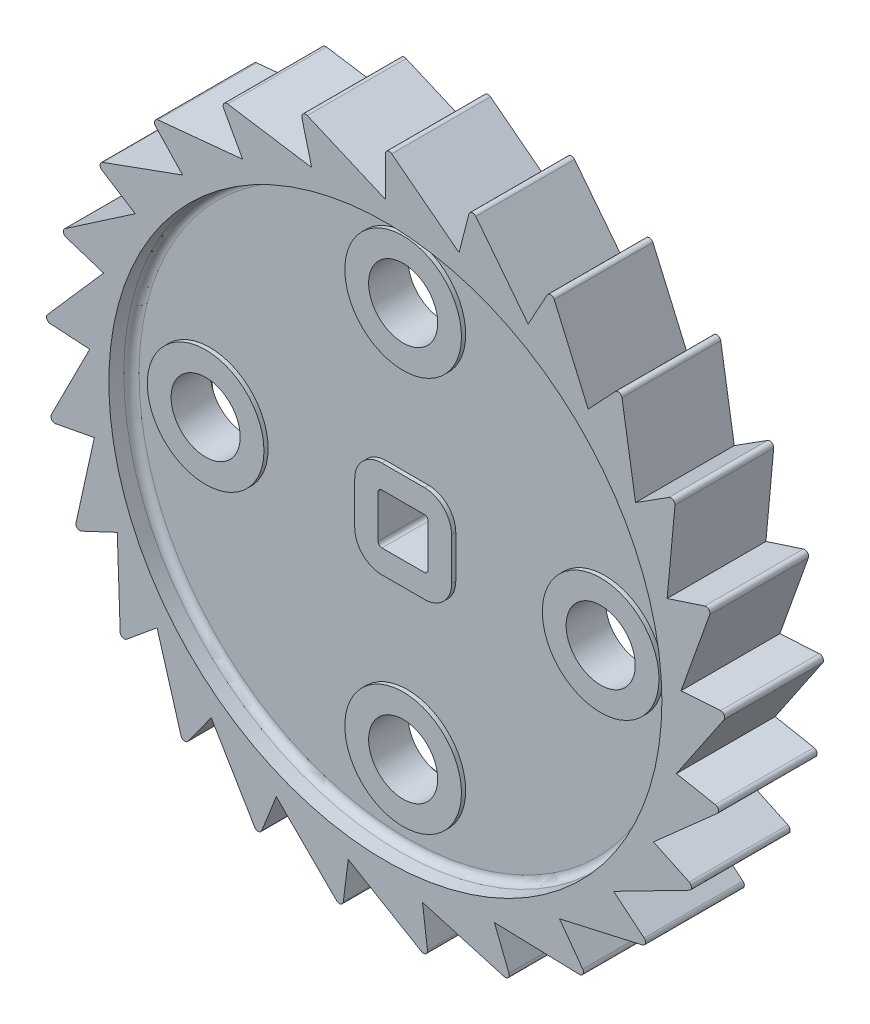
ISO-10303-21;
HEADER;
FILE_DESCRIPTION(('STEP AP214'),'2;1');
FILE_NAME('part.step','',(''),(''),'','','');
FILE_SCHEMA(('AUTOMOTIVE_DESIGN { 1 0 10303 214 1 1 1 1 }'));
ENDSEC;
DATA;
#1=APPLICATION_CONTEXT('core data for automotive mechanical design processes');
#2=APPLICATION_PROTOCOL_DEFINITION('international standard','automotive_design',2000,#1);
#3=PRODUCT_CONTEXT('',#1,'mechanical');
#4=PRODUCT('Part','Part','',(#3));
#5=PRODUCT_RELATED_PRODUCT_CATEGORY('part','',(#4));
#6=PRODUCT_DEFINITION_FORMATION('','',#4);
#7=PRODUCT_DEFINITION_CONTEXT('part definition',#1,'design');
#8=PRODUCT_DEFINITION('design','',#6,#7);
#9=PRODUCT_DEFINITION_SHAPE('','',#8);
#10=(LENGTH_UNIT() NAMED_UNIT(*) SI_UNIT(.MILLI.,.METRE.));
#11=(NAMED_UNIT(*) PLANE_ANGLE_UNIT() SI_UNIT($,.RADIAN.));
#12=(NAMED_UNIT(*) SI_UNIT($,.STERADIAN.) SOLID_ANGLE_UNIT());
#13=UNCERTAINTY_MEASURE_WITH_UNIT(LENGTH_MEASURE(1.E-05),#10,'distance_accuracy_value','');
#14=(GEOMETRIC_REPRESENTATION_CONTEXT(3) GLOBAL_UNCERTAINTY_ASSIGNED_CONTEXT((#13)) GLOBAL_UNIT_ASSIGNED_CONTEXT((#10,
#11,#12)) REPRESENTATION_CONTEXT('',''));
#15=CARTESIAN_POINT('',(0.,0.,0.));
#16=DIRECTION('',(0.,0.,1.));
#17=DIRECTION('',(1.,0.,0.));
#18=AXIS2_PLACEMENT_3D('',#15,#16,#17);
#19=CARTESIAN_POINT('',(0.,-3.81771979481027E-12,2.437));
#20=DIRECTION('',(0.,0.,-1.));
#21=DIRECTION('',(-1.,0.,0.));
#22=AXIS2_PLACEMENT_3D('',#19,#20,#21);
#23=TOROIDAL_SURFACE('',#22,17.1945933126,0.499999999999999);
#24=CARTESIAN_POINT('',(-17.1940871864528,0.131682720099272,2.937));
#25=CARTESIAN_POINT('',(-17.1820135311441,1.70783318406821,2.937));
#26=CARTESIAN_POINT('',(-16.8832436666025,3.2573599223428,2.937));
#27=CARTESIAN_POINT('',(-16.5672467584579,4.89623223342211,2.937));
#28=CARTESIAN_POINT('',(-15.9400579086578,6.44739198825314,2.937));
#29=CARTESIAN_POINT('',(-15.2886525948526,8.0584437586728,2.937));
#30=CARTESIAN_POINT('',(-14.3253985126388,9.50985051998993,2.937));
#31=CARTESIAN_POINT('',(-13.3445470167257,10.9877726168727,2.937));
#32=CARTESIAN_POINT('',(-12.0793754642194,12.2369506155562,2.937));
#33=CARTESIAN_POINT('',(-10.8178702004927,13.4825086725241,2.937));
#34=CARTESIAN_POINT('',(-9.3251963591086,14.4462779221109,2.937));
#35=CARTESIAN_POINT('',(-7.8676932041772,15.3873386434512,2.937));
#36=CARTESIAN_POINT('',(-6.24803902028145,16.0192446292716,2.937));
#37=CARTESIAN_POINT('',(-4.69728423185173,16.62426960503,2.937));
#38=CARTESIAN_POINT('',(-3.05594161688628,16.920856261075,2.937));
#39=CARTESIAN_POINT('',(-1.5091278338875,17.2003617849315,2.937));
#40=CARTESIAN_POINT('',(0.0658208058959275,17.1944702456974,2.937));
#41=CARTESIAN_POINT('',(1.63947795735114,17.1885835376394,2.937));
#42=CARTESIAN_POINT('',(3.18881807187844,16.8963183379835,2.937));
#43=CARTESIAN_POINT('',(4.82803656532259,16.5870986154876,2.937));
#44=CARTESIAN_POINT('',(6.37992844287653,15.9671736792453,2.937));
#45=CARTESIAN_POINT('',(7.99352844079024,15.3225985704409,2.937));
#46=CARTESIAN_POINT('',(9.44788166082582,14.3663370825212,2.937));
#47=CARTESIAN_POINT('',(10.9305121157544,13.3914828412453,2.937));
#48=CARTESIAN_POINT('',(12.1846544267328,12.1321180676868,2.937));
#49=CARTESIAN_POINT('',(13.4365905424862,10.8749686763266,2.937));
#50=CARTESIAN_POINT('',(14.4067066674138,9.38620679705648,2.937));
#51=CARTESIAN_POINT('',(15.3549855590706,7.93095682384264,2.937));
#52=CARTESIAN_POINT('',(15.9937481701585,6.31300872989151,2.937));
#53=CARTESIAN_POINT('',(16.6059285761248,4.76239179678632,2.937));
#54=CARTESIAN_POINT('',(16.9090313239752,3.12069031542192,2.937));
#55=CARTESIAN_POINT('',(17.1944961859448,1.57452126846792,2.937));
#56=CARTESIAN_POINT('',(17.1945933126,0.,2.937));
#57=B_SPLINE_CURVE_WITH_KNOTS('',2,(#24,#25,#26,#27,#28,#29,#30,#31,#32,#33,#34,#35,#36,#37,#38,
#39,#40,#41,#42,#43,#44,#45,#46,#47,#48,#49,#50,#51,#52,#53,#54,#55,#56),.UNSPECIFIED.,.F.,.F.,
(3,2,2,2,2,2,2,2,2,2,2,2,2,2,2,2,3),(0.,0.0625,0.125,0.1875,0.25,0.3125,0.375,0.4375,0.5,0.5625,
0.625,0.6875,0.75,0.8125,0.875,0.9375,1.),.UNSPECIFIED.);
#58=CARTESIAN_POINT('',(-17.194088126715,0.131682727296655,2.937));
#59=VERTEX_POINT('',#58);
#60=CARTESIAN_POINT('',(17.1945933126,0.,2.937));
#61=VERTEX_POINT('',#60);
#62=EDGE_CURVE('E499',#59,#61,#57,.T.);
#63=ORIENTED_EDGE('',*,*,#62,.F.);
#64=DIRECTION('',(0.0038434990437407,0.999992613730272,0.));
#65=VECTOR('',#64,1.);
#66=CARTESIAN_POINT('',(-17.1945933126,0.,2.937));
#67=LINE('',#66,#65);
#68=CARTESIAN_POINT('',(-17.1945933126,0.,2.937));
#69=VERTEX_POINT('',#68);
#70=EDGE_CURVE('E496',#69,#59,#67,.T.);
#71=ORIENTED_EDGE('',*,*,#70,.F.);
#72=CARTESIAN_POINT('',(17.1940871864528,-0.131682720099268,2.937));
#73=CARTESIAN_POINT('',(17.1820135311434,-1.70783318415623,2.937));
#74=CARTESIAN_POINT('',(16.8832436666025,-3.25735992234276,2.937));
#75=CARTESIAN_POINT('',(16.5672467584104,-4.89623223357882,2.937));
#76=CARTESIAN_POINT('',(15.9400579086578,-6.4473919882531,2.937));
#77=CARTESIAN_POINT('',(15.2886525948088,-8.05844375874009,2.937));
#78=CARTESIAN_POINT('',(14.3253985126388,-9.5098505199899,2.937));
#79=CARTESIAN_POINT('',(13.3445470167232,-10.9877726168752,2.937));
#80=CARTESIAN_POINT('',(12.0793754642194,-12.2369506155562,2.937));
#81=CARTESIAN_POINT('',(10.8178702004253,-13.4825086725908,2.937));
#82=CARTESIAN_POINT('',(9.32519635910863,-14.4462779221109,2.937));
#83=CARTESIAN_POINT('',(7.86769320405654,-15.3873386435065,2.937));
#84=CARTESIAN_POINT('',(6.24803902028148,-16.0192446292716,2.937));
#85=CARTESIAN_POINT('',(4.69728423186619,-16.6242696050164,2.937));
#86=CARTESIAN_POINT('',(3.0559416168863,-16.920856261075,2.937));
#87=CARTESIAN_POINT('',(1.50912783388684,-17.2003617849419,2.937));
#88=CARTESIAN_POINT('',(-0.0658208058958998,-17.1944702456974,2.937));
#89=CARTESIAN_POINT('',(-1.63947795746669,-17.1885835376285,2.937));
#90=CARTESIAN_POINT('',(-3.18881807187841,-16.8963183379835,2.937));
#91=CARTESIAN_POINT('',(-4.8280365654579,-16.5870986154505,2.937));
#92=CARTESIAN_POINT('',(-6.3799284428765,-15.9671736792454,2.937));
#93=CARTESIAN_POINT('',(-7.99352844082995,-15.3225985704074,2.937));
#94=CARTESIAN_POINT('',(-9.4478816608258,-14.3663370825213,2.937));
#95=CARTESIAN_POINT('',(-10.9305121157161,-13.3914828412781,2.937));
#96=CARTESIAN_POINT('',(-12.1846544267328,-12.1321180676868,2.937));
#97=CARTESIAN_POINT('',(-13.4365905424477,-10.874968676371,2.937));
#98=CARTESIAN_POINT('',(-14.4067066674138,-9.3862067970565,2.937));
#99=CARTESIAN_POINT('',(-15.3549855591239,-7.93095682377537,2.937));
#100=CARTESIAN_POINT('',(-15.9937481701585,-6.31300872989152,2.937));
#101=CARTESIAN_POINT('',(-16.6059285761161,-4.76239179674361,2.937));
#102=CARTESIAN_POINT('',(-16.9090313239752,-3.12069031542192,2.937));
#103=CARTESIAN_POINT('',(-17.1944961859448,-1.57452126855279,2.937));
#104=CARTESIAN_POINT('',(-17.1945933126,0.,2.937));
#105=B_SPLINE_CURVE_WITH_KNOTS('',2,(#72,#73,#74,#75,#76,#77,#78,#79,#80,#81,#82,#83,#84,#85,
#86,#87,#88,#89,#90,#91,#92,#93,#94,#95,#96,#97,#98,#99,#100,#101,#102,#103,#104),.UNSPECIFIED.,
.F.,.F.,(3,2,2,2,2,2,2,2,2,2,2,2,2,2,2,2,3),(0.,0.0625,0.125,0.1875,0.25,0.3125,0.375,0.4375,
0.5,0.5625,0.625,0.6875,0.75,0.8125,0.875,0.9375,1.),.UNSPECIFIED.);
#106=CARTESIAN_POINT('',(17.194088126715,-0.131682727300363,2.937));
#107=VERTEX_POINT('',#106);
#108=EDGE_CURVE('E522',#107,#69,#105,.T.);
#109=ORIENTED_EDGE('',*,*,#108,.F.);
#110=DIRECTION('',(-0.00384349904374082,-0.999992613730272,0.));
#111=VECTOR('',#110,1.);
#112=CARTESIAN_POINT('',(17.1945933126,0.,2.937));
#113=LINE('',#112,#111);
#114=EDGE_CURVE('E528',#61,#107,#113,.T.);
#115=ORIENTED_EDGE('',*,*,#114,.F.);
#116=EDGE_LOOP('',(#63,#71,#109,#115));
#117=FACE_BOUND('',#116,.T.);
#118=CARTESIAN_POINT('',(0.,0.,2.45444974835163));
#119=DIRECTION('',(0.,0.,-1.));
#120=DIRECTION('',(-1.,0.,0.));
#121=AXIS2_PLACEMENT_3D('',#118,#119,#120);
#122=CIRCLE('',#121,17.6942887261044);
#123=CARTESIAN_POINT('',(-17.6942887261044,0.,2.4544497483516));
#124=VERTEX_POINT('',#123);
#125=EDGE_CURVE('E527',#124,#124,#122,.T.);
#126=ORIENTED_EDGE('',*,*,#125,.T.);
#127=EDGE_LOOP('',(#126));
#128=FACE_BOUND('',#127,.T.);
#129=ADVANCED_FACE('F16',(#117,#128),#23,.F.);
#130=CARTESIAN_POINT('',(0.,0.,2.437));
#131=DIRECTION('',(0.,0.,1.));
#132=DIRECTION('',(1.,0.,0.));
#133=AXIS2_PLACEMENT_3D('',#130,#131,#132);
#134=TOROIDAL_SURFACE('',#133,4.46875,0.5);
#135=CARTESIAN_POINT('',(4.46617952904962,0.152861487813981,2.937));
#136=CARTESIAN_POINT('',(4.4379042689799,0.996894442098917,2.937));
#137=CARTESIAN_POINT('',(4.10055859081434,1.77633807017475,2.937));
#138=CARTESIAN_POINT('',(3.92267744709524,2.18733584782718,2.937));
#139=CARTESIAN_POINT('',(3.66482011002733,2.55715630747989,2.937));
#140=CARTESIAN_POINT('',(3.40402726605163,2.93118688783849,2.937));
#141=CARTESIAN_POINT('',(3.0706101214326,3.24673509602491,2.937));
#142=CARTESIAN_POINT('',(2.74030382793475,3.55933917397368,2.937));
#143=CARTESIAN_POINT('',(2.35102835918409,3.80033805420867,2.937));
#144=CARTESIAN_POINT('',(1.97494374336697,4.03317053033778,2.937));
#145=CARTESIAN_POINT('',(1.55570109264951,4.18925893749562,2.937));
#146=CARTESIAN_POINT('',(0.769455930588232,4.48198620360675,2.937));
#147=CARTESIAN_POINT('',(-0.0764868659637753,4.46812434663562,2.937));
#148=CARTESIAN_POINT('',(-0.918430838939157,4.4543280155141,2.937));
#149=CARTESIAN_POINT('',(-1.70149316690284,4.13215819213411,2.937));
#150=CARTESIAN_POINT('',(-2.11498056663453,3.96203998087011,2.937));
#151=CARTESIAN_POINT('',(-2.4886480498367,3.71166126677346,2.937));
#152=CARTESIAN_POINT('',(-2.86760665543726,3.45773719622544,2.937));
#153=CARTESIAN_POINT('',(-3.18913042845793,3.13037207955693,2.937));
#154=CARTESIAN_POINT('',(-3.5085716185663,2.80512738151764,2.937));
#155=CARTESIAN_POINT('',(-3.75693586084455,2.41975157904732,2.937));
#156=CARTESIAN_POINT('',(-3.99844045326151,2.04501959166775,2.937));
#157=CARTESIAN_POINT('',(-4.16200119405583,1.62711526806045,2.937));
#158=CARTESIAN_POINT('',(-4.46854969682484,0.84387141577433,2.937));
#159=CARTESIAN_POINT('',(-4.46875,0.,2.937));
#160=B_SPLINE_CURVE_WITH_KNOTS('',2,(#135,#136,#137,#138,#139,#140,#141,#142,#143,#144,#145,
#146,#147,#148,#149,#150,#151,#152,#153,#154,#155,#156,#157,#158,#159),.UNSPECIFIED.,.F.,.F.,(3,
2,2,2,2,2,2,2,2,2,2,2,3),(0.,0.125,0.1875,0.25,0.3125,0.375,0.5,0.625,0.6875,0.75,0.8125,0.875,
1.),.UNSPECIFIED.);
#161=CARTESIAN_POINT('',(4.46617952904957,0.15286148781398,2.93699999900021));
#162=VERTEX_POINT('',#161);
#163=CARTESIAN_POINT('',(-4.46875,0.,2.937));
#164=VERTEX_POINT('',#163);
#165=EDGE_CURVE('E487',#162,#164,#160,.T.);
#166=ORIENTED_EDGE('',*,*,#165,.F.);
#167=DIRECTION('',(-0.0168133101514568,0.999858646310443,0.));
#168=VECTOR('',#167,1.);
#169=CARTESIAN_POINT('',(4.46875,0.,2.937));
#170=LINE('',#169,#168);
#171=CARTESIAN_POINT('',(4.46875,0.,2.937));
#172=VERTEX_POINT('',#171);
#173=EDGE_CURVE('E20',#172,#162,#170,.T.);
#174=ORIENTED_EDGE('',*,*,#173,.F.);
#175=CARTESIAN_POINT('',(-4.46615751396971,-0.15285097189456,2.937));
#176=CARTESIAN_POINT('',(-4.43795541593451,-0.99677191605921,2.937));
#177=CARTESIAN_POINT('',(-4.10056220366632,-1.77632972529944,2.937));
#178=CARTESIAN_POINT('',(-3.9226818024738,-2.18732808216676,2.937));
#179=CARTESIAN_POINT('',(-3.66482504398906,-2.5571492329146,2.937));
#180=CARTESIAN_POINT('',(-3.40403272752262,-2.93118059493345,2.937));
#181=CARTESIAN_POINT('',(-3.07061590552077,-3.24672962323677,2.937));
#182=CARTESIAN_POINT('',(-2.74030986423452,-3.55933457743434,2.937));
#183=CARTESIAN_POINT('',(-2.35103443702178,-3.80033429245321,2.937));
#184=CARTESIAN_POINT('',(-1.97494969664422,-4.03316767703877,2.937));
#185=CARTESIAN_POINT('',(-1.5557068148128,-4.18925680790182,2.937));
#186=CARTESIAN_POINT('',(-0.769461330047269,-4.48198539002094,2.937));
#187=CARTESIAN_POINT('',(0.0764819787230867,-4.46812442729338,2.937));
#188=CARTESIAN_POINT('',(0.918426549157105,-4.45432898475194,2.937));
#189=CARTESIAN_POINT('',(1.70148955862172,-4.13215967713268,2.937));
#190=CARTESIAN_POINT('',(2.11497739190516,-3.96204170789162,2.937));
#191=CARTESIAN_POINT('',(2.48864529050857,-3.71166311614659,2.937));
#192=CARTESIAN_POINT('',(2.8676043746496,-3.45773913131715,2.937));
#193=CARTESIAN_POINT('',(3.18912856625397,-3.13037397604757,2.937));
#194=CARTESIAN_POINT('',(3.50857020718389,-2.80512920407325,2.937));
#195=CARTESIAN_POINT('',(3.75693480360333,-2.41975321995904,2.937));
#196=CARTESIAN_POINT('',(3.99843977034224,-2.04502100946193,2.937));
#197=CARTESIAN_POINT('',(4.16200074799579,-1.62711640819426,2.937));
#198=CARTESIAN_POINT('',(4.46854969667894,-0.843872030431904,2.937));
#199=CARTESIAN_POINT('',(4.46875,0.,2.937));
#200=B_SPLINE_CURVE_WITH_KNOTS('',2,(#175,#176,#177,#178,#179,#180,#181,#182,#183,#184,#185,
#186,#187,#188,#189,#190,#191,#192,#193,#194,#195,#196,#197,#198,#199),.UNSPECIFIED.,.F.,.F.,(3,
2,2,2,2,2,2,2,2,2,2,2,3),(0.,0.125,0.1875,0.25,0.3125,0.375,0.5,0.625,0.6875,0.75,0.8125,0.875,
1.),.UNSPECIFIED.);
#201=CARTESIAN_POINT('',(-4.4661575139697,-0.15285097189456,2.93699999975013));
#202=VERTEX_POINT('',#201);
#203=EDGE_CURVE('E495',#202,#172,#200,.T.);
#204=ORIENTED_EDGE('',*,*,#203,.F.);
#205=DIRECTION('',(0.0169584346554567,-0.999856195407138,0.));
#206=VECTOR('',#205,1.);
#207=CARTESIAN_POINT('',(-4.46875,0.,2.937));
#208=LINE('',#207,#206);
#209=EDGE_CURVE('E491',#164,#202,#208,.T.);
#210=ORIENTED_EDGE('',*,*,#209,.F.);
#211=EDGE_LOOP('',(#166,#174,#204,#210));
#212=FACE_BOUND('',#211,.T.);
#213=CARTESIAN_POINT('',(0.,0.,2.437));
#214=DIRECTION('',(0.,0.,1.));
#215=DIRECTION('',(1.,0.,0.));
#216=AXIS2_PLACEMENT_3D('',#213,#214,#215);
#217=CIRCLE('',#216,3.96875);
#218=CARTESIAN_POINT('',(3.96875,0.,2.437));
#219=VERTEX_POINT('',#218);
#220=EDGE_CURVE('E529',#219,#219,#217,.F.);
#221=ORIENTED_EDGE('',*,*,#220,.F.);
#222=EDGE_LOOP('',(#221));
#223=FACE_BOUND('',#222,.T.);
#224=ADVANCED_FACE('F488',(#212,#223),#134,.F.);
#225=CARTESIAN_POINT('',(0.,0.,2.937));
#226=DIRECTION('',(0.,0.,-1.));
#227=DIRECTION('',(-1.,0.,0.));
#228=AXIS2_PLACEMENT_3D('',#225,#226,#227);
#229=PLANE('',#228);
#230=ORIENTED_EDGE('',*,*,#114,.T.);
#231=ORIENTED_EDGE('',*,*,#108,.T.);
#232=ORIENTED_EDGE('',*,*,#70,.T.);
#233=ORIENTED_EDGE('',*,*,#62,.T.);
#234=EDGE_LOOP('',(#230,#231,#232,#233));
#235=FACE_BOUND('',#234,.T.);
#236=CARTESIAN_POINT('',(0.,12.7,2.937));
#237=DIRECTION('',(0.,0.,-1.));
#238=DIRECTION('',(-1.,0.,0.));
#239=AXIS2_PLACEMENT_3D('',#236,#237,#238);
#240=CIRCLE('',#239,3.75);
#241=CARTESIAN_POINT('',(-3.75,12.7,2.937));
#242=VERTEX_POINT('',#241);
#243=EDGE_CURVE('E804',#242,#242,#240,.T.);
#244=ORIENTED_EDGE('',*,*,#243,.F.);
#245=EDGE_LOOP('',(#244));
#246=FACE_BOUND('',#245,.T.);
#247=CARTESIAN_POINT('',(-12.7,0.,2.937));
#248=DIRECTION('',(0.,0.,-1.));
#249=DIRECTION('',(-1.,0.,0.));
#250=AXIS2_PLACEMENT_3D('',#247,#248,#249);
#251=CIRCLE('',#250,3.75);
#252=CARTESIAN_POINT('',(-16.45,0.,2.937));
#253=VERTEX_POINT('',#252);
#254=EDGE_CURVE('E537',#253,#253,#251,.T.);
#255=ORIENTED_EDGE('',*,*,#254,.F.);
#256=EDGE_LOOP('',(#255));
#257=FACE_BOUND('',#256,.T.);
#258=CARTESIAN_POINT('',(0.,-12.7,2.937));
#259=DIRECTION('',(0.,0.,-1.));
#260=DIRECTION('',(-1.,0.,0.));
#261=AXIS2_PLACEMENT_3D('',#258,#259,#260);
#262=CIRCLE('',#261,3.75);
#263=CARTESIAN_POINT('',(-3.75,-12.7,2.937));
#264=VERTEX_POINT('',#263);
#265=EDGE_CURVE('E810',#264,#264,#262,.T.);
#266=ORIENTED_EDGE('',*,*,#265,.F.);
#267=EDGE_LOOP('',(#266));
#268=FACE_BOUND('',#267,.T.);
#269=CARTESIAN_POINT('',(12.7,0.,2.937));
#270=DIRECTION('',(0.,0.,-1.));
#271=DIRECTION('',(-1.,0.,0.));
#272=AXIS2_PLACEMENT_3D('',#269,#270,#271);
#273=CIRCLE('',#272,3.75);
#274=CARTESIAN_POINT('',(8.95,0.,2.937));
#275=VERTEX_POINT('',#274);
#276=EDGE_CURVE('E807',#275,#275,#273,.T.);
#277=ORIENTED_EDGE('',*,*,#276,.F.);
#278=EDGE_LOOP('',(#277));
#279=FACE_BOUND('',#278,.T.);
#280=ORIENTED_EDGE('',*,*,#209,.T.);
#281=ORIENTED_EDGE('',*,*,#203,.T.);
#282=ORIENTED_EDGE('',*,*,#173,.T.);
#283=ORIENTED_EDGE('',*,*,#165,.T.);
#284=EDGE_LOOP('',(#280,#281,#282,#283));
#285=FACE_BOUND('',#284,.T.);
#286=ADVANCED_FACE('F494',(#235,#246,#257,#268,#279,#285),#229,.T.);
#287=CARTESIAN_POINT('',(0.,0.,-1.04000338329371E-13));
#288=DIRECTION('',(0.,0.,-1.));
#289=DIRECTION('',(0.,1.,0.));
#290=AXIS2_PLACEMENT_3D('',#287,#288,#289);
#291=CONICAL_SURFACE('',#290,17.7799999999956,0.0349065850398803);
#292=ORIENTED_EDGE('',*,*,#125,.F.);
#293=EDGE_LOOP('',(#292));
#294=FACE_BOUND('',#293,.T.);
#295=CARTESIAN_POINT('',(0.,0.,-1.11022302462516E-13));
#296=DIRECTION('',(0.,0.,-1.));
#297=DIRECTION('',(0.,1.,0.));
#298=AXIS2_PLACEMENT_3D('',#295,#296,#297);
#299=CIRCLE('',#298,17.7799999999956);
#300=CARTESIAN_POINT('',(0.,17.7799999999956,-1.11022302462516E-13));
#301=VERTEX_POINT('',#300);
#302=EDGE_CURVE('E753',#301,#301,#299,.F.);
#303=ORIENTED_EDGE('',*,*,#302,.F.);
#304=EDGE_LOOP('',(#303));
#305=FACE_BOUND('',#304,.T.);
#306=ADVANCED_FACE('F517',(#294,#305),#291,.F.);
#307=CARTESIAN_POINT('',(0.,0.,-1.778));
#308=DIRECTION('',(0.,0.,1.));
#309=DIRECTION('',(1.,0.,0.));
#310=AXIS2_PLACEMENT_3D('',#307,#308,#309);
#311=CYLINDRICAL_SURFACE('',#310,3.96875);
#312=ORIENTED_EDGE('',*,*,#220,.T.);
#313=EDGE_LOOP('',(#312));
#314=FACE_BOUND('',#313,.T.);
#315=CARTESIAN_POINT('',(0.,0.,-1.778));
#316=DIRECTION('',(0.,0.,1.));
#317=DIRECTION('',(1.,0.,0.));
#318=AXIS2_PLACEMENT_3D('',#315,#316,#317);
#319=CIRCLE('',#318,3.96875);
#320=CARTESIAN_POINT('',(3.96875,0.,-1.778));
#321=VERTEX_POINT('',#320);
#322=EDGE_CURVE('E653',#321,#321,#319,.F.);
#323=ORIENTED_EDGE('',*,*,#322,.F.);
#324=EDGE_LOOP('',(#323));
#325=FACE_BOUND('',#324,.T.);
#326=ADVANCED_FACE('F825',(#314,#325),#311,.T.);
#327=CARTESIAN_POINT('',(-12.7,0.,2.667));
#328=DIRECTION('',(0.,0.,-1.));
#329=DIRECTION('',(-1.,0.,0.));
#330=AXIS2_PLACEMENT_3D('',#327,#328,#329);
#331=CYLINDRICAL_SURFACE('',#330,3.75);
#332=ORIENTED_EDGE('',*,*,#254,.T.);
#333=EDGE_LOOP('',(#332));
#334=FACE_BOUND('',#333,.T.);
#335=CARTESIAN_POINT('',(-12.7,0.,2.667));
#336=DIRECTION('',(0.,0.,-1.));
#337=DIRECTION('',(-1.,0.,0.));
#338=AXIS2_PLACEMENT_3D('',#335,#336,#337);
#339=CIRCLE('',#338,3.75);
#340=CARTESIAN_POINT('',(-16.45,0.,2.667));
#341=VERTEX_POINT('',#340);
#342=EDGE_CURVE('E650',#341,#341,#339,.T.);
#343=ORIENTED_EDGE('',*,*,#342,.F.);
#344=EDGE_LOOP('',(#343));
#345=FACE_BOUND('',#344,.T.);
#346=ADVANCED_FACE('F2097',(#334,#345),#331,.T.);
#347=CARTESIAN_POINT('',(0.,-12.7,2.667));
#348=DIRECTION('',(0.,0.,-1.));
#349=DIRECTION('',(-1.,0.,0.));
#350=AXIS2_PLACEMENT_3D('',#347,#348,#349);
#351=CYLINDRICAL_SURFACE('',#350,3.75);
#352=ORIENTED_EDGE('',*,*,#265,.T.);
#353=EDGE_LOOP('',(#352));
#354=FACE_BOUND('',#353,.T.);
#355=CARTESIAN_POINT('',(0.,-12.7,2.667));
#356=DIRECTION('',(0.,0.,-1.));
#357=DIRECTION('',(-1.,0.,0.));
#358=AXIS2_PLACEMENT_3D('',#355,#356,#357);
#359=CIRCLE('',#358,3.75);
#360=CARTESIAN_POINT('',(-3.75,-12.7,2.667));
#361=VERTEX_POINT('',#360);
#362=EDGE_CURVE('E647',#361,#361,#359,.T.);
#363=ORIENTED_EDGE('',*,*,#362,.F.);
#364=EDGE_LOOP('',(#363));
#365=FACE_BOUND('',#364,.T.);
#366=ADVANCED_FACE('F2093',(#354,#365),#351,.T.);
#367=CARTESIAN_POINT('',(12.7,0.,2.667));
#368=DIRECTION('',(0.,0.,-1.));
#369=DIRECTION('',(-1.,0.,0.));
#370=AXIS2_PLACEMENT_3D('',#367,#368,#369);
#371=CYLINDRICAL_SURFACE('',#370,3.75);
#372=ORIENTED_EDGE('',*,*,#276,.T.);
#373=EDGE_LOOP('',(#372));
#374=FACE_BOUND('',#373,.T.);
#375=CARTESIAN_POINT('',(12.7,0.,2.667));
#376=DIRECTION('',(0.,0.,-1.));
#377=DIRECTION('',(-1.,0.,0.));
#378=AXIS2_PLACEMENT_3D('',#375,#376,#377);
#379=CIRCLE('',#378,3.75);
#380=CARTESIAN_POINT('',(8.95,0.,2.667));
#381=VERTEX_POINT('',#380);
#382=EDGE_CURVE('E644',#381,#381,#379,.T.);
#383=ORIENTED_EDGE('',*,*,#382,.F.);
#384=EDGE_LOOP('',(#383));
#385=FACE_BOUND('',#384,.T.);
#386=ADVANCED_FACE('F2089',(#374,#385),#371,.T.);
#387=CARTESIAN_POINT('',(0.,12.7,2.667));
#388=DIRECTION('',(0.,0.,-1.));
#389=DIRECTION('',(-1.,0.,0.));
#390=AXIS2_PLACEMENT_3D('',#387,#388,#389);
#391=CYLINDRICAL_SURFACE('',#390,3.75);
#392=ORIENTED_EDGE('',*,*,#243,.T.);
#393=EDGE_LOOP('',(#392));
#394=FACE_BOUND('',#393,.T.);
#395=CARTESIAN_POINT('',(0.,12.7,2.667));
#396=DIRECTION('',(0.,0.,-1.));
#397=DIRECTION('',(-1.,0.,0.));
#398=AXIS2_PLACEMENT_3D('',#395,#396,#397);
#399=CIRCLE('',#398,3.75);
#400=CARTESIAN_POINT('',(-3.75,12.7,2.667));
#401=VERTEX_POINT('',#400);
#402=EDGE_CURVE('E640',#401,#401,#399,.T.);
#403=ORIENTED_EDGE('',*,*,#402,.F.);
#404=EDGE_LOOP('',(#403));
#405=FACE_BOUND('',#404,.T.);
#406=ADVANCED_FACE('F2083',(#394,#405),#391,.T.);
#407=CARTESIAN_POINT('',(0.2540005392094,21.58999994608,6.35));
#408=DIRECTION('',(0.,0.,-1.));
#409=DIRECTION('',(-1.,0.,0.));
#410=AXIS2_PLACEMENT_3D('',#407,#408,#409);
#411=CYLINDRICAL_SURFACE('',#410,0.254);
#412=DIRECTION('',(0.,0.,1.));
#413=VECTOR('',#412,1.);
#414=CARTESIAN_POINT('',(5.3920929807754E-07,21.5899992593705,6.35));
#415=LINE('',#414,#413);
#416=CARTESIAN_POINT('',(5.39209376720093E-07,21.5899996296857,0.));
#417=VERTEX_POINT('',#416);
#418=CARTESIAN_POINT('',(3.14538491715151E-07,21.5899996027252,6.35));
#419=VERTEX_POINT('',#418);
#420=EDGE_CURVE('E635',#417,#419,#415,.T.);
#421=ORIENTED_EDGE('',*,*,#420,.T.);
#422=CARTESIAN_POINT('',(0.2540005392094,21.58999994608,6.35));
#423=DIRECTION('',(0.,0.,-1.));
#424=DIRECTION('',(-1.,0.,0.));
#425=AXIS2_PLACEMENT_3D('',#422,#423,#424);
#426=CIRCLE('',#425,0.254);
#427=CARTESIAN_POINT('',(0.40916083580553,21.7911001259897,6.35));
#428=VERTEX_POINT('',#427);
#429=EDGE_CURVE('E802',#419,#428,#426,.T.);
#430=ORIENTED_EDGE('',*,*,#429,.T.);
#431=DIRECTION('',(0.,0.,1.));
#432=VECTOR('',#431,1.);
#433=CARTESIAN_POINT('',(0.409160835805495,21.7911001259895,6.35));
#434=LINE('',#433,#432);
#435=CARTESIAN_POINT('',(0.409160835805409,21.7911001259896,0.));
#436=VERTEX_POINT('',#435);
#437=EDGE_CURVE('E638',#428,#436,#434,.F.);
#438=ORIENTED_EDGE('',*,*,#437,.T.);
#439=CARTESIAN_POINT('',(0.2540005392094,21.58999994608,0.));
#440=DIRECTION('',(0.,0.,-1.));
#441=DIRECTION('',(-1.,0.,0.));
#442=AXIS2_PLACEMENT_3D('',#439,#440,#441);
#443=CIRCLE('',#442,0.254);
#444=EDGE_CURVE('E750',#417,#436,#443,.T.);
#445=ORIENTED_EDGE('',*,*,#444,.F.);
#446=EDGE_LOOP('',(#421,#430,#438,#445));
#447=FACE_BOUND('',#446,.T.);
#448=ADVANCED_FACE('F1734',(#447),#411,.T.);
#449=CARTESIAN_POINT('',(5.615231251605,20.8485430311,6.35));
#450=DIRECTION('',(0.,0.,-1.));
#451=DIRECTION('',(-1.,0.,0.));
#452=AXIS2_PLACEMENT_3D('',#449,#450,#451);
#453=CYLINDRICAL_SURFACE('',#452,0.254);
#454=DIRECTION('',(0.,0.,1.));
#455=VECTOR('',#454,1.);
#456=CARTESIAN_POINT('',(5.36921114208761,20.9117103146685,6.35));
#457=LINE('',#456,#455);
#458=CARTESIAN_POINT('',(5.36921114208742,20.9117103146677,0.));
#459=VERTEX_POINT('',#458);
#460=CARTESIAN_POINT('',(5.36921114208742,20.9117103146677,6.35));
#461=VERTEX_POINT('',#460);
#462=EDGE_CURVE('E1498',#459,#461,#457,.T.);
#463=ORIENTED_EDGE('',*,*,#462,.T.);
#464=CARTESIAN_POINT('',(5.615231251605,20.8485430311,6.35));
#465=DIRECTION('',(0.,0.,-1.));
#466=DIRECTION('',(-1.,0.,0.));
#467=AXIS2_PLACEMENT_3D('',#464,#465,#466);
#468=CIRCLE('',#467,0.254);
#469=CARTESIAN_POINT('',(5.81552848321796,21.0047384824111,6.35));
#470=VERTEX_POINT('',#469);
#471=EDGE_CURVE('E800',#461,#470,#468,.T.);
#472=ORIENTED_EDGE('',*,*,#471,.T.);
#473=DIRECTION('',(0.,0.,1.));
#474=VECTOR('',#473,1.);
#475=CARTESIAN_POINT('',(5.81552848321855,21.004738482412,6.35));
#476=LINE('',#475,#474);
#477=CARTESIAN_POINT('',(5.81552848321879,21.0047384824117,0.));
#478=VERTEX_POINT('',#477);
#479=EDGE_CURVE('E1496',#470,#478,#476,.F.);
#480=ORIENTED_EDGE('',*,*,#479,.T.);
#481=CARTESIAN_POINT('',(5.615231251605,20.8485430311,0.));
#482=DIRECTION('',(0.,0.,-1.));
#483=DIRECTION('',(-1.,0.,0.));
#484=AXIS2_PLACEMENT_3D('',#481,#482,#483);
#485=CIRCLE('',#484,0.254);
#486=EDGE_CURVE('E747',#459,#478,#485,.T.);
#487=ORIENTED_EDGE('',*,*,#486,.F.);
#488=EDGE_LOOP('',(#463,#472,#480,#487));
#489=FACE_BOUND('',#488,.T.);
#490=ADVANCED_FACE('F2073',(#489),#453,.T.);
#491=CARTESIAN_POINT('',(10.62363620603,18.79709648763,6.35));
#492=DIRECTION('',(0.,0.,-1.));
#493=DIRECTION('',(-1.,0.,0.));
#494=AXIS2_PLACEMENT_3D('',#491,#492,#493);
#495=CYLINDRICAL_SURFACE('',#494,0.254000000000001);
#496=DIRECTION('',(0.,0.,1.));
#497=VECTOR('',#496,1.);
#498=CARTESIAN_POINT('',(10.4010543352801,18.9194619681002,6.35));
#499=LINE('',#498,#497);
#500=CARTESIAN_POINT('',(10.4010543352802,18.9194619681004,0.));
#501=VERTEX_POINT('',#500);
#502=CARTESIAN_POINT('',(10.4010543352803,18.9194619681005,6.35));
#503=VERTEX_POINT('',#502);
#504=EDGE_CURVE('E1486',#501,#503,#499,.T.);
#505=ORIENTED_EDGE('',*,*,#504,.T.);
#506=CARTESIAN_POINT('',(10.62363620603,18.79709648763,6.35));
#507=DIRECTION('',(0.,0.,-1.));
#508=DIRECTION('',(-1.,0.,0.));
#509=AXIS2_PLACEMENT_3D('',#506,#507,#508);
#510=CIRCLE('',#509,0.254000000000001);
#511=CARTESIAN_POINT('',(10.856484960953,18.8985728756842,6.35));
#512=VERTEX_POINT('',#511);
#513=EDGE_CURVE('E798',#503,#512,#510,.T.);
#514=ORIENTED_EDGE('',*,*,#513,.T.);
#515=DIRECTION('',(0.,0.,1.));
#516=VECTOR('',#515,1.);
#517=CARTESIAN_POINT('',(10.8564849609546,18.898572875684,6.35));
#518=LINE('',#517,#516);
#519=CARTESIAN_POINT('',(10.8564849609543,18.8985728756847,0.));
#520=VERTEX_POINT('',#519);
#521=EDGE_CURVE('E1484',#512,#520,#518,.F.);
#522=ORIENTED_EDGE('',*,*,#521,.T.);
#523=CARTESIAN_POINT('',(10.62363620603,18.79709648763,0.));
#524=DIRECTION('',(0.,0.,-1.));
#525=DIRECTION('',(-1.,0.,0.));
#526=AXIS2_PLACEMENT_3D('',#523,#524,#525);
#527=CIRCLE('',#526,0.254000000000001);
#528=EDGE_CURVE('E744',#501,#520,#527,.T.);
#529=ORIENTED_EDGE('',*,*,#528,.F.);
#530=EDGE_LOOP('',(#505,#514,#522,#529));
#531=FACE_BOUND('',#530,.T.);
#532=ADVANCED_FACE('F2075',(#531),#495,.T.);
#533=CARTESIAN_POINT('',(14.96451889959,15.56456024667,6.35));
#534=DIRECTION('',(0.,0.,-1.));
#535=DIRECTION('',(-1.,0.,0.));
#536=AXIS2_PLACEMENT_3D('',#533,#534,#535);
#537=CYLINDRICAL_SURFACE('',#536,0.254000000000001);
#538=DIRECTION('',(0.,0.,1.));
#539=VECTOR('',#538,1.);
#540=CARTESIAN_POINT('',(14.7793609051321,15.7384352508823,6.35));
#541=LINE('',#540,#539);
#542=CARTESIAN_POINT('',(14.7793609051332,15.7384352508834,0.));
#543=VERTEX_POINT('',#542);
#544=CARTESIAN_POINT('',(14.7793609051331,15.7384352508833,6.35));
#545=VERTEX_POINT('',#544);
#546=EDGE_CURVE('E1474',#543,#545,#541,.T.);
#547=ORIENTED_EDGE('',*,*,#546,.T.);
#548=CARTESIAN_POINT('',(14.96451889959,15.56456024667,6.35));
#549=DIRECTION('',(0.,0.,-1.));
#550=DIRECTION('',(-1.,0.,0.));
#551=AXIS2_PLACEMENT_3D('',#548,#549,#550);
#552=CIRCLE('',#551,0.254000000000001);
#553=CARTESIAN_POINT('',(15.215288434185,15.6049414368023,6.35));
#554=VERTEX_POINT('',#553);
#555=EDGE_CURVE('E796',#545,#554,#552,.T.);
#556=ORIENTED_EDGE('',*,*,#555,.T.);
#557=DIRECTION('',(0.,0.,1.));
#558=VECTOR('',#557,1.);
#559=CARTESIAN_POINT('',(15.2152884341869,15.6049414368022,6.35));
#560=LINE('',#559,#558);
#561=CARTESIAN_POINT('',(15.2152884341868,15.6049414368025,0.));
#562=VERTEX_POINT('',#561);
#563=EDGE_CURVE('E1472',#554,#562,#560,.F.);
#564=ORIENTED_EDGE('',*,*,#563,.T.);
#565=CARTESIAN_POINT('',(14.96451889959,15.56456024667,0.));
#566=DIRECTION('',(0.,0.,-1.));
#567=DIRECTION('',(-1.,0.,0.));
#568=AXIS2_PLACEMENT_3D('',#565,#566,#567);
#569=CIRCLE('',#568,0.254000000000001);
#570=EDGE_CURVE('E741',#543,#562,#569,.T.);
#571=ORIENTED_EDGE('',*,*,#570,.F.);
#572=EDGE_LOOP('',(#547,#556,#564,#571));
#573=FACE_BOUND('',#572,.T.);
#574=ADVANCED_FACE('F2081',(#573),#537,.T.);
#575=CARTESIAN_POINT('',(18.36512570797,11.35404644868,6.35));
#576=DIRECTION('',(0.,0.,-1.));
#577=DIRECTION('',(-1.,0.,0.));
#578=AXIS2_PLACEMENT_3D('',#575,#576,#577);
#579=CYLINDRICAL_SURFACE('',#578,0.254000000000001);
#580=DIRECTION('',(0.,0.,1.));
#581=VECTOR('',#580,1.);
#582=CARTESIAN_POINT('',(18.2290257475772,11.5685057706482,6.35));
#583=LINE('',#582,#581);
#584=CARTESIAN_POINT('',(18.2290257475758,11.5685057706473,0.));
#585=VERTEX_POINT('',#584);
#586=CARTESIAN_POINT('',(18.2290257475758,11.5685057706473,6.35));
#587=VERTEX_POINT('',#586);
#588=EDGE_CURVE('E1462',#585,#587,#583,.T.);
#589=ORIENTED_EDGE('',*,*,#588,.T.);
#590=CARTESIAN_POINT('',(18.36512570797,11.35404644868,6.35));
#591=DIRECTION('',(0.,0.,-1.));
#592=DIRECTION('',(-1.,0.,0.));
#593=AXIS2_PLACEMENT_3D('',#590,#591,#592);
#594=CIRCLE('',#593,0.254000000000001);
#595=CARTESIAN_POINT('',(18.618059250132,11.3307951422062,6.35));
#596=VERTEX_POINT('',#595);
#597=EDGE_CURVE('E794',#587,#596,#594,.T.);
#598=ORIENTED_EDGE('',*,*,#597,.T.);
#599=DIRECTION('',(0.,0.,1.));
#600=VECTOR('',#599,1.);
#601=CARTESIAN_POINT('',(18.6180592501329,11.3307951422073,6.35));
#602=LINE('',#601,#600);
#603=CARTESIAN_POINT('',(18.6180592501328,11.3307951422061,0.));
#604=VERTEX_POINT('',#603);
#605=EDGE_CURVE('E1460',#596,#604,#602,.F.);
#606=ORIENTED_EDGE('',*,*,#605,.T.);
#607=CARTESIAN_POINT('',(18.36512570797,11.35404644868,0.));
#608=DIRECTION('',(0.,0.,-1.));
#609=DIRECTION('',(-1.,0.,0.));
#610=AXIS2_PLACEMENT_3D('',#607,#608,#609);
#611=CIRCLE('',#610,0.254000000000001);
#612=EDGE_CURVE('E738',#585,#604,#611,.T.);
#613=ORIENTED_EDGE('',*,*,#612,.F.);
#614=EDGE_LOOP('',(#589,#598,#606,#613));
#615=FACE_BOUND('',#614,.T.);
#616=ADVANCED_FACE('F3088',(#615),#579,.T.);
#617=CARTESIAN_POINT('',(20.61178399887,6.430117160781,6.35));
#618=DIRECTION('',(0.,0.,-1.));
#619=DIRECTION('',(-1.,0.,0.));
#620=AXIS2_PLACEMENT_3D('',#617,#618,#619);
#621=CYLINDRICAL_SURFACE('',#620,0.254000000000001);
#622=DIRECTION('',(0.,0.,1.));
#623=VECTOR('',#622,1.);
#624=CARTESIAN_POINT('',(20.53329370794,6.67168552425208,6.35));
#625=LINE('',#624,#623);
#626=CARTESIAN_POINT('',(20.5332937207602,6.67168552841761,0.));
#627=VERTEX_POINT('',#626);
#628=CARTESIAN_POINT('',(20.5332937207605,6.67168552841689,6.35));
#629=VERTEX_POINT('',#628);
#630=EDGE_CURVE('E1450',#627,#629,#625,.T.);
#631=ORIENTED_EDGE('',*,*,#630,.T.);
#632=CARTESIAN_POINT('',(20.61178399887,6.430117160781,6.35));
#633=DIRECTION('',(0.,0.,-1.));
#634=DIRECTION('',(-1.,0.,0.));
#635=AXIS2_PLACEMENT_3D('',#632,#633,#634);
#636=CIRCLE('',#635,0.254000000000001);
#637=CARTESIAN_POINT('',(20.8509888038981,6.34469432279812,6.35));
#638=VERTEX_POINT('',#637);
#639=EDGE_CURVE('E792',#629,#638,#636,.T.);
#640=ORIENTED_EDGE('',*,*,#639,.T.);
#641=DIRECTION('',(0.,0.,1.));
#642=VECTOR('',#641,1.);
#643=CARTESIAN_POINT('',(20.8509888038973,6.34469432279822,6.35));
#644=LINE('',#643,#642);
#645=CARTESIAN_POINT('',(20.8509888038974,6.34469432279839,0.));
#646=VERTEX_POINT('',#645);
#647=EDGE_CURVE('E1448',#638,#646,#644,.F.);
#648=ORIENTED_EDGE('',*,*,#647,.T.);
#649=CARTESIAN_POINT('',(20.61178399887,6.430117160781,0.));
#650=DIRECTION('',(0.,0.,-1.));
#651=DIRECTION('',(-1.,0.,0.));
#652=AXIS2_PLACEMENT_3D('',#649,#650,#651);
#653=CIRCLE('',#652,0.254000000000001);
#654=EDGE_CURVE('E735',#627,#646,#653,.T.);
#655=ORIENTED_EDGE('',*,*,#654,.F.);
#656=EDGE_LOOP('',(#631,#640,#648,#655));
#657=FACE_BOUND('',#656,.T.);
#658=ADVANCED_FACE('F3080',(#657),#621,.T.);
#659=CARTESIAN_POINT('',(21.56332796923,1.102160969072,6.35));
#660=DIRECTION('',(0.,0.,-1.));
#661=DIRECTION('',(-1.,0.,0.));
#662=AXIS2_PLACEMENT_3D('',#659,#660,#661);
#663=CYLINDRICAL_SURFACE('',#662,0.254000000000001);
#664=DIRECTION('',(0.,0.,1.));
#665=VECTOR('',#664,1.);
#666=CARTESIAN_POINT('',(21.547379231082,1.35565976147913,6.35));
#667=LINE('',#666,#665);
#668=CARTESIAN_POINT('',(21.547379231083,1.35565976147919,0.));
#669=VERTEX_POINT('',#668);
#670=CARTESIAN_POINT('',(21.547379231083,1.35565976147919,6.35));
#671=VERTEX_POINT('',#670);
#672=EDGE_CURVE('E1438',#669,#671,#667,.T.);
#673=ORIENTED_EDGE('',*,*,#672,.T.);
#674=CARTESIAN_POINT('',(21.56332796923,1.102160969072,6.35));
#675=DIRECTION('',(0.,0.,-1.));
#676=DIRECTION('',(-1.,0.,0.));
#677=AXIS2_PLACEMENT_3D('',#674,#675,#676);
#678=CIRCLE('',#677,0.254000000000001);
#679=CARTESIAN_POINT('',(21.773773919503,0.959934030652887,6.35));
#680=VERTEX_POINT('',#679);
#681=EDGE_CURVE('E790',#671,#680,#678,.T.);
#682=ORIENTED_EDGE('',*,*,#681,.T.);
#683=DIRECTION('',(0.,0.,1.));
#684=VECTOR('',#683,1.);
#685=CARTESIAN_POINT('',(21.7737739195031,0.959934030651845,6.35));
#686=LINE('',#685,#684);
#687=CARTESIAN_POINT('',(21.7737739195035,0.959934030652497,0.));
#688=VERTEX_POINT('',#687);
#689=EDGE_CURVE('E1436',#680,#688,#686,.F.);
#690=ORIENTED_EDGE('',*,*,#689,.T.);
#691=CARTESIAN_POINT('',(21.56332796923,1.102160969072,0.));
#692=DIRECTION('',(0.,0.,-1.));
#693=DIRECTION('',(-1.,0.,0.));
#694=AXIS2_PLACEMENT_3D('',#691,#692,#693);
#695=CIRCLE('',#694,0.254000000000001);
#696=EDGE_CURVE('E732',#669,#688,#695,.T.);
#697=ORIENTED_EDGE('',*,*,#696,.F.);
#698=EDGE_LOOP('',(#673,#682,#690,#697));
#699=FACE_BOUND('',#698,.T.);
#700=ADVANCED_FACE('F3072',(#699),#663,.T.);
#701=CARTESIAN_POINT('',(21.15996861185,-4.295047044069,6.35));
#702=DIRECTION('',(0.,0.,-1.));
#703=DIRECTION('',(-1.,0.,0.));
#704=AXIS2_PLACEMENT_3D('',#701,#702,#703);
#705=CYLINDRICAL_SURFACE('',#704,0.254000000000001);
#706=DIRECTION('',(0.,0.,1.));
#707=VECTOR('',#706,1.);
#708=CARTESIAN_POINT('',(21.2075635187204,-4.04554609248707,6.35));
#709=LINE('',#708,#707);
#710=CARTESIAN_POINT('',(21.2075635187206,-4.0455460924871,0.));
#711=VERTEX_POINT('',#710);
#712=CARTESIAN_POINT('',(21.2075635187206,-4.04554609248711,6.35));
#713=VERTEX_POINT('',#712);
#714=EDGE_CURVE('E1426',#711,#713,#709,.T.);
#715=ORIENTED_EDGE('',*,*,#714,.T.);
#716=CARTESIAN_POINT('',(21.15996861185,-4.295047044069,6.35));
#717=DIRECTION('',(0.,0.,-1.));
#718=DIRECTION('',(-1.,0.,0.));
#719=AXIS2_PLACEMENT_3D('',#716,#717,#718);
#720=CIRCLE('',#719,0.254000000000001);
#721=CARTESIAN_POINT('',(21.3284326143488,-4.48514144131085,6.35));
#722=VERTEX_POINT('',#721);
#723=EDGE_CURVE('E788',#713,#722,#720,.T.);
#724=ORIENTED_EDGE('',*,*,#723,.T.);
#725=DIRECTION('',(0.,0.,1.));
#726=VECTOR('',#725,1.);
#727=CARTESIAN_POINT('',(21.3284326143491,-4.48514144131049,6.35));
#728=LINE('',#727,#726);
#729=CARTESIAN_POINT('',(21.3284326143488,-4.48514144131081,0.));
#730=VERTEX_POINT('',#729);
#731=EDGE_CURVE('E1424',#722,#730,#728,.F.);
#732=ORIENTED_EDGE('',*,*,#731,.T.);
#733=CARTESIAN_POINT('',(21.15996861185,-4.295047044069,0.));
#734=DIRECTION('',(0.,0.,-1.));
#735=DIRECTION('',(-1.,0.,0.));
#736=AXIS2_PLACEMENT_3D('',#733,#734,#735);
#737=CIRCLE('',#736,0.254000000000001);
#738=EDGE_CURVE('E729',#711,#730,#737,.T.);
#739=ORIENTED_EDGE('',*,*,#738,.F.);
#740=EDGE_LOOP('',(#715,#724,#732,#739));
#741=FACE_BOUND('',#740,.T.);
#742=ADVANCED_FACE('F3064',(#741),#705,.T.);
#743=CARTESIAN_POINT('',(19.42705047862,-9.422380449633,6.35));
#744=DIRECTION('',(0.,0.,-1.));
#745=DIRECTION('',(-1.,0.,0.));
#746=AXIS2_PLACEMENT_3D('',#743,#744,#745);
#747=CYLINDRICAL_SURFACE('',#746,0.254000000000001);
#748=DIRECTION('',(0.,0.,1.));
#749=VECTOR('',#748,1.);
#750=CARTESIAN_POINT('',(19.5351984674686,-9.19255440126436,6.35));
#751=LINE('',#750,#749);
#752=CARTESIAN_POINT('',(19.535198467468,-9.19255440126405,0.));
#753=VERTEX_POINT('',#752);
#754=CARTESIAN_POINT('',(19.535198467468,-9.19255440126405,6.35));
#755=VERTEX_POINT('',#754);
#756=EDGE_CURVE('E1414',#753,#755,#751,.T.);
#757=ORIENTED_EDGE('',*,*,#756,.T.);
#758=CARTESIAN_POINT('',(19.42705047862,-9.422380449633,6.35));
#759=DIRECTION('',(0.,0.,-1.));
#760=DIRECTION('',(-1.,0.,0.));
#761=AXIS2_PLACEMENT_3D('',#758,#759,#760);
#762=CIRCLE('',#761,0.254000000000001);
#763=CARTESIAN_POINT('',(19.5429473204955,-9.64839797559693,6.35));
#764=VERTEX_POINT('',#763);
#765=EDGE_CURVE('E786',#755,#764,#762,.T.);
#766=ORIENTED_EDGE('',*,*,#765,.T.);
#767=DIRECTION('',(0.,0.,1.));
#768=VECTOR('',#767,1.);
#769=CARTESIAN_POINT('',(19.542947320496,-9.6483979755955,6.35));
#770=LINE('',#769,#768);
#771=CARTESIAN_POINT('',(19.542947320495,-9.64839797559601,0.));
#772=VERTEX_POINT('',#771);
#773=EDGE_CURVE('E1412',#764,#772,#770,.F.);
#774=ORIENTED_EDGE('',*,*,#773,.T.);
#775=CARTESIAN_POINT('',(19.42705047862,-9.422380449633,0.));
#776=DIRECTION('',(0.,0.,-1.));
#777=DIRECTION('',(-1.,0.,0.));
#778=AXIS2_PLACEMENT_3D('',#775,#776,#777);
#779=CIRCLE('',#778,0.254000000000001);
#780=EDGE_CURVE('E726',#753,#772,#779,.T.);
#781=ORIENTED_EDGE('',*,*,#780,.F.);
#782=EDGE_LOOP('',(#757,#766,#774,#781));
#783=FACE_BOUND('',#782,.T.);
#784=ADVANCED_FACE('F3056',(#783),#747,.T.);
#785=CARTESIAN_POINT('',(16.47345918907,-13.95767003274,6.35));
#786=DIRECTION('',(0.,0.,-1.));
#787=DIRECTION('',(-1.,0.,0.));
#788=AXIS2_PLACEMENT_3D('',#785,#786,#787);
#789=CYLINDRICAL_SURFACE('',#788,0.254000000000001);
#790=DIRECTION('',(0.,0.,1.));
#791=VECTOR('',#790,1.);
#792=CARTESIAN_POINT('',(16.6353649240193,-13.7619597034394,6.35));
#793=LINE('',#792,#791);
#794=CARTESIAN_POINT('',(16.6353649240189,-13.7619597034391,0.));
#795=VERTEX_POINT('',#794);
#796=CARTESIAN_POINT('',(16.6353649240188,-13.761959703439,6.35));
#797=VERTEX_POINT('',#796);
#798=EDGE_CURVE('E1402',#795,#797,#793,.T.);
#799=ORIENTED_EDGE('',*,*,#798,.T.);
#800=CARTESIAN_POINT('',(16.47345918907,-13.95767003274,6.35));
#801=DIRECTION('',(0.,0.,-1.));
#802=DIRECTION('',(-1.,0.,0.));
#803=AXIS2_PLACEMENT_3D('',#800,#801,#802);
#804=CIRCLE('',#803,0.254000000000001);
#805=CARTESIAN_POINT('',(16.5295066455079,-14.2054091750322,6.35));
#806=VERTEX_POINT('',#805);
#807=EDGE_CURVE('E784',#797,#806,#804,.T.);
#808=ORIENTED_EDGE('',*,*,#807,.T.);
#809=DIRECTION('',(0.,0.,1.));
#810=VECTOR('',#809,1.);
#811=CARTESIAN_POINT('',(16.5295066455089,-14.2054091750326,6.35));
#812=LINE('',#811,#810);
#813=CARTESIAN_POINT('',(16.5295066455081,-14.2054091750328,0.));
#814=VERTEX_POINT('',#813);
#815=EDGE_CURVE('E1400',#806,#814,#812,.F.);
#816=ORIENTED_EDGE('',*,*,#815,.T.);
#817=CARTESIAN_POINT('',(16.47345918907,-13.95767003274,0.));
#818=DIRECTION('',(0.,0.,-1.));
#819=DIRECTION('',(-1.,0.,0.));
#820=AXIS2_PLACEMENT_3D('',#817,#818,#819);
#821=CIRCLE('',#820,0.254000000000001);
#822=EDGE_CURVE('E723',#795,#814,#821,.T.);
#823=ORIENTED_EDGE('',*,*,#822,.F.);
#824=EDGE_LOOP('',(#799,#808,#816,#823));
#825=FACE_BOUND('',#824,.T.);
#826=ADVANCED_FACE('F3048',(#825),#789,.T.);
#827=CARTESIAN_POINT('',(12.48477974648,-17.61594686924,6.35));
#828=DIRECTION('',(0.,0.,-1.));
#829=DIRECTION('',(-1.,0.,0.));
#830=AXIS2_PLACEMENT_3D('',#827,#828,#829);
#831=CYLINDRICAL_SURFACE('',#830,0.254000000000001);
#832=DIRECTION('',(0.,0.,1.));
#833=VECTOR('',#832,1.);
#834=CARTESIAN_POINT('',(12.690270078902,-17.4666494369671,6.35));
#835=LINE('',#834,#833);
#836=CARTESIAN_POINT('',(12.6902700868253,-17.4666494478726,0.));
#837=VERTEX_POINT('',#836);
#838=CARTESIAN_POINT('',(12.6902700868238,-17.4666494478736,6.35));
#839=VERTEX_POINT('',#838);
#840=EDGE_CURVE('E1390',#837,#839,#835,.T.);
#841=ORIENTED_EDGE('',*,*,#840,.T.);
#842=CARTESIAN_POINT('',(12.48477974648,-17.61594686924,6.35));
#843=DIRECTION('',(0.,0.,-1.));
#844=DIRECTION('',(-1.,0.,0.));
#845=AXIS2_PLACEMENT_3D('',#842,#843,#844);
#846=CIRCLE('',#845,0.254000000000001);
#847=CARTESIAN_POINT('',(12.4774561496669,-17.8698412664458,6.35));
#848=VERTEX_POINT('',#847);
#849=EDGE_CURVE('E782',#839,#848,#846,.T.);
#850=ORIENTED_EDGE('',*,*,#849,.T.);
#851=DIRECTION('',(0.,0.,1.));
#852=VECTOR('',#851,1.);
#853=CARTESIAN_POINT('',(12.4774561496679,-17.8698412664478,6.35));
#854=LINE('',#853,#852);
#855=CARTESIAN_POINT('',(12.4774561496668,-17.8698412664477,0.));
#856=VERTEX_POINT('',#855);
#857=EDGE_CURVE('E1388',#848,#856,#854,.F.);
#858=ORIENTED_EDGE('',*,*,#857,.T.);
#859=CARTESIAN_POINT('',(12.48477974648,-17.61594686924,0.));
#860=DIRECTION('',(0.,0.,-1.));
#861=DIRECTION('',(-1.,0.,0.));
#862=AXIS2_PLACEMENT_3D('',#859,#860,#861);
#863=CIRCLE('',#862,0.254000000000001);
#864=EDGE_CURVE('E720',#837,#856,#863,.T.);
#865=ORIENTED_EDGE('',*,*,#864,.F.);
#866=EDGE_LOOP('',(#841,#850,#858,#865));
#867=FACE_BOUND('',#866,.T.);
#868=ADVANCED_FACE('F3040',(#867),#831,.T.);
#869=CARTESIAN_POINT('',(7.711635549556,-20.16734797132,6.35));
#870=DIRECTION('',(0.,0.,-1.));
#871=DIRECTION('',(-1.,0.,0.));
#872=AXIS2_PLACEMENT_3D('',#869,#870,#871);
#873=CYLINDRICAL_SURFACE('',#872,0.254);
#874=DIRECTION('',(0.,0.,1.));
#875=VECTOR('',#874,1.);
#876=CARTESIAN_POINT('',(7.94779879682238,-20.073844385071,6.35));
#877=LINE('',#876,#875);
#878=CARTESIAN_POINT('',(7.94779879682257,-20.0738443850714,0.));
#879=VERTEX_POINT('',#878);
#880=CARTESIAN_POINT('',(7.94779879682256,-20.0738443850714,6.35));
#881=VERTEX_POINT('',#880);
#882=EDGE_CURVE('E1378',#879,#881,#877,.T.);
#883=ORIENTED_EDGE('',*,*,#882,.T.);
#884=CARTESIAN_POINT('',(7.711635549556,-20.16734797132,6.35));
#885=DIRECTION('',(0.,0.,-1.));
#886=DIRECTION('',(-1.,0.,0.));
#887=AXIS2_PLACEMENT_3D('',#884,#885,#886);
#888=CIRCLE('',#887,0.254);
#889=CARTESIAN_POINT('',(7.64140106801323,-20.41144450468,6.35));
#890=VERTEX_POINT('',#889);
#891=EDGE_CURVE('E780',#881,#890,#888,.T.);
#892=ORIENTED_EDGE('',*,*,#891,.T.);
#893=DIRECTION('',(0.,0.,1.));
#894=VECTOR('',#893,1.);
#895=CARTESIAN_POINT('',(7.64140106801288,-20.4114445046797,6.35));
#896=LINE('',#895,#894);
#897=CARTESIAN_POINT('',(7.64140106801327,-20.4114445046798,0.));
#898=VERTEX_POINT('',#897);
#899=EDGE_CURVE('E1376',#890,#898,#896,.F.);
#900=ORIENTED_EDGE('',*,*,#899,.T.);
#901=CARTESIAN_POINT('',(7.711635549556,-20.16734797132,0.));
#902=DIRECTION('',(0.,0.,-1.));
#903=DIRECTION('',(-1.,0.,0.));
#904=AXIS2_PLACEMENT_3D('',#901,#902,#903);
#905=CIRCLE('',#904,0.254);
#906=EDGE_CURVE('E717',#879,#898,#905,.T.);
#907=ORIENTED_EDGE('',*,*,#906,.F.);
#908=EDGE_LOOP('',(#883,#892,#900,#907));
#909=FACE_BOUND('',#908,.T.);
#910=ADVANCED_FACE('F3032',(#909),#873,.T.);
#911=CARTESIAN_POINT('',(2.45394080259,-21.45155942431,6.35));
#912=DIRECTION('',(0.,0.,-1.));
#913=DIRECTION('',(-1.,0.,0.));
#914=AXIS2_PLACEMENT_3D('',#911,#912,#913);
#915=CYLINDRICAL_SURFACE('',#914,0.254);
#916=DIRECTION('',(0.,0.,1.));
#917=VECTOR('',#916,1.);
#918=CARTESIAN_POINT('',(2.70593794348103,-21.4197248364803,6.35));
#919=LINE('',#918,#917);
#920=CARTESIAN_POINT('',(2.70593794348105,-21.4197248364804,0.));
#921=VERTEX_POINT('',#920);
#922=CARTESIAN_POINT('',(2.70593794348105,-21.4197248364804,6.35));
#923=VERTEX_POINT('',#922);
#924=EDGE_CURVE('E1366',#921,#923,#919,.T.);
#925=ORIENTED_EDGE('',*,*,#924,.T.);
#926=CARTESIAN_POINT('',(2.45394080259,-21.45155942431,6.35));
#927=DIRECTION('',(0.,0.,-1.));
#928=DIRECTION('',(-1.,0.,0.));
#929=AXIS2_PLACEMENT_3D('',#926,#927,#928);
#930=CIRCLE('',#929,0.254);
#931=CARTESIAN_POINT('',(2.3252085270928,-21.6705206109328,6.35));
#932=VERTEX_POINT('',#931);
#933=EDGE_CURVE('E778',#923,#932,#930,.T.);
#934=ORIENTED_EDGE('',*,*,#933,.T.);
#935=DIRECTION('',(0.,0.,1.));
#936=VECTOR('',#935,1.);
#937=CARTESIAN_POINT('',(2.32520852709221,-21.6705206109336,6.35));
#938=LINE('',#937,#936);
#939=CARTESIAN_POINT('',(2.32520852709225,-21.6705206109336,0.));
#940=VERTEX_POINT('',#939);
#941=EDGE_CURVE('E1364',#932,#940,#938,.F.);
#942=ORIENTED_EDGE('',*,*,#941,.T.);
#943=CARTESIAN_POINT('',(2.45394080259,-21.45155942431,0.));
#944=DIRECTION('',(0.,0.,-1.));
#945=DIRECTION('',(-1.,0.,0.));
#946=AXIS2_PLACEMENT_3D('',#943,#944,#945);
#947=CIRCLE('',#946,0.254);
#948=EDGE_CURVE('E714',#921,#940,#947,.T.);
#949=ORIENTED_EDGE('',*,*,#948,.F.);
#950=EDGE_LOOP('',(#925,#934,#942,#949));
#951=FACE_BOUND('',#950,.T.);
#952=ADVANCED_FACE('F3024',(#951),#915,.T.);
#953=CARTESIAN_POINT('',(-2.957944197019,-21.38788949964,6.35));
#954=DIRECTION('',(0.,0.,-1.));
#955=DIRECTION('',(-1.,0.,0.));
#956=AXIS2_PLACEMENT_3D('',#953,#954,#955);
#957=CYLINDRICAL_SURFACE('',#956,0.254);
#958=DIRECTION('',(0.,0.,1.));
#959=VECTOR('',#958,1.);
#960=CARTESIAN_POINT('',(-2.70594706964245,-21.4197241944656,6.35));
#961=LINE('',#960,#959);
#962=CARTESIAN_POINT('',(-2.70594706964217,-21.4197241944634,0.));
#963=VERTEX_POINT('',#962);
#964=CARTESIAN_POINT('',(-2.70594706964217,-21.4197241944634,6.35));
#965=VERTEX_POINT('',#964);
#966=EDGE_CURVE('E1354',#963,#965,#961,.T.);
#967=ORIENTED_EDGE('',*,*,#966,.T.);
#968=CARTESIAN_POINT('',(-2.957944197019,-21.38788949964,6.35));
#969=DIRECTION('',(0.,0.,-1.));
#970=DIRECTION('',(-1.,0.,0.));
#971=AXIS2_PLACEMENT_3D('',#968,#969,#970);
#972=CIRCLE('',#971,0.254);
#973=CARTESIAN_POINT('',(-3.13708554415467,-21.5679572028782,6.35));
#974=VERTEX_POINT('',#973);
#975=EDGE_CURVE('E776',#965,#974,#972,.T.);
#976=ORIENTED_EDGE('',*,*,#975,.T.);
#977=DIRECTION('',(0.,0.,1.));
#978=VECTOR('',#977,1.);
#979=CARTESIAN_POINT('',(-3.13708554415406,-21.5679572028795,6.35));
#980=LINE('',#979,#978);
#981=CARTESIAN_POINT('',(-3.137085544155,-21.5679572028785,0.));
#982=VERTEX_POINT('',#981);
#983=EDGE_CURVE('E1352',#974,#982,#980,.F.);
#984=ORIENTED_EDGE('',*,*,#983,.T.);
#985=CARTESIAN_POINT('',(-2.957944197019,-21.38788949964,0.));
#986=DIRECTION('',(0.,0.,-1.));
#987=DIRECTION('',(-1.,0.,0.));
#988=AXIS2_PLACEMENT_3D('',#985,#986,#987);
#989=CIRCLE('',#988,0.254);
#990=EDGE_CURVE('E711',#963,#982,#989,.T.);
#991=ORIENTED_EDGE('',*,*,#990,.F.);
#992=EDGE_LOOP('',(#967,#976,#984,#991));
#993=FACE_BOUND('',#992,.T.);
#994=ADVANCED_FACE('F3016',(#993),#957,.T.);
#995=CARTESIAN_POINT('',(-8.183970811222,-19.98033881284,6.35));
#996=DIRECTION('',(0.,0.,-1.));
#997=DIRECTION('',(-1.,0.,0.));
#998=AXIS2_PLACEMENT_3D('',#995,#996,#997);
#999=CYLINDRICAL_SURFACE('',#998,0.254000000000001);
#1000=DIRECTION('',(0.,0.,1.));
#1001=VECTOR('',#1000,1.);
#1002=CARTESIAN_POINT('',(-7.94780760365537,-20.0738424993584,6.35));
#1003=LINE('',#1002,#1001);
#1004=CARTESIAN_POINT('',(-7.94780760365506,-20.0738424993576,0.));
#1005=VERTEX_POINT('',#1004);
#1006=CARTESIAN_POINT('',(-7.94780760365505,-20.0738424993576,6.35));
#1007=VERTEX_POINT('',#1006);
#1008=EDGE_CURVE('E1342',#1005,#1007,#1003,.T.);
#1009=ORIENTED_EDGE('',*,*,#1008,.T.);
#1010=CARTESIAN_POINT('',(-8.183970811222,-19.98033881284,6.35));
#1011=DIRECTION('',(0.,0.,-1.));
#1012=DIRECTION('',(-1.,0.,0.));
#1013=AXIS2_PLACEMENT_3D('',#1010,#1011,#1012);
#1014=CIRCLE('',#1013,0.254000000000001);
#1015=CARTESIAN_POINT('',(-8.4022651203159,-20.11019871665,6.35));
#1016=VERTEX_POINT('',#1015);
#1017=EDGE_CURVE('E774',#1007,#1016,#1014,.T.);
#1018=ORIENTED_EDGE('',*,*,#1017,.T.);
#1019=DIRECTION('',(0.,0.,1.));
#1020=VECTOR('',#1019,1.);
#1021=CARTESIAN_POINT('',(-8.40226512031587,-20.1101987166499,6.35));
#1022=LINE('',#1021,#1020);
#1023=CARTESIAN_POINT('',(-8.40226512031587,-20.11019871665,0.));
#1024=VERTEX_POINT('',#1023);
#1025=EDGE_CURVE('E1340',#1016,#1024,#1022,.F.);
#1026=ORIENTED_EDGE('',*,*,#1025,.T.);
#1027=CARTESIAN_POINT('',(-8.183970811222,-19.98033881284,0.));
#1028=DIRECTION('',(0.,0.,-1.));
#1029=DIRECTION('',(-1.,0.,0.));
#1030=AXIS2_PLACEMENT_3D('',#1027,#1028,#1029);
#1031=CIRCLE('',#1030,0.254000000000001);
#1032=EDGE_CURVE('E708',#1005,#1024,#1031,.T.);
#1033=ORIENTED_EDGE('',*,*,#1032,.F.);
#1034=EDGE_LOOP('',(#1009,#1018,#1026,#1033));
#1035=FACE_BOUND('',#1034,.T.);
#1036=ADVANCED_FACE('F3008',(#1035),#999,.T.);
#1037=CARTESIAN_POINT('',(-12.89576856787,-17.31734895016,6.35));
#1038=DIRECTION('',(0.,0.,-1.));
#1039=DIRECTION('',(-1.,0.,0.));
#1040=AXIS2_PLACEMENT_3D('',#1037,#1038,#1039);
#1041=CYLINDRICAL_SURFACE('',#1040,0.254000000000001);
#1042=DIRECTION('',(0.,0.,1.));
#1043=VECTOR('',#1042,1.);
#1044=CARTESIAN_POINT('',(-12.6902782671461,-17.4666464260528,6.35));
#1045=LINE('',#1044,#1043);
#1046=CARTESIAN_POINT('',(-12.6902782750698,-17.4666464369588,0.));
#1047=VERTEX_POINT('',#1046);
#1048=CARTESIAN_POINT('',(-12.6902782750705,-17.4666464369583,6.35));
#1049=VERTEX_POINT('',#1048);
#1050=EDGE_CURVE('E1330',#1047,#1049,#1045,.T.);
#1051=ORIENTED_EDGE('',*,*,#1050,.T.);
#1052=CARTESIAN_POINT('',(-12.89576856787,-17.31734895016,6.35));
#1053=DIRECTION('',(0.,0.,-1.));
#1054=DIRECTION('',(-1.,0.,0.));
#1055=AXIS2_PLACEMENT_3D('',#1052,#1053,#1054);
#1056=CIRCLE('',#1055,0.254000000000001);
#1057=CARTESIAN_POINT('',(-13.139499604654,-17.3888414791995,6.35));
#1058=VERTEX_POINT('',#1057);
#1059=EDGE_CURVE('E772',#1049,#1058,#1056,.T.);
#1060=ORIENTED_EDGE('',*,*,#1059,.T.);
#1061=DIRECTION('',(0.,0.,1.));
#1062=VECTOR('',#1061,1.);
#1063=CARTESIAN_POINT('',(-13.1394996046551,-17.3888414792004,6.35));
#1064=LINE('',#1063,#1062);
#1065=CARTESIAN_POINT('',(-13.1394996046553,-17.3888414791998,0.));
#1066=VERTEX_POINT('',#1065);
#1067=EDGE_CURVE('E1328',#1058,#1066,#1064,.F.);
#1068=ORIENTED_EDGE('',*,*,#1067,.T.);
#1069=CARTESIAN_POINT('',(-12.89576856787,-17.31734895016,0.));
#1070=DIRECTION('',(0.,0.,-1.));
#1071=DIRECTION('',(-1.,0.,0.));
#1072=AXIS2_PLACEMENT_3D('',#1069,#1070,#1071);
#1073=CIRCLE('',#1072,0.254000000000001);
#1074=EDGE_CURVE('E705',#1047,#1066,#1073,.T.);
#1075=ORIENTED_EDGE('',*,*,#1074,.F.);
#1076=EDGE_LOOP('',(#1051,#1060,#1068,#1075));
#1077=FACE_BOUND('',#1076,.T.);
#1078=ADVANCED_FACE('F3000',(#1077),#1041,.T.);
#1079=CARTESIAN_POINT('',(-16.79727788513,-13.56624535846,6.35));
#1080=DIRECTION('',(0.,0.,-1.));
#1081=DIRECTION('',(-1.,0.,0.));
#1082=AXIS2_PLACEMENT_3D('',#1079,#1080,#1081);
#1083=CYLINDRICAL_SURFACE('',#1082,0.254000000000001);
#1084=DIRECTION('',(0.,0.,1.));
#1085=VECTOR('',#1084,1.);
#1086=CARTESIAN_POINT('',(-16.6353722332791,-13.7619557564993,6.35));
#1087=LINE('',#1086,#1085);
#1088=CARTESIAN_POINT('',(-16.6353722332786,-13.7619557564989,0.));
#1089=VERTEX_POINT('',#1088);
#1090=CARTESIAN_POINT('',(-16.6353722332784,-13.7619557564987,6.35));
#1091=VERTEX_POINT('',#1090);
#1092=EDGE_CURVE('E1318',#1089,#1091,#1087,.T.);
#1093=ORIENTED_EDGE('',*,*,#1092,.T.);
#1094=CARTESIAN_POINT('',(-16.79727788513,-13.56624535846,6.35));
#1095=DIRECTION('',(0.,0.,-1.));
#1096=DIRECTION('',(-1.,0.,0.));
#1097=AXIS2_PLACEMENT_3D('',#1094,#1095,#1096);
#1098=CIRCLE('',#1097,0.254000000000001);
#1099=CARTESIAN_POINT('',(-17.0511311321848,-13.574878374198,6.35));
#1100=VERTEX_POINT('',#1099);
#1101=EDGE_CURVE('E770',#1091,#1100,#1098,.T.);
#1102=ORIENTED_EDGE('',*,*,#1101,.T.);
#1103=DIRECTION('',(0.,0.,1.));
#1104=VECTOR('',#1103,1.);
#1105=CARTESIAN_POINT('',(-17.0511311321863,-13.5748783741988,6.35));
#1106=LINE('',#1105,#1104);
#1107=CARTESIAN_POINT('',(-17.0511311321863,-13.574878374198,0.));
#1108=VERTEX_POINT('',#1107);
#1109=EDGE_CURVE('E1316',#1100,#1108,#1106,.F.);
#1110=ORIENTED_EDGE('',*,*,#1109,.T.);
#1111=CARTESIAN_POINT('',(-16.79727788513,-13.56624535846,0.));
#1112=DIRECTION('',(0.,0.,-1.));
#1113=DIRECTION('',(-1.,0.,0.));
#1114=AXIS2_PLACEMENT_3D('',#1111,#1112,#1113);
#1115=CIRCLE('',#1114,0.254000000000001);
#1116=EDGE_CURVE('E702',#1089,#1108,#1115,.T.);
#1117=ORIENTED_EDGE('',*,*,#1116,.F.);
#1118=EDGE_LOOP('',(#1093,#1102,#1110,#1117));
#1119=FACE_BOUND('',#1118,.T.);
#1120=ADVANCED_FACE('F2992',(#1119),#1083,.T.);
#1121=CARTESIAN_POINT('',(-19.64335258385,-8.962723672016,6.35));
#1122=DIRECTION('',(0.,0.,-1.));
#1123=DIRECTION('',(-1.,0.,0.));
#1124=AXIS2_PLACEMENT_3D('',#1121,#1122,#1123);
#1125=CYLINDRICAL_SURFACE('',#1124,0.254000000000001);
#1126=DIRECTION('',(0.,0.,1.));
#1127=VECTOR('',#1126,1.);
#1128=CARTESIAN_POINT('',(-19.8913775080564,-8.90795473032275,6.35));
#1129=LINE('',#1128,#1127);
#1130=CARTESIAN_POINT('',(-19.8913775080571,-8.9079547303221,6.35));
#1131=VERTEX_POINT('',#1130);
#1132=CARTESIAN_POINT('',(-19.8913775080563,-8.90795473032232,0.));
#1133=VERTEX_POINT('',#1132);
#1134=EDGE_CURVE('E1304',#1131,#1133,#1129,.F.);
#1135=ORIENTED_EDGE('',*,*,#1134,.T.);
#1136=CARTESIAN_POINT('',(-19.64335258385,-8.962723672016,0.));
#1137=DIRECTION('',(0.,0.,-1.));
#1138=DIRECTION('',(-1.,0.,0.));
#1139=AXIS2_PLACEMENT_3D('',#1136,#1137,#1138);
#1140=CIRCLE('',#1139,0.254000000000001);
#1141=CARTESIAN_POINT('',(-19.5352046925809,-9.19254976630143,0.));
#1142=VERTEX_POINT('',#1141);
#1143=EDGE_CURVE('E699',#1142,#1133,#1140,.T.);
#1144=ORIENTED_EDGE('',*,*,#1143,.F.);
#1145=DIRECTION('',(0.,0.,1.));
#1146=VECTOR('',#1145,1.);
#1147=CARTESIAN_POINT('',(-19.5352046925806,-9.19254976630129,6.35));
#1148=LINE('',#1147,#1146);
#1149=CARTESIAN_POINT('',(-19.5352046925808,-9.19254976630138,6.35));
#1150=VERTEX_POINT('',#1149);
#1151=EDGE_CURVE('E1306',#1142,#1150,#1148,.T.);
#1152=ORIENTED_EDGE('',*,*,#1151,.T.);
#1153=CARTESIAN_POINT('',(-19.64335258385,-8.962723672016,6.35));
#1154=DIRECTION('',(0.,0.,-1.));
#1155=DIRECTION('',(-1.,0.,0.));
#1156=AXIS2_PLACEMENT_3D('',#1153,#1154,#1155);
#1157=CIRCLE('',#1156,0.254000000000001);
#1158=EDGE_CURVE('E768',#1150,#1131,#1157,.T.);
#1159=ORIENTED_EDGE('',*,*,#1158,.T.);
#1160=EDGE_LOOP('',(#1135,#1144,#1152,#1159));
#1161=FACE_BOUND('',#1160,.T.);
#1162=ADVANCED_FACE('F2984',(#1161),#1125,.T.);
#1163=CARTESIAN_POINT('',(-21.25516332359,-3.796040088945,6.35));
#1164=DIRECTION('',(0.,0.,-1.));
#1165=DIRECTION('',(-1.,0.,0.));
#1166=AXIS2_PLACEMENT_3D('',#1163,#1164,#1165);
#1167=CYLINDRICAL_SURFACE('',#1166,0.254000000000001);
#1168=DIRECTION('',(0.,0.,1.));
#1169=VECTOR('',#1168,1.);
#1170=CARTESIAN_POINT('',(-21.4817756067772,-3.68131052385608,6.35));
#1171=LINE('',#1170,#1169);
#1172=CARTESIAN_POINT('',(-21.4817756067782,-3.681310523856,6.35));
#1173=VERTEX_POINT('',#1172);
#1174=CARTESIAN_POINT('',(-21.4817756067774,-3.68131052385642,0.));
#1175=VERTEX_POINT('',#1174);
#1176=EDGE_CURVE('E1292',#1173,#1175,#1171,.F.);
#1177=ORIENTED_EDGE('',*,*,#1176,.T.);
#1178=CARTESIAN_POINT('',(-21.25516332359,-3.796040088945,0.));
#1179=DIRECTION('',(0.,0.,-1.));
#1180=DIRECTION('',(-1.,0.,0.));
#1181=AXIS2_PLACEMENT_3D('',#1178,#1179,#1180);
#1182=CIRCLE('',#1181,0.254000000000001);
#1183=CARTESIAN_POINT('',(-21.2075685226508,-4.04554106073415,0.));
#1184=VERTEX_POINT('',#1183);
#1185=EDGE_CURVE('E696',#1184,#1175,#1182,.T.);
#1186=ORIENTED_EDGE('',*,*,#1185,.F.);
#1187=DIRECTION('',(0.,0.,1.));
#1188=VECTOR('',#1187,1.);
#1189=CARTESIAN_POINT('',(-21.2075685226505,-4.0455410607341,6.35));
#1190=LINE('',#1189,#1188);
#1191=CARTESIAN_POINT('',(-21.2075685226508,-4.04554106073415,6.35));
#1192=VERTEX_POINT('',#1191);
#1193=EDGE_CURVE('E1294',#1184,#1192,#1190,.T.);
#1194=ORIENTED_EDGE('',*,*,#1193,.T.);
#1195=CARTESIAN_POINT('',(-21.25516332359,-3.796040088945,6.35));
#1196=DIRECTION('',(0.,0.,-1.));
#1197=DIRECTION('',(-1.,0.,0.));
#1198=AXIS2_PLACEMENT_3D('',#1195,#1196,#1197);
#1199=CIRCLE('',#1198,0.254000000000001);
#1200=EDGE_CURVE('E766',#1192,#1173,#1199,.T.);
#1201=ORIENTED_EDGE('',*,*,#1200,.T.);
#1202=EDGE_LOOP('',(#1177,#1186,#1194,#1201));
#1203=FACE_BOUND('',#1202,.T.);
#1204=ADVANCED_FACE('F2976',(#1203),#1167,.T.);
#1205=CARTESIAN_POINT('',(-21.53143410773,1.609163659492,6.35));
#1206=DIRECTION('',(0.,0.,-1.));
#1207=DIRECTION('',(-1.,0.,0.));
#1208=AXIS2_PLACEMENT_3D('',#1205,#1206,#1207);
#1209=CYLINDRICAL_SURFACE('',#1208,0.254000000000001);
#1210=DIRECTION('',(0.,0.,1.));
#1211=VECTOR('',#1210,1.);
#1212=CARTESIAN_POINT('',(-21.7223948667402,1.7766449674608,6.35));
#1213=LINE('',#1212,#1211);
#1214=CARTESIAN_POINT('',(-21.7223948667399,1.77664496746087,6.35));
#1215=VERTEX_POINT('',#1214);
#1216=CARTESIAN_POINT('',(-21.72239486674,1.77664496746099,0.));
#1217=VERTEX_POINT('',#1216);
#1218=EDGE_CURVE('E1280',#1215,#1217,#1213,.F.);
#1219=ORIENTED_EDGE('',*,*,#1218,.T.);
#1220=CARTESIAN_POINT('',(-21.53143410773,1.609163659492,0.));
#1221=DIRECTION('',(0.,0.,-1.));
#1222=DIRECTION('',(-1.,0.,0.));
#1223=AXIS2_PLACEMENT_3D('',#1220,#1221,#1222);
#1224=CIRCLE('',#1223,0.254000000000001);
#1225=CARTESIAN_POINT('',(-21.5473829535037,1.35566487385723,0.));
#1226=VERTEX_POINT('',#1225);
#1227=EDGE_CURVE('E693',#1226,#1217,#1224,.T.);
#1228=ORIENTED_EDGE('',*,*,#1227,.F.);
#1229=DIRECTION('',(0.,0.,1.));
#1230=VECTOR('',#1229,1.);
#1231=CARTESIAN_POINT('',(-21.5473829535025,1.35566487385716,6.35));
#1232=LINE('',#1231,#1230);
#1233=CARTESIAN_POINT('',(-21.5473829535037,1.35566487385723,6.35));
#1234=VERTEX_POINT('',#1233);
#1235=EDGE_CURVE('E1282',#1226,#1234,#1232,.T.);
#1236=ORIENTED_EDGE('',*,*,#1235,.T.);
#1237=CARTESIAN_POINT('',(-21.53143410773,1.609163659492,6.35));
#1238=DIRECTION('',(0.,0.,-1.));
#1239=DIRECTION('',(-1.,0.,0.));
#1240=AXIS2_PLACEMENT_3D('',#1237,#1238,#1239);
#1241=CIRCLE('',#1240,0.254000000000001);
#1242=EDGE_CURVE('E764',#1234,#1215,#1241,.T.);
#1243=ORIENTED_EDGE('',*,*,#1242,.T.);
#1244=EDGE_LOOP('',(#1219,#1228,#1236,#1243));
#1245=FACE_BOUND('',#1244,.T.);
#1246=ADVANCED_FACE('F2968',(#1245),#1209,.T.);
#1247=CARTESIAN_POINT('',(-20.45480582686,6.913258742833,6.35));
#1248=DIRECTION('',(0.,0.,-1.));
#1249=DIRECTION('',(-1.,0.,0.));
#1250=AXIS2_PLACEMENT_3D('',#1247,#1248,#1249);
#1251=CYLINDRICAL_SURFACE('',#1250,0.254000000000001);
#1252=DIRECTION('',(0.,0.,1.));
#1253=VECTOR('',#1252,1.);
#1254=CARTESIAN_POINT('',(-20.5981162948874,7.12296832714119,6.35));
#1255=LINE('',#1254,#1253);
#1256=CARTESIAN_POINT('',(-20.5981162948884,7.12296832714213,6.35));
#1257=VERTEX_POINT('',#1256);
#1258=CARTESIAN_POINT('',(-20.5981162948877,7.12296832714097,0.));
#1259=VERTEX_POINT('',#1258);
#1260=EDGE_CURVE('E1268',#1257,#1259,#1255,.F.);
#1261=ORIENTED_EDGE('',*,*,#1260,.T.);
#1262=CARTESIAN_POINT('',(-20.45480582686,6.913258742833,0.));
#1263=DIRECTION('',(0.,0.,-1.));
#1264=DIRECTION('',(-1.,0.,0.));
#1265=AXIS2_PLACEMENT_3D('',#1262,#1263,#1264);
#1266=CIRCLE('',#1265,0.254000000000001);
#1267=CARTESIAN_POINT('',(-20.5332961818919,6.67169040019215,0.));
#1268=VERTEX_POINT('',#1267);
#1269=EDGE_CURVE('E690',#1268,#1259,#1266,.T.);
#1270=ORIENTED_EDGE('',*,*,#1269,.F.);
#1271=DIRECTION('',(0.,0.,1.));
#1272=VECTOR('',#1271,1.);
#1273=CARTESIAN_POINT('',(-20.5332961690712,6.67169039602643,6.35));
#1274=LINE('',#1273,#1272);
#1275=CARTESIAN_POINT('',(-20.5332961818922,6.67169040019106,6.35));
#1276=VERTEX_POINT('',#1275);
#1277=EDGE_CURVE('E1270',#1268,#1276,#1274,.T.);
#1278=ORIENTED_EDGE('',*,*,#1277,.T.);
#1279=CARTESIAN_POINT('',(-20.45480582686,6.913258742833,6.35));
#1280=DIRECTION('',(0.,0.,-1.));
#1281=DIRECTION('',(-1.,0.,0.));
#1282=AXIS2_PLACEMENT_3D('',#1279,#1280,#1281);
#1283=CIRCLE('',#1282,0.254000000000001);
#1284=EDGE_CURVE('E762',#1276,#1257,#1283,.T.);
#1285=ORIENTED_EDGE('',*,*,#1284,.T.);
#1286=EDGE_LOOP('',(#1261,#1270,#1278,#1285));
#1287=FACE_BOUND('',#1286,.T.);
#1288=ADVANCED_FACE('F2960',(#1287),#1251,.T.);
#1289=CARTESIAN_POINT('',(-18.09292699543,11.78296935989,6.35));
#1290=DIRECTION('',(0.,0.,-1.));
#1291=DIRECTION('',(-1.,0.,0.));
#1292=AXIS2_PLACEMENT_3D('',#1289,#1290,#1291);
#1293=CYLINDRICAL_SURFACE('',#1292,0.254000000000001);
#1294=DIRECTION('',(0.,0.,1.));
#1295=VECTOR('',#1294,1.);
#1296=CARTESIAN_POINT('',(-18.1795824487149,12.02173039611,6.35));
#1297=LINE('',#1296,#1295);
#1298=CARTESIAN_POINT('',(-18.1795824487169,12.0217303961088,6.35));
#1299=VERTEX_POINT('',#1298);
#1300=CARTESIAN_POINT('',(-18.179582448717,12.0217303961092,0.));
#1301=VERTEX_POINT('',#1300);
#1302=EDGE_CURVE('E1256',#1299,#1301,#1297,.F.);
#1303=ORIENTED_EDGE('',*,*,#1302,.T.);
#1304=CARTESIAN_POINT('',(-18.09292699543,11.78296935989,0.));
#1305=DIRECTION('',(0.,0.,-1.));
#1306=DIRECTION('',(-1.,0.,0.));
#1307=AXIS2_PLACEMENT_3D('',#1304,#1305,#1306);
#1308=CIRCLE('',#1307,0.254000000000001);
#1309=CARTESIAN_POINT('',(-18.2290270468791,11.5685100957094,0.));
#1310=VERTEX_POINT('',#1309);
#1311=EDGE_CURVE('E687',#1310,#1301,#1308,.T.);
#1312=ORIENTED_EDGE('',*,*,#1311,.F.);
#1313=DIRECTION('',(0.,0.,1.));
#1314=VECTOR('',#1313,1.);
#1315=CARTESIAN_POINT('',(-18.2290270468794,11.5685100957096,6.35));
#1316=LINE('',#1315,#1314);
#1317=CARTESIAN_POINT('',(-18.2290270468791,11.5685100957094,6.35));
#1318=VERTEX_POINT('',#1317);
#1319=EDGE_CURVE('E1258',#1310,#1318,#1316,.T.);
#1320=ORIENTED_EDGE('',*,*,#1319,.T.);
#1321=CARTESIAN_POINT('',(-18.09292699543,11.78296935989,6.35));
#1322=DIRECTION('',(0.,0.,-1.));
#1323=DIRECTION('',(-1.,0.,0.));
#1324=AXIS2_PLACEMENT_3D('',#1321,#1322,#1323);
#1325=CIRCLE('',#1324,0.254000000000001);
#1326=EDGE_CURVE('E760',#1318,#1299,#1325,.T.);
#1327=ORIENTED_EDGE('',*,*,#1326,.T.);
#1328=EDGE_LOOP('',(#1303,#1312,#1320,#1327));
#1329=FACE_BOUND('',#1328,.T.);
#1330=ADVANCED_FACE('F2952',(#1329),#1293,.T.);
#1331=CARTESIAN_POINT('',(-14.59420314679,15.91231368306,6.35));
#1332=DIRECTION('',(0.,0.,-1.));
#1333=DIRECTION('',(-1.,0.,0.));
#1334=AXIS2_PLACEMENT_3D('',#1331,#1332,#1333);
#1335=CYLINDRICAL_SURFACE('',#1334,0.254000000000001);
#1336=DIRECTION('',(0.,0.,1.));
#1337=VECTOR('',#1336,1.);
#1338=CARTESIAN_POINT('',(-14.6187587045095,16.1651239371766,6.35));
#1339=LINE('',#1338,#1337);
#1340=CARTESIAN_POINT('',(-14.6187587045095,16.1651239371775,6.35));
#1341=VERTEX_POINT('',#1340);
#1342=CARTESIAN_POINT('',(-14.6187587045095,16.1651239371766,0.));
#1343=VERTEX_POINT('',#1342);
#1344=EDGE_CURVE('E1244',#1341,#1343,#1339,.F.);
#1345=ORIENTED_EDGE('',*,*,#1344,.T.);
#1346=CARTESIAN_POINT('',(-14.59420314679,15.91231368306,0.));
#1347=DIRECTION('',(0.,0.,-1.));
#1348=DIRECTION('',(-1.,0.,0.));
#1349=AXIS2_PLACEMENT_3D('',#1346,#1347,#1348);
#1350=CIRCLE('',#1349,0.254000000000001);
#1351=CARTESIAN_POINT('',(-14.7793612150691,15.738438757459,0.));
#1352=VERTEX_POINT('',#1351);
#1353=EDGE_CURVE('E684',#1352,#1343,#1350,.T.);
#1354=ORIENTED_EDGE('',*,*,#1353,.F.);
#1355=DIRECTION('',(0.,0.,1.));
#1356=VECTOR('',#1355,1.);
#1357=CARTESIAN_POINT('',(-14.7793612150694,15.7384387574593,6.35));
#1358=LINE('',#1357,#1356);
#1359=CARTESIAN_POINT('',(-14.7793612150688,15.7384387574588,6.35));
#1360=VERTEX_POINT('',#1359);
#1361=EDGE_CURVE('E1246',#1352,#1360,#1358,.T.);
#1362=ORIENTED_EDGE('',*,*,#1361,.T.);
#1363=CARTESIAN_POINT('',(-14.59420314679,15.91231368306,6.35));
#1364=DIRECTION('',(0.,0.,-1.));
#1365=DIRECTION('',(-1.,0.,0.));
#1366=AXIS2_PLACEMENT_3D('',#1363,#1364,#1365);
#1367=CIRCLE('',#1366,0.254000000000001);
#1368=EDGE_CURVE('E758',#1360,#1341,#1367,.T.);
#1369=ORIENTED_EDGE('',*,*,#1368,.T.);
#1370=EDGE_LOOP('',(#1345,#1354,#1362,#1369));
#1371=FACE_BOUND('',#1370,.T.);
#1372=ADVANCED_FACE('F842',(#1371),#1335,.T.);
#1373=CARTESIAN_POINT('',(-10.17847196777,19.04182982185,6.35));
#1374=DIRECTION('',(0.,0.,-1.));
#1375=DIRECTION('',(-1.,0.,0.));
#1376=AXIS2_PLACEMENT_3D('',#1373,#1374,#1375);
#1377=CYLINDRICAL_SURFACE('',#1376,0.254000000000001);
#1378=DIRECTION('',(0.,0.,1.));
#1379=VECTOR('',#1378,1.);
#1380=CARTESIAN_POINT('',(-10.1393847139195,19.292804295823,6.35));
#1381=LINE('',#1380,#1379);
#1382=CARTESIAN_POINT('',(-10.1393847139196,19.2928042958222,6.35));
#1383=VERTEX_POINT('',#1382);
#1384=CARTESIAN_POINT('',(-10.1393847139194,19.292804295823,0.));
#1385=VERTEX_POINT('',#1384);
#1386=EDGE_CURVE('E1232',#1383,#1385,#1381,.F.);
#1387=ORIENTED_EDGE('',*,*,#1386,.T.);
#1388=CARTESIAN_POINT('',(-10.17847196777,19.04182982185,0.));
#1389=DIRECTION('',(0.,0.,-1.));
#1390=DIRECTION('',(-1.,0.,0.));
#1391=AXIS2_PLACEMENT_3D('',#1388,#1389,#1390);
#1392=CIRCLE('',#1391,0.254000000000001);
#1393=CARTESIAN_POINT('',(-10.4010538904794,18.919464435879,0.));
#1394=VERTEX_POINT('',#1393);
#1395=EDGE_CURVE('E681',#1394,#1385,#1392,.T.);
#1396=ORIENTED_EDGE('',*,*,#1395,.F.);
#1397=DIRECTION('',(0.,0.,1.));
#1398=VECTOR('',#1397,1.);
#1399=CARTESIAN_POINT('',(-10.4010538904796,18.9194644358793,6.35));
#1400=LINE('',#1399,#1398);
#1401=CARTESIAN_POINT('',(-10.4010538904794,18.9194644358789,6.35));
#1402=VERTEX_POINT('',#1401);
#1403=EDGE_CURVE('E1234',#1394,#1402,#1400,.T.);
#1404=ORIENTED_EDGE('',*,*,#1403,.T.);
#1405=CARTESIAN_POINT('',(-10.17847196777,19.04182982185,6.35));
#1406=DIRECTION('',(0.,0.,-1.));
#1407=DIRECTION('',(-1.,0.,0.));
#1408=AXIS2_PLACEMENT_3D('',#1405,#1406,#1407);
#1409=CIRCLE('',#1408,0.254000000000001);
#1410=EDGE_CURVE('E756',#1402,#1383,#1409,.T.);
#1411=ORIENTED_EDGE('',*,*,#1410,.T.);
#1412=EDGE_LOOP('',(#1387,#1396,#1404,#1411));
#1413=FACE_BOUND('',#1412,.T.);
#1414=ADVANCED_FACE('F831',(#1413),#1377,.T.);
#1415=CARTESIAN_POINT('',(-5.123190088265,20.9748787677,0.));
#1416=DIRECTION('',(0.,0.,-1.));
#1417=DIRECTION('',(-1.,0.,0.));
#1418=AXIS2_PLACEMENT_3D('',#1415,#1416,#1417);
#1419=PLANE('',#1418);
#1420=CARTESIAN_POINT('',(-5.123190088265,20.9748787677,0.));
#1421=DIRECTION('',(0.,0.,-1.));
#1422=DIRECTION('',(-1.,0.,0.));
#1423=AXIS2_PLACEMENT_3D('',#1420,#1421,#1422);
#1424=CIRCLE('',#1423,0.254);
#1425=CARTESIAN_POINT('',(-5.02291601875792,21.2082478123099,0.));
#1426=VERTEX_POINT('',#1425);
#1427=CARTESIAN_POINT('',(-5.36921022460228,20.911711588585,0.));
#1428=VERTEX_POINT('',#1427);
#1429=EDGE_CURVE('E676',#1426,#1428,#1424,.F.);
#1430=ORIENTED_EDGE('',*,*,#1429,.F.);
#1431=DIRECTION('',(0.918775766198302,-0.394779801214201,0.));
#1432=VECTOR('',#1431,1.);
#1433=CARTESIAN_POINT('',(0.,19.05,0.));
#1434=LINE('',#1433,#1432);
#1435=CARTESIAN_POINT('',(2.1526542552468E-08,19.0499999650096,0.));
#1436=VERTEX_POINT('',#1435);
#1437=EDGE_CURVE('E1512',#1426,#1436,#1434,.T.);
#1438=ORIENTED_EDGE('',*,*,#1437,.T.);
#1439=DIRECTION('',(2.12287187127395E-07,0.999999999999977,0.));
#1440=VECTOR('',#1439,1.);
#1441=CARTESIAN_POINT('',(5.392094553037E-07,21.59,0.));
#1442=LINE('',#1441,#1440);
#1443=EDGE_CURVE('E639',#1436,#417,#1442,.T.);
#1444=ORIENTED_EDGE('',*,*,#1443,.T.);
#1445=ORIENTED_EDGE('',*,*,#444,.T.);
#1446=DIRECTION('',(0.791732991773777,-0.610867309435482,0.));
#1447=VECTOR('',#1446,1.);
#1448=CARTESIAN_POINT('',(4.73753830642,18.4515092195,0.));
#1449=LINE('',#1448,#1447);
#1450=CARTESIAN_POINT('',(4.73753830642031,18.4515092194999,0.));
#1451=VERTEX_POINT('',#1450);
#1452=EDGE_CURVE('E1505',#436,#1451,#1449,.T.);
#1453=ORIENTED_EDGE('',*,*,#1452,.T.);
#1454=DIRECTION('',(0.248690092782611,0.968583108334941,0.));
#1455=VECTOR('',#1454,1.);
#1456=CARTESIAN_POINT('',(5.369211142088,20.91171031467,0.));
#1457=LINE('',#1456,#1455);
#1458=EDGE_CURVE('E1501',#1451,#459,#1457,.T.);
#1459=ORIENTED_EDGE('',*,*,#1458,.T.);
#1460=ORIENTED_EDGE('',*,*,#486,.T.);
#1461=DIRECTION('',(0.614942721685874,-0.788571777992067,0.));
#1462=VECTOR('',#1461,1.);
#1463=CARTESIAN_POINT('',(9.177399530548,16.69364326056,0.));
#1464=LINE('',#1463,#1462);
#1465=CARTESIAN_POINT('',(9.17739953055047,16.6936432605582,0.));
#1466=VERTEX_POINT('',#1465);
#1467=EDGE_CURVE('E1493',#478,#1466,#1464,.T.);
#1468=ORIENTED_EDGE('',*,*,#1467,.T.);
#1469=DIRECTION('',(0.481753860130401,0.876306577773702,0.));
#1470=VECTOR('',#1469,1.);
#1471=CARTESIAN_POINT('',(10.40105433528,18.9194619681,0.));
#1472=LINE('',#1471,#1470);
#1473=EDGE_CURVE('E1489',#1466,#501,#1472,.T.);
#1474=ORIENTED_EDGE('',*,*,#1473,.T.);
#1475=ORIENTED_EDGE('',*,*,#528,.T.);
#1476=DIRECTION('',(0.399513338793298,-0.916727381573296,0.));
#1477=VECTOR('',#1476,1.);
#1478=CARTESIAN_POINT('',(13.04061086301,13.88685530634,0.));
#1479=LINE('',#1478,#1477);
#1480=CARTESIAN_POINT('',(13.0406108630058,13.8868553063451,0.));
#1481=VERTEX_POINT('',#1480);
#1482=EDGE_CURVE('E1481',#520,#1481,#1479,.T.);
#1483=ORIENTED_EDGE('',*,*,#1482,.T.);
#1484=DIRECTION('',(0.684547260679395,0.728968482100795,0.));
#1485=VECTOR('',#1484,1.);
#1486=CARTESIAN_POINT('',(14.77936090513,15.73843525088,0.));
#1487=LINE('',#1486,#1485);
#1488=EDGE_CURVE('E1477',#1481,#543,#1487,.T.);
#1489=ORIENTED_EDGE('',*,*,#1488,.T.);
#1490=ORIENTED_EDGE('',*,*,#570,.T.);
#1491=DIRECTION('',(0.158981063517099,-0.987281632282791,0.));
#1492=VECTOR('',#1491,1.);
#1493=CARTESIAN_POINT('',(16.08443252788,10.20750616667,0.));
#1494=LINE('',#1493,#1492);
#1495=CARTESIAN_POINT('',(16.0844325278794,10.2075061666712,0.));
#1496=VERTEX_POINT('',#1495);
#1497=EDGE_CURVE('E1469',#562,#1496,#1494,.T.);
#1498=ORIENTED_EDGE('',*,*,#1497,.T.);
#1499=DIRECTION('',(0.844328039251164,0.535826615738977,0.));
#1500=VECTOR('',#1499,1.);
#1501=CARTESIAN_POINT('',(18.22902574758,11.56850577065,0.));
#1502=LINE('',#1501,#1500);
#1503=EDGE_CURVE('E1465',#1496,#585,#1502,.T.);
#1504=ORIENTED_EDGE('',*,*,#1503,.T.);
#1505=ORIENTED_EDGE('',*,*,#612,.T.);
#1506=DIRECTION('',(-0.0915405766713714,-0.995801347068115,0.));
#1507=VECTOR('',#1506,1.);
#1508=CARTESIAN_POINT('',(18.11761001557,5.886782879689,0.));
#1509=LINE('',#1508,#1507);
#1510=CARTESIAN_POINT('',(18.1176100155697,5.88678287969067,0.));
#1511=VERTEX_POINT('',#1510);
#1512=EDGE_CURVE('E1457',#604,#1511,#1509,.T.);
#1513=ORIENTED_EDGE('',*,*,#1512,.T.);
#1514=DIRECTION('',(0.951056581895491,0.309016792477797,0.));
#1515=VECTOR('',#1514,1.);
#1516=CARTESIAN_POINT('',(20.53329373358,6.671685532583,0.));
#1517=LINE('',#1516,#1515);
#1518=EDGE_CURVE('E1453',#1511,#627,#1517,.T.);
#1519=ORIENTED_EDGE('',*,*,#1518,.T.);
#1520=ORIENTED_EDGE('',*,*,#654,.T.);
#1521=DIRECTION('',(-0.336310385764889,-0.94175120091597,0.));
#1522=VECTOR('',#1521,1.);
#1523=CARTESIAN_POINT('',(19.01239130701,1.19617238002,0.));
#1524=LINE('',#1523,#1522);
#1525=CARTESIAN_POINT('',(19.01239130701,1.19617238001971,0.));
#1526=VERTEX_POINT('',#1525);
#1527=EDGE_CURVE('E1445',#646,#1526,#1524,.T.);
#1528=ORIENTED_EDGE('',*,*,#1527,.T.);
#1529=DIRECTION('',(0.998026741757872,0.0627903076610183,0.));
#1530=VECTOR('',#1529,1.);
#1531=CARTESIAN_POINT('',(21.54737923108,1.355659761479,0.));
#1532=LINE('',#1531,#1530);
#1533=EDGE_CURVE('E1441',#1526,#669,#1532,.T.);
#1534=ORIENTED_EDGE('',*,*,#1533,.T.);
#1535=ORIENTED_EDGE('',*,*,#696,.T.);
#1536=DIRECTION('',(-0.559948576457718,-0.828527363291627,0.));
#1537=VECTOR('',#1536,1.);
#1538=CARTESIAN_POINT('',(18.71255400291,-3.569597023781,0.));
#1539=LINE('',#1538,#1537);
#1540=CARTESIAN_POINT('',(18.7125540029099,-3.56959702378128,0.));
#1541=VERTEX_POINT('',#1540);
#1542=EDGE_CURVE('E1433',#688,#1541,#1539,.T.);
#1543=ORIENTED_EDGE('',*,*,#1542,.T.);
#1544=DIRECTION('',(0.982287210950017,-0.187381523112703,0.));
#1545=VECTOR('',#1544,1.);
#1546=CARTESIAN_POINT('',(21.20756351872,-4.045546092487,0.));
#1547=LINE('',#1546,#1545);
#1548=EDGE_CURVE('E1429',#1541,#711,#1547,.T.);
#1549=ORIENTED_EDGE('',*,*,#1548,.T.);
#1550=ORIENTED_EDGE('',*,*,#738,.T.);
#1551=DIRECTION('',(-0.748403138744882,-0.663244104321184,0.));
#1552=VECTOR('',#1551,1.);
#1553=CARTESIAN_POINT('',(17.23693798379,-8.111074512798,0.));
#1554=LINE('',#1553,#1552);
#1555=CARTESIAN_POINT('',(17.23693798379,-8.11107451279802,0.));
#1556=VERTEX_POINT('',#1555);
#1557=EDGE_CURVE('E1421',#730,#1556,#1554,.T.);
#1558=ORIENTED_EDGE('',*,*,#1557,.T.);
#1559=DIRECTION('',(0.904826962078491,-0.425779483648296,0.));
#1560=VECTOR('',#1559,1.);
#1561=CARTESIAN_POINT('',(19.53519846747,-9.192554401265,0.));
#1562=LINE('',#1561,#1560);
#1563=EDGE_CURVE('E1417',#1556,#753,#1562,.T.);
#1564=ORIENTED_EDGE('',*,*,#1563,.T.);
#1565=ORIENTED_EDGE('',*,*,#780,.T.);
#1566=DIRECTION('',(-0.889832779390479,-0.456286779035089,0.));
#1567=VECTOR('',#1566,1.);
#1568=CARTESIAN_POINT('',(14.67826163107,-12.14290235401,0.));
#1569=LINE('',#1568,#1567);
#1570=CARTESIAN_POINT('',(14.6782616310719,-12.1429023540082,0.));
#1571=VERTEX_POINT('',#1570);
#1572=EDGE_CURVE('E1409',#772,#1571,#1569,.T.);
#1573=ORIENTED_EDGE('',*,*,#1572,.T.);
#1574=DIRECTION('',(0.770513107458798,-0.637424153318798,0.));
#1575=VECTOR('',#1574,1.);
#1576=CARTESIAN_POINT('',(16.63536492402,-13.76195970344,0.));
#1577=LINE('',#1576,#1575);
#1578=EDGE_CURVE('E1405',#1571,#795,#1577,.T.);
#1579=ORIENTED_EDGE('',*,*,#1578,.T.);
#1580=ORIENTED_EDGE('',*,*,#822,.T.);
#1581=DIRECTION('',(-0.975350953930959,-0.220659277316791,0.));
#1582=VECTOR('',#1581,1.);
#1583=CARTESIAN_POINT('',(11.19729599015,-15.41174597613,0.));
#1584=LINE('',#1583,#1582);
#1585=CARTESIAN_POINT('',(11.1972959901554,-15.411745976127,0.));
#1586=VERTEX_POINT('',#1585);
#1587=EDGE_CURVE('E1397',#814,#1586,#1584,.T.);
#1588=ORIENTED_EDGE('',*,*,#1587,.T.);
#1589=DIRECTION('',(0.58778508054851,-0.809017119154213,0.));
#1590=VECTOR('',#1589,1.);
#1591=CARTESIAN_POINT('',(12.69027009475,-17.46664945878,0.));
#1592=LINE('',#1591,#1590);
#1593=EDGE_CURVE('E1393',#1586,#837,#1592,.T.);
#1594=ORIENTED_EDGE('',*,*,#1593,.T.);
#1595=ORIENTED_EDGE('',*,*,#864,.T.);
#1596=DIRECTION('',(-0.999584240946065,0.028833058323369,0.));
#1597=VECTOR('',#1596,1.);
#1598=CARTESIAN_POINT('',(7.012762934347,-17.71221191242,0.));
#1599=LINE('',#1598,#1597);
#1600=CARTESIAN_POINT('',(7.0127629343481,-17.7122119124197,0.));
#1601=VERTEX_POINT('',#1600);
#1602=EDGE_CURVE('E1385',#856,#1601,#1599,.T.);
#1603=ORIENTED_EDGE('',*,*,#1602,.T.);
#1604=DIRECTION('',(0.36812435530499,-0.929776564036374,0.));
#1605=VECTOR('',#1604,1.);
#1606=CARTESIAN_POINT('',(7.947798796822,-20.07384438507,0.));
#1607=LINE('',#1606,#1605);
#1608=EDGE_CURVE('E1381',#1601,#879,#1607,.T.);
#1609=ORIENTED_EDGE('',*,*,#1608,.T.);
#1610=ORIENTED_EDGE('',*,*,#906,.T.);
#1611=DIRECTION('',(-0.961009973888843,0.276513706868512,0.));
#1612=VECTOR('',#1611,1.);
#1613=CARTESIAN_POINT('',(2.387592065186,-18.89975342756,0.));
#1614=LINE('',#1613,#1612);
#1615=CARTESIAN_POINT('',(2.3875920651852,-18.89975342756,0.));
#1616=VERTEX_POINT('',#1615);
#1617=EDGE_CURVE('E1373',#898,#1616,#1614,.T.);
#1618=ORIENTED_EDGE('',*,*,#1617,.T.);
#1619=DIRECTION('',(0.125333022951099,-0.99211472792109,0.));
#1620=VECTOR('',#1619,1.);
#1621=CARTESIAN_POINT('',(2.705937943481,-21.41972483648,0.));
#1622=LINE('',#1621,#1620);
#1623=EDGE_CURVE('E1369',#1616,#921,#1622,.T.);
#1624=ORIENTED_EDGE('',*,*,#1623,.T.);
#1625=ORIENTED_EDGE('',*,*,#948,.T.);
#1626=DIRECTION('',(-0.862051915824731,0.506819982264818,0.));
#1627=VECTOR('',#1626,1.);
#1628=CARTESIAN_POINT('',(-2.387600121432,-18.89975292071,0.));
#1629=LINE('',#1628,#1627);
#1630=CARTESIAN_POINT('',(-2.38760012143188,-18.89975292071,0.));
#1631=VERTEX_POINT('',#1630);
#1632=EDGE_CURVE('E1361',#940,#1631,#1629,.T.);
#1633=ORIENTED_EDGE('',*,*,#1632,.T.);
#1634=DIRECTION('',(-0.125333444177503,-0.992114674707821,0.));
#1635=VECTOR('',#1634,1.);
#1636=CARTESIAN_POINT('',(-2.705947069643,-21.41972419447,0.));
#1637=LINE('',#1636,#1635);
#1638=EDGE_CURVE('E1357',#1631,#963,#1637,.T.);
#1639=ORIENTED_EDGE('',*,*,#1638,.T.);
#1640=ORIENTED_EDGE('',*,*,#990,.T.);
#1641=DIRECTION('',(-0.708927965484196,0.705280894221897,0.));
#1642=VECTOR('',#1641,1.);
#1643=CARTESIAN_POINT('',(-7.012770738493,-17.7122104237,0.));
#1644=LINE('',#1643,#1642);
#1645=CARTESIAN_POINT('',(-7.0127707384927,-17.7122104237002,0.));
#1646=VERTEX_POINT('',#1645);
#1647=EDGE_CURVE('E1349',#982,#1646,#1644,.T.);
#1648=ORIENTED_EDGE('',*,*,#1647,.T.);
#1649=DIRECTION('',(-0.368124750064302,-0.929776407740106,0.));
#1650=VECTOR('',#1649,1.);
#1651=CARTESIAN_POINT('',(-7.947807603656,-20.07384249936,0.));
#1652=LINE('',#1651,#1650);
#1653=EDGE_CURVE('E1345',#1646,#1005,#1652,.T.);
#1654=ORIENTED_EDGE('',*,*,#1653,.T.);
#1655=ORIENTED_EDGE('',*,*,#1032,.T.);
#1656=DIRECTION('',(-0.511259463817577,0.859426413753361,0.));
#1657=VECTOR('',#1656,1.);
#1658=CARTESIAN_POINT('',(-11.19730330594,-15.41174359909,0.));
#1659=LINE('',#1658,#1657);
#1660=CARTESIAN_POINT('',(-11.1973033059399,-15.4117435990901,0.));
#1661=VERTEX_POINT('',#1660);
#1662=EDGE_CURVE('E1337',#1024,#1661,#1659,.T.);
#1663=ORIENTED_EDGE('',*,*,#1662,.T.);
#1664=DIRECTION('',(-0.587785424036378,-0.809016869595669,0.));
#1665=VECTOR('',#1664,1.);
#1666=CARTESIAN_POINT('',(-12.69027828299,-17.46664644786,0.));
#1667=LINE('',#1666,#1665);
#1668=EDGE_CURVE('E1333',#1661,#1047,#1667,.T.);
#1669=ORIENTED_EDGE('',*,*,#1668,.T.);
#1670=ORIENTED_EDGE('',*,*,#1074,.T.);
#1671=DIRECTION('',(-0.281466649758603,0.959571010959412,0.));
#1672=VECTOR('',#1671,1.);
#1673=CARTESIAN_POINT('',(-14.67826825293,-12.142899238,0.));
#1674=LINE('',#1673,#1672);
#1675=CARTESIAN_POINT('',(-14.6782682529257,-12.1428992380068,0.));
#1676=VERTEX_POINT('',#1675);
#1677=EDGE_CURVE('E1325',#1066,#1676,#1674,.T.);
#1678=ORIENTED_EDGE('',*,*,#1677,.T.);
#1679=DIRECTION('',(-0.770513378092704,-0.637423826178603,0.));
#1680=VECTOR('',#1679,1.);
#1681=CARTESIAN_POINT('',(-16.63537223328,-13.7619557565,0.));
#1682=LINE('',#1681,#1680);
#1683=EDGE_CURVE('E1321',#1676,#1089,#1682,.T.);
#1684=ORIENTED_EDGE('',*,*,#1683,.T.);
#1685=ORIENTED_EDGE('',*,*,#1116,.T.);
#1686=DIRECTION('',(-0.0339882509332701,0.999422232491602,0.));
#1687=VECTOR('',#1686,1.);
#1688=CARTESIAN_POINT('',(-17.23694374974,-8.111070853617,0.));
#1689=LINE('',#1688,#1687);
#1690=CARTESIAN_POINT('',(-17.236943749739,-8.11107085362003,0.));
#1691=VERTEX_POINT('',#1690);
#1692=EDGE_CURVE('E1313',#1108,#1691,#1689,.T.);
#1693=ORIENTED_EDGE('',*,*,#1692,.T.);
#1694=DIRECTION('',(-0.904827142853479,-0.42577909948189,0.));
#1695=VECTOR('',#1694,1.);
#1696=CARTESIAN_POINT('',(-19.53520469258,-9.192549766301,0.));
#1697=LINE('',#1696,#1695);
#1698=EDGE_CURVE('E1309',#1691,#1142,#1697,.T.);
#1699=ORIENTED_EDGE('',*,*,#1698,.T.);
#1700=ORIENTED_EDGE('',*,*,#1143,.T.);
#1701=DIRECTION('',(0.215625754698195,0.976476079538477,0.));
#1702=VECTOR('',#1701,1.);
#1703=CARTESIAN_POINT('',(-18.71255880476,-3.569593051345,0.));
#1704=LINE('',#1703,#1702);
#1705=CARTESIAN_POINT('',(-18.71255880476,-3.56959305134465,0.));
#1706=VERTEX_POINT('',#1705);
#1707=EDGE_CURVE('E1301',#1133,#1706,#1704,.T.);
#1708=ORIENTED_EDGE('',*,*,#1707,.T.);
#1709=DIRECTION('',(-0.982287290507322,-0.187381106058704,0.));
#1710=VECTOR('',#1709,1.);
#1711=CARTESIAN_POINT('',(-21.20756852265,-4.045541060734,0.));
#1712=LINE('',#1711,#1710);
#1713=EDGE_CURVE('E1297',#1706,#1184,#1712,.T.);
#1714=ORIENTED_EDGE('',*,*,#1713,.T.);
#1715=ORIENTED_EDGE('',*,*,#1185,.T.);
#1716=DIRECTION('',(0.451691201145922,0.892174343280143,0.));
#1717=VECTOR('',#1716,1.);
#1718=CARTESIAN_POINT('',(-19.01239509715,1.196176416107,0.));
#1719=LINE('',#1718,#1717);
#1720=CARTESIAN_POINT('',(-19.01239509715,1.19617641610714,0.));
#1721=VERTEX_POINT('',#1720);
#1722=EDGE_CURVE('E1289',#1175,#1721,#1719,.T.);
#1723=ORIENTED_EDGE('',*,*,#1722,.T.);
#1724=DIRECTION('',(-0.998026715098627,0.0627907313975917,0.));
#1725=VECTOR('',#1724,1.);
#1726=CARTESIAN_POINT('',(-21.5473829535,1.355664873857,0.));
#1727=LINE('',#1726,#1725);
#1728=EDGE_CURVE('E1285',#1721,#1226,#1727,.T.);
#1729=ORIENTED_EDGE('',*,*,#1728,.T.);
#1730=ORIENTED_EDGE('',*,*,#1227,.T.);
#1731=DIRECTION('',(0.659375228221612,0.751814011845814,0.));
#1732=VECTOR('',#1731,1.);
#1733=CARTESIAN_POINT('',(-18.11761280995,5.886786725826,0.));
#1734=LINE('',#1733,#1732);
#1735=CARTESIAN_POINT('',(-18.1176128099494,5.88678672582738,0.));
#1736=VERTEX_POINT('',#1735);
#1737=EDGE_CURVE('E1277',#1217,#1736,#1734,.T.);
#1738=ORIENTED_EDGE('',*,*,#1737,.T.);
#1739=DIRECTION('',(-0.951056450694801,0.309017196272,0.));
#1740=VECTOR('',#1739,1.);
#1741=CARTESIAN_POINT('',(-20.53329619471,6.671690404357,0.));
#1742=LINE('',#1741,#1740);
#1743=EDGE_CURVE('E1273',#1736,#1268,#1742,.T.);
#1744=ORIENTED_EDGE('',*,*,#1743,.T.);
#1745=ORIENTED_EDGE('',*,*,#1269,.T.);
#1746=DIRECTION('',(0.825628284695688,0.564214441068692,0.));
#1747=VECTOR('',#1746,1.);
#1748=CARTESIAN_POINT('',(-16.08443440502,10.20750958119,0.));
#1749=LINE('',#1748,#1747);
#1750=CARTESIAN_POINT('',(-16.0844344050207,10.2075095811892,0.));
#1751=VERTEX_POINT('',#1750);
#1752=EDGE_CURVE('E1265',#1259,#1751,#1749,.T.);
#1753=ORIENTED_EDGE('',*,*,#1752,.T.);
#1754=DIRECTION('',(-0.844327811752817,0.535826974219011,0.));
#1755=VECTOR('',#1754,1.);
#1756=CARTESIAN_POINT('',(-18.22902704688,11.56851009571,0.));
#1757=LINE('',#1756,#1755);
#1758=EDGE_CURVE('E1261',#1751,#1310,#1757,.T.);
#1759=ORIENTED_EDGE('',*,*,#1758,.T.);
#1760=ORIENTED_EDGE('',*,*,#1311,.T.);
#1761=DIRECTION('',(0.940004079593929,0.341163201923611,0.));
#1762=VECTOR('',#1761,1.);
#1763=CARTESIAN_POINT('',(-13.04061195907,13.8868580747,0.));
#1764=LINE('',#1763,#1762);
#1765=CARTESIAN_POINT('',(-13.0406119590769,13.886858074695,0.));
#1766=VERTEX_POINT('',#1765);
#1767=EDGE_CURVE('E1253',#1301,#1766,#1764,.T.);
#1768=ORIENTED_EDGE('',*,*,#1767,.T.);
#1769=DIRECTION('',(-0.684546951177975,0.728968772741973,0.));
#1770=VECTOR('',#1769,1.);
#1771=CARTESIAN_POINT('',(-14.77936121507,15.73843875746,0.));
#1772=LINE('',#1771,#1770);
#1773=EDGE_CURVE('E1249',#1766,#1352,#1772,.T.);
#1774=ORIENTED_EDGE('',*,*,#1773,.T.);
#1775=ORIENTED_EDGE('',*,*,#1353,.T.);
#1776=DIRECTION('',(0.99531596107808,0.096675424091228,0.));
#1777=VECTOR('',#1776,1.);
#1778=CARTESIAN_POINT('',(-9.177400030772,16.6936452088,0.));
#1779=LINE('',#1778,#1777);
#1780=CARTESIAN_POINT('',(-9.17740003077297,16.6936452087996,0.));
#1781=VERTEX_POINT('',#1780);
#1782=EDGE_CURVE('E1241',#1343,#1781,#1779,.T.);
#1783=ORIENTED_EDGE('',*,*,#1782,.T.);
#1784=DIRECTION('',(-0.481753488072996,0.876306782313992,0.));
#1785=VECTOR('',#1784,1.);
#1786=CARTESIAN_POINT('',(-10.40105389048,18.91946443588,0.));
#1787=LINE('',#1786,#1785);
#1788=EDGE_CURVE('E1237',#1781,#1394,#1787,.T.);
#1789=ORIENTED_EDGE('',*,*,#1788,.T.);
#1790=ORIENTED_EDGE('',*,*,#1395,.T.);
#1791=DIRECTION('',(0.988088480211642,-0.153886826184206,0.));
#1792=VECTOR('',#1791,1.);
#1793=CARTESIAN_POINT('',(-4.737538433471,18.45151022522,0.));
#1794=LINE('',#1793,#1792);
#1795=CARTESIAN_POINT('',(-4.73753843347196,18.4515102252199,0.));
#1796=VERTEX_POINT('',#1795);
#1797=EDGE_CURVE('E1229',#1385,#1796,#1794,.T.);
#1798=ORIENTED_EDGE('',*,*,#1797,.T.);
#1799=DIRECTION('',(-0.248689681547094,0.968583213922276,0.));
#1800=VECTOR('',#1799,1.);
#1801=CARTESIAN_POINT('',(-5.369210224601,20.91171158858,0.));
#1802=LINE('',#1801,#1800);
#1803=EDGE_CURVE('E1225',#1796,#1428,#1802,.T.);
#1804=ORIENTED_EDGE('',*,*,#1803,.T.);
#1805=EDGE_LOOP('',(#1430,#1438,#1444,#1445,#1453,#1459,#1460,#1468,#1474,#1475,#1483,#1489,
#1490,#1498,#1504,#1505,#1513,#1519,#1520,#1528,#1534,#1535,#1543,#1549,#1550,#1558,#1564,#1565,
#1573,#1579,#1580,#1588,#1594,#1595,#1603,#1609,#1610,#1618,#1624,#1625,#1633,#1639,#1640,#1648,
#1654,#1655,#1663,#1669,#1670,#1678,#1684,#1685,#1693,#1699,#1700,#1708,#1714,#1715,#1723,#1729,
#1730,#1738,#1744,#1745,#1753,#1759,#1760,#1768,#1774,#1775,#1783,#1789,#1790,#1798,#1804));
#1806=FACE_BOUND('',#1805,.T.);
#1807=ORIENTED_EDGE('',*,*,#302,.T.);
#1808=EDGE_LOOP('',(#1807));
#1809=FACE_BOUND('',#1808,.T.);
#1810=ADVANCED_FACE('F828',(#1806,#1809),#1419,.T.);
#1811=CARTESIAN_POINT('',(-5.123190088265,20.9748787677,6.35));
#1812=DIRECTION('',(0.,0.,-1.));
#1813=DIRECTION('',(-1.,0.,0.));
#1814=AXIS2_PLACEMENT_3D('',#1811,#1812,#1813);
#1815=CYLINDRICAL_SURFACE('',#1814,0.254);
#1816=ORIENTED_EDGE('',*,*,#1429,.T.);
#1817=DIRECTION('',(0.,0.,1.));
#1818=VECTOR('',#1817,1.);
#1819=CARTESIAN_POINT('',(-5.36921022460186,20.9117115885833,6.35));
#1820=LINE('',#1819,#1818);
#1821=CARTESIAN_POINT('',(-5.36921022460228,20.911711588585,6.35));
#1822=VERTEX_POINT('',#1821);
#1823=EDGE_CURVE('E1222',#1428,#1822,#1820,.T.);
#1824=ORIENTED_EDGE('',*,*,#1823,.T.);
#1825=CARTESIAN_POINT('',(-5.123190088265,20.9748787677,6.35));
#1826=DIRECTION('',(0.,0.,-1.));
#1827=DIRECTION('',(-1.,0.,0.));
#1828=AXIS2_PLACEMENT_3D('',#1825,#1826,#1827);
#1829=CIRCLE('',#1828,0.254);
#1830=CARTESIAN_POINT('',(-5.02291601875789,21.2082478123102,6.35));
#1831=VERTEX_POINT('',#1830);
#1832=EDGE_CURVE('E679',#1822,#1831,#1829,.T.);
#1833=ORIENTED_EDGE('',*,*,#1832,.T.);
#1834=DIRECTION('',(0.,0.,1.));
#1835=VECTOR('',#1834,1.);
#1836=CARTESIAN_POINT('',(-5.02291601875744,21.2082478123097,6.35));
#1837=LINE('',#1836,#1835);
#1838=EDGE_CURVE('E643',#1831,#1426,#1837,.F.);
#1839=ORIENTED_EDGE('',*,*,#1838,.T.);
#1840=EDGE_LOOP('',(#1816,#1824,#1833,#1839));
#1841=FACE_BOUND('',#1840,.T.);
#1842=ADVANCED_FACE('F830',(#1841),#1815,.T.);
#1843=CARTESIAN_POINT('',(1.36398,-1.36398,0.));
#1844=DIRECTION('',(0.,0.,-1.));
#1845=DIRECTION('',(-1.,0.,0.));
#1846=AXIS2_PLACEMENT_3D('',#1843,#1844,#1845);
#1847=CYLINDRICAL_SURFACE('',#1846,0.24892);
#1848=DIRECTION('',(0.,0.,-1.));
#1849=VECTOR('',#1848,1.);
#1850=CARTESIAN_POINT('',(1.6129,-1.36398,0.));
#1851=LINE('',#1850,#1849);
#1852=CARTESIAN_POINT('',(1.6129,-1.36398,5.207));
#1853=VERTEX_POINT('',#1852);
#1854=CARTESIAN_POINT('',(1.6129,-1.36398,-1.778));
#1855=VERTEX_POINT('',#1854);
#1856=EDGE_CURVE('E1220',#1853,#1855,#1851,.T.);
#1857=ORIENTED_EDGE('',*,*,#1856,.T.);
#1858=CARTESIAN_POINT('',(1.36398,-1.36398,-1.778));
#1859=DIRECTION('',(0.,0.,-1.));
#1860=DIRECTION('',(-1.,0.,0.));
#1861=AXIS2_PLACEMENT_3D('',#1858,#1859,#1860);
#1862=CIRCLE('',#1861,0.24892);
#1863=CARTESIAN_POINT('',(1.36398,-1.6129,-1.778));
#1864=VERTEX_POINT('',#1863);
#1865=EDGE_CURVE('E662',#1864,#1855,#1862,.F.);
#1866=ORIENTED_EDGE('',*,*,#1865,.F.);
#1867=DIRECTION('',(0.,0.,-1.));
#1868=VECTOR('',#1867,1.);
#1869=CARTESIAN_POINT('',(1.36398,-1.6129,0.));
#1870=LINE('',#1869,#1868);
#1871=CARTESIAN_POINT('',(1.36398,-1.6129,5.207));
#1872=VERTEX_POINT('',#1871);
#1873=EDGE_CURVE('E1211',#1864,#1872,#1870,.F.);
#1874=ORIENTED_EDGE('',*,*,#1873,.T.);
#1875=CARTESIAN_POINT('',(1.36398,-1.36398,5.207));
#1876=DIRECTION('',(0.,0.,-1.));
#1877=DIRECTION('',(-1.,0.,0.));
#1878=AXIS2_PLACEMENT_3D('',#1875,#1876,#1877);
#1879=CIRCLE('',#1878,0.24892);
#1880=EDGE_CURVE('E674',#1853,#1872,#1879,.T.);
#1881=ORIENTED_EDGE('',*,*,#1880,.F.);
#1882=EDGE_LOOP('',(#1857,#1866,#1874,#1881));
#1883=FACE_BOUND('',#1882,.T.);
#1884=ADVANCED_FACE('F839',(#1883),#1847,.F.);
#1885=CARTESIAN_POINT('',(-1.36398,-1.36398,0.));
#1886=DIRECTION('',(0.,0.,-1.));
#1887=DIRECTION('',(-1.,0.,0.));
#1888=AXIS2_PLACEMENT_3D('',#1885,#1886,#1887);
#1889=CYLINDRICAL_SURFACE('',#1888,0.24892);
#1890=DIRECTION('',(0.,0.,-1.));
#1891=VECTOR('',#1890,1.);
#1892=CARTESIAN_POINT('',(-1.36398,-1.6129,0.));
#1893=LINE('',#1892,#1891);
#1894=CARTESIAN_POINT('',(-1.36398,-1.6129,5.207));
#1895=VERTEX_POINT('',#1894);
#1896=CARTESIAN_POINT('',(-1.36398,-1.6129,-1.778));
#1897=VERTEX_POINT('',#1896);
#1898=EDGE_CURVE('E1214',#1895,#1897,#1893,.T.);
#1899=ORIENTED_EDGE('',*,*,#1898,.T.);
#1900=CARTESIAN_POINT('',(-1.36398,-1.36398,-1.778));
#1901=DIRECTION('',(0.,0.,-1.));
#1902=DIRECTION('',(-1.,0.,0.));
#1903=AXIS2_PLACEMENT_3D('',#1900,#1901,#1902);
#1904=CIRCLE('',#1903,0.24892);
#1905=CARTESIAN_POINT('',(-1.6129,-1.36398,-1.778));
#1906=VERTEX_POINT('',#1905);
#1907=EDGE_CURVE('E665',#1906,#1897,#1904,.F.);
#1908=ORIENTED_EDGE('',*,*,#1907,.F.);
#1909=DIRECTION('',(0.,0.,1.));
#1910=VECTOR('',#1909,1.);
#1911=CARTESIAN_POINT('',(-1.6129,-1.36398,0.));
#1912=LINE('',#1911,#1910);
#1913=CARTESIAN_POINT('',(-1.6129,-1.36398,5.207));
#1914=VERTEX_POINT('',#1913);
#1915=EDGE_CURVE('E1205',#1906,#1914,#1912,.T.);
#1916=ORIENTED_EDGE('',*,*,#1915,.T.);
#1917=CARTESIAN_POINT('',(-1.36398,-1.36398,5.207));
#1918=DIRECTION('',(0.,0.,-1.));
#1919=DIRECTION('',(-1.,0.,0.));
#1920=AXIS2_PLACEMENT_3D('',#1917,#1918,#1919);
#1921=CIRCLE('',#1920,0.24892);
#1922=EDGE_CURVE('E672',#1895,#1914,#1921,.T.);
#1923=ORIENTED_EDGE('',*,*,#1922,.F.);
#1924=EDGE_LOOP('',(#1899,#1908,#1916,#1923));
#1925=FACE_BOUND('',#1924,.T.);
#1926=ADVANCED_FACE('F2125',(#1925),#1889,.F.);
#1927=CARTESIAN_POINT('',(-1.36398,1.36398,0.));
#1928=DIRECTION('',(0.,0.,-1.));
#1929=DIRECTION('',(-1.,0.,0.));
#1930=AXIS2_PLACEMENT_3D('',#1927,#1928,#1929);
#1931=CYLINDRICAL_SURFACE('',#1930,0.24892);
#1932=DIRECTION('',(0.,0.,1.));
#1933=VECTOR('',#1932,1.);
#1934=CARTESIAN_POINT('',(-1.6129,1.36398,0.));
#1935=LINE('',#1934,#1933);
#1936=CARTESIAN_POINT('',(-1.6129,1.36398,5.207));
#1937=VERTEX_POINT('',#1936);
#1938=CARTESIAN_POINT('',(-1.6129,1.36398,-1.778));
#1939=VERTEX_POINT('',#1938);
#1940=EDGE_CURVE('E1208',#1937,#1939,#1935,.F.);
#1941=ORIENTED_EDGE('',*,*,#1940,.T.);
#1942=CARTESIAN_POINT('',(-1.36398,1.36398,-1.778));
#1943=DIRECTION('',(0.,0.,-1.));
#1944=DIRECTION('',(-1.,0.,0.));
#1945=AXIS2_PLACEMENT_3D('',#1942,#1943,#1944);
#1946=CIRCLE('',#1945,0.24892);
#1947=CARTESIAN_POINT('',(-1.36398,1.6129,-1.778));
#1948=VERTEX_POINT('',#1947);
#1949=EDGE_CURVE('E656',#1948,#1939,#1946,.F.);
#1950=ORIENTED_EDGE('',*,*,#1949,.F.);
#1951=DIRECTION('',(0.,0.,1.));
#1952=VECTOR('',#1951,1.);
#1953=CARTESIAN_POINT('',(-1.36398,1.6129,0.));
#1954=LINE('',#1953,#1952);
#1955=CARTESIAN_POINT('',(-1.36398,1.6129,5.207));
#1956=VERTEX_POINT('',#1955);
#1957=EDGE_CURVE('E1199',#1948,#1956,#1954,.T.);
#1958=ORIENTED_EDGE('',*,*,#1957,.T.);
#1959=CARTESIAN_POINT('',(-1.36398,1.36398,5.207));
#1960=DIRECTION('',(0.,0.,-1.));
#1961=DIRECTION('',(-1.,0.,0.));
#1962=AXIS2_PLACEMENT_3D('',#1959,#1960,#1961);
#1963=CIRCLE('',#1962,0.24892);
#1964=EDGE_CURVE('E670',#1937,#1956,#1963,.T.);
#1965=ORIENTED_EDGE('',*,*,#1964,.F.);
#1966=EDGE_LOOP('',(#1941,#1950,#1958,#1965));
#1967=FACE_BOUND('',#1966,.T.);
#1968=ADVANCED_FACE('F2144',(#1967),#1931,.F.);
#1969=CARTESIAN_POINT('',(1.36398,1.36398,0.));
#1970=DIRECTION('',(0.,0.,-1.));
#1971=DIRECTION('',(-1.,0.,0.));
#1972=AXIS2_PLACEMENT_3D('',#1969,#1970,#1971);
#1973=CYLINDRICAL_SURFACE('',#1972,0.24892);
#1974=DIRECTION('',(0.,0.,1.));
#1975=VECTOR('',#1974,1.);
#1976=CARTESIAN_POINT('',(1.36398,1.6129,0.));
#1977=LINE('',#1976,#1975);
#1978=CARTESIAN_POINT('',(1.36398,1.6129,5.207));
#1979=VERTEX_POINT('',#1978);
#1980=CARTESIAN_POINT('',(1.36398,1.6129,-1.778));
#1981=VERTEX_POINT('',#1980);
#1982=EDGE_CURVE('E1202',#1979,#1981,#1977,.F.);
#1983=ORIENTED_EDGE('',*,*,#1982,.T.);
#1984=CARTESIAN_POINT('',(1.36398,1.36398,-1.778));
#1985=DIRECTION('',(0.,0.,-1.));
#1986=DIRECTION('',(-1.,0.,0.));
#1987=AXIS2_PLACEMENT_3D('',#1984,#1985,#1986);
#1988=CIRCLE('',#1987,0.24892);
#1989=CARTESIAN_POINT('',(1.6129,1.36398,-1.778));
#1990=VERTEX_POINT('',#1989);
#1991=EDGE_CURVE('E659',#1990,#1981,#1988,.F.);
#1992=ORIENTED_EDGE('',*,*,#1991,.F.);
#1993=DIRECTION('',(0.,0.,-1.));
#1994=VECTOR('',#1993,1.);
#1995=CARTESIAN_POINT('',(1.6129,1.36398,0.));
#1996=LINE('',#1995,#1994);
#1997=CARTESIAN_POINT('',(1.6129,1.36398,5.207));
#1998=VERTEX_POINT('',#1997);
#1999=EDGE_CURVE('E1215',#1990,#1998,#1996,.F.);
#2000=ORIENTED_EDGE('',*,*,#1999,.T.);
#2001=CARTESIAN_POINT('',(1.36398,1.36398,5.207));
#2002=DIRECTION('',(0.,0.,-1.));
#2003=DIRECTION('',(-1.,0.,0.));
#2004=AXIS2_PLACEMENT_3D('',#2001,#2002,#2003);
#2005=CIRCLE('',#2004,0.24892);
#2006=EDGE_CURVE('E668',#1979,#1998,#2005,.T.);
#2007=ORIENTED_EDGE('',*,*,#2006,.F.);
#2008=EDGE_LOOP('',(#1983,#1992,#2000,#2007));
#2009=FACE_BOUND('',#2008,.T.);
#2010=ADVANCED_FACE('F2113',(#2009),#1973,.F.);
#2011=CARTESIAN_POINT('',(0.,0.,-1.778));
#2012=DIRECTION('',(0.,0.,-1.));
#2013=DIRECTION('',(-1.,0.,0.));
#2014=AXIS2_PLACEMENT_3D('',#2011,#2012,#2013);
#2015=PLANE('',#2014);
#2016=ORIENTED_EDGE('',*,*,#322,.T.);
#2017=EDGE_LOOP('',(#2016));
#2018=FACE_BOUND('',#2017,.T.);
#2019=ORIENTED_EDGE('',*,*,#1949,.T.);
#2020=DIRECTION('',(0.,1.,0.));
#2021=VECTOR('',#2020,1.);
#2022=CARTESIAN_POINT('',(-1.6129,-1.6129,-1.778));
#2023=LINE('',#2022,#2021);
#2024=EDGE_CURVE('E1203',#1939,#1906,#2023,.F.);
#2025=ORIENTED_EDGE('',*,*,#2024,.T.);
#2026=ORIENTED_EDGE('',*,*,#1907,.T.);
#2027=DIRECTION('',(1.,0.,0.));
#2028=VECTOR('',#2027,1.);
#2029=CARTESIAN_POINT('',(-1.6129,-1.6129,-1.778));
#2030=LINE('',#2029,#2028);
#2031=EDGE_CURVE('E1209',#1897,#1864,#2030,.T.);
#2032=ORIENTED_EDGE('',*,*,#2031,.T.);
#2033=ORIENTED_EDGE('',*,*,#1865,.T.);
#2034=DIRECTION('',(0.,1.,0.));
#2035=VECTOR('',#2034,1.);
#2036=CARTESIAN_POINT('',(1.6129,-1.6129,-1.778));
#2037=LINE('',#2036,#2035);
#2038=EDGE_CURVE('E1219',#1855,#1990,#2037,.T.);
#2039=ORIENTED_EDGE('',*,*,#2038,.T.);
#2040=ORIENTED_EDGE('',*,*,#1991,.T.);
#2041=DIRECTION('',(1.,0.,0.));
#2042=VECTOR('',#2041,1.);
#2043=CARTESIAN_POINT('',(-1.6129,1.6129,-1.778));
#2044=LINE('',#2043,#2042);
#2045=EDGE_CURVE('E634',#1981,#1948,#2044,.F.);
#2046=ORIENTED_EDGE('',*,*,#2045,.T.);
#2047=EDGE_LOOP('',(#2019,#2025,#2026,#2032,#2033,#2039,#2040,#2046));
#2048=FACE_BOUND('',#2047,.T.);
#2049=ADVANCED_FACE('F2109',(#2018,#2048),#2015,.T.);
#2050=CARTESIAN_POINT('',(0.,0.,2.667));
#2051=DIRECTION('',(0.,0.,-1.));
#2052=DIRECTION('',(-1.,0.,0.));
#2053=AXIS2_PLACEMENT_3D('',#2050,#2051,#2052);
#2054=PLANE('',#2053);
#2055=ORIENTED_EDGE('',*,*,#342,.T.);
#2056=EDGE_LOOP('',(#2055));
#2057=FACE_BOUND('',#2056,.T.);
#2058=CARTESIAN_POINT('',(-12.7,0.,2.667));
#2059=DIRECTION('',(0.,0.,-1.));
#2060=DIRECTION('',(-1.,0.,0.));
#2061=AXIS2_PLACEMENT_3D('',#2058,#2059,#2060);
#2062=CIRCLE('',#2061,2.2225);
#2063=CARTESIAN_POINT('',(-14.9225,0.,2.667));
#2064=VERTEX_POINT('',#2063);
#2065=EDGE_CURVE('E631',#2064,#2064,#2062,.F.);
#2066=ORIENTED_EDGE('',*,*,#2065,.T.);
#2067=EDGE_LOOP('',(#2066));
#2068=FACE_BOUND('',#2067,.T.);
#2069=ADVANCED_FACE('F2112',(#2057,#2068),#2054,.T.);
#2070=CARTESIAN_POINT('',(0.,0.,2.667));
#2071=DIRECTION('',(0.,0.,-1.));
#2072=DIRECTION('',(-1.,0.,0.));
#2073=AXIS2_PLACEMENT_3D('',#2070,#2071,#2072);
#2074=PLANE('',#2073);
#2075=ORIENTED_EDGE('',*,*,#362,.T.);
#2076=EDGE_LOOP('',(#2075));
#2077=FACE_BOUND('',#2076,.T.);
#2078=CARTESIAN_POINT('',(0.,-12.7,2.667));
#2079=DIRECTION('',(0.,0.,-1.));
#2080=DIRECTION('',(-1.,0.,0.));
#2081=AXIS2_PLACEMENT_3D('',#2078,#2079,#2080);
#2082=CIRCLE('',#2081,2.2225);
#2083=CARTESIAN_POINT('',(-2.2225,-12.7,2.667));
#2084=VERTEX_POINT('',#2083);
#2085=EDGE_CURVE('E628',#2084,#2084,#2082,.F.);
#2086=ORIENTED_EDGE('',*,*,#2085,.T.);
#2087=EDGE_LOOP('',(#2086));
#2088=FACE_BOUND('',#2087,.T.);
#2089=ADVANCED_FACE('F2293',(#2077,#2088),#2074,.T.);
#2090=CARTESIAN_POINT('',(0.,0.,2.667));
#2091=DIRECTION('',(0.,0.,-1.));
#2092=DIRECTION('',(-1.,0.,0.));
#2093=AXIS2_PLACEMENT_3D('',#2090,#2091,#2092);
#2094=PLANE('',#2093);
#2095=ORIENTED_EDGE('',*,*,#382,.T.);
#2096=EDGE_LOOP('',(#2095));
#2097=FACE_BOUND('',#2096,.T.);
#2098=CARTESIAN_POINT('',(12.7,0.,2.667));
#2099=DIRECTION('',(0.,0.,-1.));
#2100=DIRECTION('',(-1.,0.,0.));
#2101=AXIS2_PLACEMENT_3D('',#2098,#2099,#2100);
#2102=CIRCLE('',#2101,2.2225);
#2103=CARTESIAN_POINT('',(10.4775,0.,2.667));
#2104=VERTEX_POINT('',#2103);
#2105=EDGE_CURVE('E625',#2104,#2104,#2102,.F.);
#2106=ORIENTED_EDGE('',*,*,#2105,.T.);
#2107=EDGE_LOOP('',(#2106));
#2108=FACE_BOUND('',#2107,.T.);
#2109=ADVANCED_FACE('F2289',(#2097,#2108),#2094,.T.);
#2110=CARTESIAN_POINT('',(0.,0.,2.667));
#2111=DIRECTION('',(0.,0.,-1.));
#2112=DIRECTION('',(-1.,0.,0.));
#2113=AXIS2_PLACEMENT_3D('',#2110,#2111,#2112);
#2114=PLANE('',#2113);
#2115=ORIENTED_EDGE('',*,*,#402,.T.);
#2116=EDGE_LOOP('',(#2115));
#2117=FACE_BOUND('',#2116,.T.);
#2118=CARTESIAN_POINT('',(0.,12.7,2.667));
#2119=DIRECTION('',(0.,0.,-1.));
#2120=DIRECTION('',(-1.,0.,0.));
#2121=AXIS2_PLACEMENT_3D('',#2118,#2119,#2120);
#2122=CIRCLE('',#2121,2.2225);
#2123=CARTESIAN_POINT('',(-2.2225,12.7,2.667));
#2124=VERTEX_POINT('',#2123);
#2125=EDGE_CURVE('E621',#2124,#2124,#2122,.F.);
#2126=ORIENTED_EDGE('',*,*,#2125,.T.);
#2127=EDGE_LOOP('',(#2126));
#2128=FACE_BOUND('',#2127,.T.);
#2129=ADVANCED_FACE('F2286',(#2117,#2128),#2114,.T.);
#2130=CARTESIAN_POINT('',(0.,19.05,6.35));
#2131=DIRECTION('',(-0.394779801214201,-0.918775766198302,0.));
#2132=DIRECTION('',(0.918775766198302,-0.394779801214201,0.));
#2133=AXIS2_PLACEMENT_3D('',#2130,#2131,#2132);
#2134=PLANE('',#2133);
#2135=DIRECTION('',(0.,0.,1.));
#2136=VECTOR('',#2135,1.);
#2137=CARTESIAN_POINT('',(0.,19.0499999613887,6.35));
#2138=LINE('',#2137,#2136);
#2139=CARTESIAN_POINT('',(5.99117874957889E-08,19.0499999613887,6.35));
#2140=VERTEX_POINT('',#2139);
#2141=EDGE_CURVE('E1509',#2140,#1436,#2138,.F.);
#2142=ORIENTED_EDGE('',*,*,#2141,.T.);
#2143=ORIENTED_EDGE('',*,*,#1437,.F.);
#2144=ORIENTED_EDGE('',*,*,#1838,.F.);
#2145=DIRECTION('',(0.918775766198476,-0.394779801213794,0.));
#2146=VECTOR('',#2145,1.);
#2147=CARTESIAN_POINT('',(-5.02291601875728,21.2082478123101,6.35));
#2148=LINE('',#2147,#2146);
#2149=EDGE_CURVE('E624',#1831,#2140,#2148,.T.);
#2150=ORIENTED_EDGE('',*,*,#2149,.T.);
#2151=EDGE_LOOP('',(#2142,#2143,#2144,#2150));
#2152=FACE_BOUND('',#2151,.T.);
#2153=ADVANCED_FACE('F1728',(#2152),#2134,.F.);
#2154=CARTESIAN_POINT('',(5.392094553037E-07,21.59,6.35));
#2155=DIRECTION('',(0.999999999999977,-2.12287187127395E-07,0.));
#2156=DIRECTION('',(2.12287187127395E-07,0.999999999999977,0.));
#2157=AXIS2_PLACEMENT_3D('',#2154,#2155,#2156);
#2158=PLANE('',#2157);
#2159=ORIENTED_EDGE('',*,*,#420,.F.);
#2160=ORIENTED_EDGE('',*,*,#1443,.F.);
#2161=ORIENTED_EDGE('',*,*,#2141,.F.);
#2162=DIRECTION('',(0.,1.,0.));
#2163=VECTOR('',#2162,1.);
#2164=CARTESIAN_POINT('',(8.98676853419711E-08,20.9748787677,6.35));
#2165=LINE('',#2164,#2163);
#2166=EDGE_CURVE('E1188',#2140,#419,#2165,.T.);
#2167=ORIENTED_EDGE('',*,*,#2166,.T.);
#2168=EDGE_LOOP('',(#2159,#2160,#2161,#2167));
#2169=FACE_BOUND('',#2168,.T.);
#2170=ADVANCED_FACE('F1732',(#2169),#2158,.F.);
#2171=CARTESIAN_POINT('',(4.73753830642,18.4515092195,6.35));
#2172=DIRECTION('',(-0.610867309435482,-0.791732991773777,0.));
#2173=DIRECTION('',(0.791732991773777,-0.610867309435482,0.));
#2174=AXIS2_PLACEMENT_3D('',#2171,#2172,#2173);
#2175=PLANE('',#2174);
#2176=DIRECTION('',(0.,0.,1.));
#2177=VECTOR('',#2176,1.);
#2178=CARTESIAN_POINT('',(4.73753830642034,18.4515092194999,6.35));
#2179=LINE('',#2178,#2177);
#2180=CARTESIAN_POINT('',(4.73753830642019,18.4515092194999,6.35));
#2181=VERTEX_POINT('',#2180);
#2182=EDGE_CURVE('E1502',#2181,#1451,#2179,.F.);
#2183=ORIENTED_EDGE('',*,*,#2182,.T.);
#2184=ORIENTED_EDGE('',*,*,#1452,.F.);
#2185=ORIENTED_EDGE('',*,*,#437,.F.);
#2186=DIRECTION('',(0.791732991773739,-0.61086730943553,0.));
#2187=VECTOR('',#2186,1.);
#2188=CARTESIAN_POINT('',(0.409160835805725,21.7911001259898,6.35));
#2189=LINE('',#2188,#2187);
#2190=EDGE_CURVE('E1183',#428,#2181,#2189,.T.);
#2191=ORIENTED_EDGE('',*,*,#2190,.T.);
#2192=EDGE_LOOP('',(#2183,#2184,#2185,#2191));
#2193=FACE_BOUND('',#2192,.T.);
#2194=ADVANCED_FACE('F1738',(#2193),#2175,.F.);
#2195=CARTESIAN_POINT('',(5.369211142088,20.91171031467,6.35));
#2196=DIRECTION('',(0.968583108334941,-0.248690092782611,0.));
#2197=DIRECTION('',(0.248690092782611,0.968583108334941,0.));
#2198=AXIS2_PLACEMENT_3D('',#2195,#2196,#2197);
#2199=PLANE('',#2198);
#2200=ORIENTED_EDGE('',*,*,#462,.F.);
#2201=ORIENTED_EDGE('',*,*,#1458,.F.);
#2202=ORIENTED_EDGE('',*,*,#2182,.F.);
#2203=DIRECTION('',(0.248690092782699,0.968583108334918,0.));
#2204=VECTOR('',#2203,1.);
#2205=CARTESIAN_POINT('',(4.73753830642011,18.4515092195,6.35));
#2206=LINE('',#2205,#2204);
#2207=EDGE_CURVE('E1178',#2181,#461,#2206,.T.);
#2208=ORIENTED_EDGE('',*,*,#2207,.T.);
#2209=EDGE_LOOP('',(#2200,#2201,#2202,#2208));
#2210=FACE_BOUND('',#2209,.T.);
#2211=ADVANCED_FACE('F1746',(#2210),#2199,.F.);
#2212=CARTESIAN_POINT('',(9.177399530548,16.69364326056,6.35));
#2213=DIRECTION('',(-0.788571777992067,-0.614942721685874,0.));
#2214=DIRECTION('',(0.614942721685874,-0.788571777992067,0.));
#2215=AXIS2_PLACEMENT_3D('',#2212,#2213,#2214);
#2216=PLANE('',#2215);
#2217=DIRECTION('',(0.,0.,1.));
#2218=VECTOR('',#2217,1.);
#2219=CARTESIAN_POINT('',(9.1773995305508,16.6936432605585,6.35));
#2220=LINE('',#2219,#2218);
#2221=CARTESIAN_POINT('',(9.17739953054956,16.6936432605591,6.35));
#2222=VERTEX_POINT('',#2221);
#2223=EDGE_CURVE('E1490',#2222,#1466,#2220,.F.);
#2224=ORIENTED_EDGE('',*,*,#2223,.T.);
#2225=ORIENTED_EDGE('',*,*,#1467,.F.);
#2226=ORIENTED_EDGE('',*,*,#479,.F.);
#2227=DIRECTION('',(0.614942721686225,-0.788571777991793,0.));
#2228=VECTOR('',#2227,1.);
#2229=CARTESIAN_POINT('',(5.81552848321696,21.0047384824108,6.35));
#2230=LINE('',#2229,#2228);
#2231=EDGE_CURVE('E1173',#470,#2222,#2230,.T.);
#2232=ORIENTED_EDGE('',*,*,#2231,.T.);
#2233=EDGE_LOOP('',(#2224,#2225,#2226,#2232));
#2234=FACE_BOUND('',#2233,.T.);
#2235=ADVANCED_FACE('F1751',(#2234),#2216,.F.);
#2236=CARTESIAN_POINT('',(10.40105433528,18.9194619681,6.35));
#2237=DIRECTION('',(0.876306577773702,-0.481753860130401,0.));
#2238=DIRECTION('',(0.481753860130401,0.876306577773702,0.));
#2239=AXIS2_PLACEMENT_3D('',#2236,#2237,#2238);
#2240=PLANE('',#2239);
#2241=ORIENTED_EDGE('',*,*,#504,.F.);
#2242=ORIENTED_EDGE('',*,*,#1473,.F.);
#2243=ORIENTED_EDGE('',*,*,#2223,.F.);
#2244=DIRECTION('',(0.481753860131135,0.876306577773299,0.));
#2245=VECTOR('',#2244,1.);
#2246=CARTESIAN_POINT('',(9.17739953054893,16.6936432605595,6.35));
#2247=LINE('',#2246,#2245);
#2248=EDGE_CURVE('E1168',#2222,#503,#2247,.T.);
#2249=ORIENTED_EDGE('',*,*,#2248,.T.);
#2250=EDGE_LOOP('',(#2241,#2242,#2243,#2249));
#2251=FACE_BOUND('',#2250,.T.);
#2252=ADVANCED_FACE('F1759',(#2251),#2240,.F.);
#2253=CARTESIAN_POINT('',(13.04061086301,13.88685530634,6.35));
#2254=DIRECTION('',(-0.916727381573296,-0.399513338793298,0.));
#2255=DIRECTION('',(0.399513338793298,-0.916727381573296,0.));
#2256=AXIS2_PLACEMENT_3D('',#2253,#2254,#2255);
#2257=PLANE('',#2256);
#2258=DIRECTION('',(0.,0.,1.));
#2259=VECTOR('',#2258,1.);
#2260=CARTESIAN_POINT('',(13.040610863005,13.8868553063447,6.35));
#2261=LINE('',#2260,#2259);
#2262=CARTESIAN_POINT('',(13.0406108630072,13.8868553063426,6.35));
#2263=VERTEX_POINT('',#2262);
#2264=EDGE_CURVE('E1478',#2263,#1481,#2261,.F.);
#2265=ORIENTED_EDGE('',*,*,#2264,.T.);
#2266=ORIENTED_EDGE('',*,*,#1482,.F.);
#2267=ORIENTED_EDGE('',*,*,#521,.F.);
#2268=DIRECTION('',(0.399513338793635,-0.916727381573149,0.));
#2269=VECTOR('',#2268,1.);
#2270=CARTESIAN_POINT('',(10.8564849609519,18.8985728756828,6.35));
#2271=LINE('',#2270,#2269);
#2272=EDGE_CURVE('E1163',#512,#2263,#2271,.T.);
#2273=ORIENTED_EDGE('',*,*,#2272,.T.);
#2274=EDGE_LOOP('',(#2265,#2266,#2267,#2273));
#2275=FACE_BOUND('',#2274,.T.);
#2276=ADVANCED_FACE('F1764',(#2275),#2257,.F.);
#2277=CARTESIAN_POINT('',(14.77936090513,15.73843525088,6.35));
#2278=DIRECTION('',(0.728968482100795,-0.684547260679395,0.));
#2279=DIRECTION('',(0.684547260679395,0.728968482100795,0.));
#2280=AXIS2_PLACEMENT_3D('',#2277,#2278,#2279);
#2281=PLANE('',#2280);
#2282=ORIENTED_EDGE('',*,*,#546,.F.);
#2283=ORIENTED_EDGE('',*,*,#1488,.F.);
#2284=ORIENTED_EDGE('',*,*,#2264,.F.);
#2285=DIRECTION('',(0.684547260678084,0.728968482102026,0.));
#2286=VECTOR('',#2285,1.);
#2287=CARTESIAN_POINT('',(13.0406108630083,13.8868553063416,6.35));
#2288=LINE('',#2287,#2286);
#2289=EDGE_CURVE('E1158',#2263,#545,#2288,.T.);
#2290=ORIENTED_EDGE('',*,*,#2289,.T.);
#2291=EDGE_LOOP('',(#2282,#2283,#2284,#2290));
#2292=FACE_BOUND('',#2291,.T.);
#2293=ADVANCED_FACE('F1772',(#2292),#2281,.F.);
#2294=CARTESIAN_POINT('',(16.08443252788,10.20750616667,6.35));
#2295=DIRECTION('',(-0.987281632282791,-0.158981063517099,0.));
#2296=DIRECTION('',(0.158981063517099,-0.987281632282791,0.));
#2297=AXIS2_PLACEMENT_3D('',#2294,#2295,#2296);
#2298=PLANE('',#2297);
#2299=DIRECTION('',(0.,0.,1.));
#2300=VECTOR('',#2299,1.);
#2301=CARTESIAN_POINT('',(16.0844325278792,10.2075061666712,6.35));
#2302=LINE('',#2301,#2300);
#2303=CARTESIAN_POINT('',(16.0844325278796,10.2075061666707,6.35));
#2304=VERTEX_POINT('',#2303);
#2305=EDGE_CURVE('E1466',#2304,#1496,#2302,.F.);
#2306=ORIENTED_EDGE('',*,*,#2305,.T.);
#2307=ORIENTED_EDGE('',*,*,#1497,.F.);
#2308=ORIENTED_EDGE('',*,*,#563,.F.);
#2309=DIRECTION('',(0.158981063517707,-0.987281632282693,0.));
#2310=VECTOR('',#2309,1.);
#2311=CARTESIAN_POINT('',(15.2152884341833,15.6049414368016,6.35));
#2312=LINE('',#2311,#2310);
#2313=EDGE_CURVE('E1153',#554,#2304,#2312,.T.);
#2314=ORIENTED_EDGE('',*,*,#2313,.T.);
#2315=EDGE_LOOP('',(#2306,#2307,#2308,#2314));
#2316=FACE_BOUND('',#2315,.T.);
#2317=ADVANCED_FACE('F1777',(#2316),#2298,.F.);
#2318=CARTESIAN_POINT('',(18.22902574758,11.56850577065,6.35));
#2319=DIRECTION('',(0.535826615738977,-0.844328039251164,0.));
#2320=DIRECTION('',(0.844328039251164,0.535826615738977,0.));
#2321=AXIS2_PLACEMENT_3D('',#2318,#2319,#2320);
#2322=PLANE('',#2321);
#2323=ORIENTED_EDGE('',*,*,#588,.F.);
#2324=ORIENTED_EDGE('',*,*,#1503,.F.);
#2325=ORIENTED_EDGE('',*,*,#2305,.F.);
#2326=DIRECTION('',(0.844328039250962,0.535826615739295,0.));
#2327=VECTOR('',#2326,1.);
#2328=CARTESIAN_POINT('',(16.0844325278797,10.2075061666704,6.35));
#2329=LINE('',#2328,#2327);
#2330=EDGE_CURVE('E1148',#2304,#587,#2329,.T.);
#2331=ORIENTED_EDGE('',*,*,#2330,.T.);
#2332=EDGE_LOOP('',(#2323,#2324,#2325,#2331));
#2333=FACE_BOUND('',#2332,.T.);
#2334=ADVANCED_FACE('F1785',(#2333),#2322,.F.);
#2335=CARTESIAN_POINT('',(18.11761001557,5.886782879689,6.35));
#2336=DIRECTION('',(-0.995801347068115,0.0915405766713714,0.));
#2337=DIRECTION('',(-0.0915405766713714,-0.995801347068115,0.));
#2338=AXIS2_PLACEMENT_3D('',#2335,#2336,#2337);
#2339=PLANE('',#2338);
#2340=DIRECTION('',(0.,0.,1.));
#2341=VECTOR('',#2340,1.);
#2342=CARTESIAN_POINT('',(18.1176100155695,5.88678287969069,6.35));
#2343=LINE('',#2342,#2341);
#2344=CARTESIAN_POINT('',(18.1176100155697,5.88678287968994,6.35));
#2345=VERTEX_POINT('',#2344);
#2346=EDGE_CURVE('E1454',#2345,#1511,#2343,.F.);
#2347=ORIENTED_EDGE('',*,*,#2346,.T.);
#2348=ORIENTED_EDGE('',*,*,#1512,.F.);
#2349=ORIENTED_EDGE('',*,*,#605,.F.);
#2350=DIRECTION('',(-0.091540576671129,-0.995801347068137,0.));
#2351=VECTOR('',#2350,1.);
#2352=CARTESIAN_POINT('',(18.6180592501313,11.3307951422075,6.35));
#2353=LINE('',#2352,#2351);
#2354=EDGE_CURVE('E1143',#596,#2345,#2353,.T.);
#2355=ORIENTED_EDGE('',*,*,#2354,.T.);
#2356=EDGE_LOOP('',(#2347,#2348,#2349,#2355));
#2357=FACE_BOUND('',#2356,.T.);
#2358=ADVANCED_FACE('F1790',(#2357),#2339,.F.);
#2359=CARTESIAN_POINT('',(20.53329373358,6.671685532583,6.35));
#2360=DIRECTION('',(0.309016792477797,-0.951056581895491,0.));
#2361=DIRECTION('',(0.951056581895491,0.309016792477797,0.));
#2362=AXIS2_PLACEMENT_3D('',#2359,#2360,#2361);
#2363=PLANE('',#2362);
#2364=ORIENTED_EDGE('',*,*,#630,.F.);
#2365=ORIENTED_EDGE('',*,*,#1518,.F.);
#2366=ORIENTED_EDGE('',*,*,#2346,.F.);
#2367=DIRECTION('',(0.951056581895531,0.309016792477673,0.));
#2368=VECTOR('',#2367,1.);
#2369=CARTESIAN_POINT('',(18.1176100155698,5.88678287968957,6.35));
#2370=LINE('',#2369,#2368);
#2371=EDGE_CURVE('E1138',#2345,#629,#2370,.T.);
#2372=ORIENTED_EDGE('',*,*,#2371,.T.);
#2373=EDGE_LOOP('',(#2364,#2365,#2366,#2372));
#2374=FACE_BOUND('',#2373,.T.);
#2375=ADVANCED_FACE('F1798',(#2374),#2363,.F.);
#2376=CARTESIAN_POINT('',(19.01239130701,1.19617238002,6.35));
#2377=DIRECTION('',(-0.94175120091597,0.336310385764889,0.));
#2378=DIRECTION('',(-0.336310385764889,-0.94175120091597,0.));
#2379=AXIS2_PLACEMENT_3D('',#2376,#2377,#2378);
#2380=PLANE('',#2379);
#2381=DIRECTION('',(0.,0.,1.));
#2382=VECTOR('',#2381,1.);
#2383=CARTESIAN_POINT('',(19.01239130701,1.1961723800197,6.35));
#2384=LINE('',#2383,#2382);
#2385=CARTESIAN_POINT('',(19.01239130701,1.19617238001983,6.35));
#2386=VERTEX_POINT('',#2385);
#2387=EDGE_CURVE('E1442',#2386,#1526,#2384,.F.);
#2388=ORIENTED_EDGE('',*,*,#2387,.T.);
#2389=ORIENTED_EDGE('',*,*,#1527,.F.);
#2390=ORIENTED_EDGE('',*,*,#647,.F.);
#2391=DIRECTION('',(-0.336310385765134,-0.941751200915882,0.));
#2392=VECTOR('',#2391,1.);
#2393=CARTESIAN_POINT('',(20.8509888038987,6.34469432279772,6.35));
#2394=LINE('',#2393,#2392);
#2395=EDGE_CURVE('E1133',#638,#2386,#2394,.T.);
#2396=ORIENTED_EDGE('',*,*,#2395,.T.);
#2397=EDGE_LOOP('',(#2388,#2389,#2390,#2396));
#2398=FACE_BOUND('',#2397,.T.);
#2399=ADVANCED_FACE('F1803',(#2398),#2380,.F.);
#2400=CARTESIAN_POINT('',(21.54737923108,1.355659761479,6.35));
#2401=DIRECTION('',(0.0627903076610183,-0.998026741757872,0.));
#2402=DIRECTION('',(0.998026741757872,0.0627903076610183,0.));
#2403=AXIS2_PLACEMENT_3D('',#2400,#2401,#2402);
#2404=PLANE('',#2403);
#2405=ORIENTED_EDGE('',*,*,#672,.F.);
#2406=ORIENTED_EDGE('',*,*,#1533,.F.);
#2407=ORIENTED_EDGE('',*,*,#2387,.F.);
#2408=DIRECTION('',(0.998026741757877,0.0627903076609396,0.));
#2409=VECTOR('',#2408,1.);
#2410=CARTESIAN_POINT('',(19.01239130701,1.1961723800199,6.35));
#2411=LINE('',#2410,#2409);
#2412=EDGE_CURVE('E1128',#2386,#671,#2411,.T.);
#2413=ORIENTED_EDGE('',*,*,#2412,.T.);
#2414=EDGE_LOOP('',(#2405,#2406,#2407,#2413));
#2415=FACE_BOUND('',#2414,.T.);
#2416=ADVANCED_FACE('F1811',(#2415),#2404,.F.);
#2417=CARTESIAN_POINT('',(18.71255400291,-3.569597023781,6.35));
#2418=DIRECTION('',(-0.828527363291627,0.559948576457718,0.));
#2419=DIRECTION('',(-0.559948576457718,-0.828527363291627,0.));
#2420=AXIS2_PLACEMENT_3D('',#2417,#2418,#2419);
#2421=PLANE('',#2420);
#2422=DIRECTION('',(0.,0.,1.));
#2423=VECTOR('',#2422,1.);
#2424=CARTESIAN_POINT('',(18.7125540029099,-3.5695970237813,6.35));
#2425=LINE('',#2424,#2423);
#2426=CARTESIAN_POINT('',(18.71255400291,-3.56959702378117,6.35));
#2427=VERTEX_POINT('',#2426);
#2428=EDGE_CURVE('E1430',#2427,#1541,#2425,.F.);
#2429=ORIENTED_EDGE('',*,*,#2428,.T.);
#2430=ORIENTED_EDGE('',*,*,#1542,.F.);
#2431=ORIENTED_EDGE('',*,*,#689,.F.);
#2432=DIRECTION('',(-0.559948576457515,-0.828527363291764,0.));
#2433=VECTOR('',#2432,1.);
#2434=CARTESIAN_POINT('',(21.773773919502,0.959934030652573,6.35));
#2435=LINE('',#2434,#2433);
#2436=EDGE_CURVE('E1123',#680,#2427,#2435,.T.);
#2437=ORIENTED_EDGE('',*,*,#2436,.T.);
#2438=EDGE_LOOP('',(#2429,#2430,#2431,#2437));
#2439=FACE_BOUND('',#2438,.T.);
#2440=ADVANCED_FACE('F1816',(#2439),#2421,.F.);
#2441=CARTESIAN_POINT('',(21.20756351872,-4.045546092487,6.35));
#2442=DIRECTION('',(-0.187381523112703,-0.982287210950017,0.));
#2443=DIRECTION('',(0.982287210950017,-0.187381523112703,0.));
#2444=AXIS2_PLACEMENT_3D('',#2441,#2442,#2443);
#2445=PLANE('',#2444);
#2446=ORIENTED_EDGE('',*,*,#714,.F.);
#2447=ORIENTED_EDGE('',*,*,#1548,.F.);
#2448=ORIENTED_EDGE('',*,*,#2428,.F.);
#2449=DIRECTION('',(0.982287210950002,-0.187381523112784,0.));
#2450=VECTOR('',#2449,1.);
#2451=CARTESIAN_POINT('',(18.71255400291,-3.5695970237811,6.35));
#2452=LINE('',#2451,#2450);
#2453=EDGE_CURVE('E1118',#2427,#713,#2452,.T.);
#2454=ORIENTED_EDGE('',*,*,#2453,.T.);
#2455=EDGE_LOOP('',(#2446,#2447,#2448,#2454));
#2456=FACE_BOUND('',#2455,.T.);
#2457=ADVANCED_FACE('F1824',(#2456),#2445,.F.);
#2458=CARTESIAN_POINT('',(17.23693798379,-8.111074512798,6.35));
#2459=DIRECTION('',(-0.663244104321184,0.748403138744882,0.));
#2460=DIRECTION('',(-0.748403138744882,-0.663244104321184,0.));
#2461=AXIS2_PLACEMENT_3D('',#2458,#2459,#2460);
#2462=PLANE('',#2461);
#2463=DIRECTION('',(0.,0.,1.));
#2464=VECTOR('',#2463,1.);
#2465=CARTESIAN_POINT('',(17.23693798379,-8.11107451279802,6.35));
#2466=LINE('',#2465,#2464);
#2467=CARTESIAN_POINT('',(17.23693798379,-8.11107451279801,6.35));
#2468=VERTEX_POINT('',#2467);
#2469=EDGE_CURVE('E1418',#2468,#1556,#2466,.F.);
#2470=ORIENTED_EDGE('',*,*,#2469,.T.);
#2471=ORIENTED_EDGE('',*,*,#1557,.F.);
#2472=ORIENTED_EDGE('',*,*,#731,.F.);
#2473=DIRECTION('',(-0.748403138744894,-0.66324410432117,0.));
#2474=VECTOR('',#2473,1.);
#2475=CARTESIAN_POINT('',(21.3284326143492,-4.48514144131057,6.35));
#2476=LINE('',#2475,#2474);
#2477=EDGE_CURVE('E1113',#722,#2468,#2476,.T.);
#2478=ORIENTED_EDGE('',*,*,#2477,.T.);
#2479=EDGE_LOOP('',(#2470,#2471,#2472,#2478));
#2480=FACE_BOUND('',#2479,.T.);
#2481=ADVANCED_FACE('F1829',(#2480),#2462,.F.);
#2482=CARTESIAN_POINT('',(19.53519846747,-9.192554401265,6.35));
#2483=DIRECTION('',(-0.425779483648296,-0.904826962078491,0.));
#2484=DIRECTION('',(0.904826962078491,-0.425779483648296,0.));
#2485=AXIS2_PLACEMENT_3D('',#2482,#2483,#2484);
#2486=PLANE('',#2485);
#2487=ORIENTED_EDGE('',*,*,#756,.F.);
#2488=ORIENTED_EDGE('',*,*,#1563,.F.);
#2489=ORIENTED_EDGE('',*,*,#2469,.F.);
#2490=DIRECTION('',(0.904826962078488,-0.425779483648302,0.));
#2491=VECTOR('',#2490,1.);
#2492=CARTESIAN_POINT('',(17.23693798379,-8.11107451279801,6.35));
#2493=LINE('',#2492,#2491);
#2494=EDGE_CURVE('E1108',#2468,#755,#2493,.T.);
#2495=ORIENTED_EDGE('',*,*,#2494,.T.);
#2496=EDGE_LOOP('',(#2487,#2488,#2489,#2495));
#2497=FACE_BOUND('',#2496,.T.);
#2498=ADVANCED_FACE('F1837',(#2497),#2486,.F.);
#2499=CARTESIAN_POINT('',(14.67826163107,-12.14290235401,6.35));
#2500=DIRECTION('',(-0.456286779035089,0.889832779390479,0.));
#2501=DIRECTION('',(-0.889832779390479,-0.456286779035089,0.));
#2502=AXIS2_PLACEMENT_3D('',#2499,#2500,#2501);
#2503=PLANE('',#2502);
#2504=DIRECTION('',(0.,0.,1.));
#2505=VECTOR('',#2504,1.);
#2506=CARTESIAN_POINT('',(14.6782616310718,-12.1429023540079,6.35));
#2507=LINE('',#2506,#2505);
#2508=CARTESIAN_POINT('',(14.678261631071,-12.1429023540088,6.35));
#2509=VERTEX_POINT('',#2508);
#2510=EDGE_CURVE('E1406',#2509,#1571,#2507,.F.);
#2511=ORIENTED_EDGE('',*,*,#2510,.T.);
#2512=ORIENTED_EDGE('',*,*,#1572,.F.);
#2513=ORIENTED_EDGE('',*,*,#773,.F.);
#2514=DIRECTION('',(-0.889832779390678,-0.4562867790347,0.));
#2515=VECTOR('',#2514,1.);
#2516=CARTESIAN_POINT('',(19.5429473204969,-9.6483979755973,6.35));
#2517=LINE('',#2516,#2515);
#2518=EDGE_CURVE('E1103',#764,#2509,#2517,.T.);
#2519=ORIENTED_EDGE('',*,*,#2518,.T.);
#2520=EDGE_LOOP('',(#2511,#2512,#2513,#2519));
#2521=FACE_BOUND('',#2520,.T.);
#2522=ADVANCED_FACE('F1842',(#2521),#2503,.F.);
#2523=CARTESIAN_POINT('',(16.63536492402,-13.76195970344,6.35));
#2524=DIRECTION('',(-0.637424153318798,-0.770513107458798,0.));
#2525=DIRECTION('',(0.770513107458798,-0.637424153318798,0.));
#2526=AXIS2_PLACEMENT_3D('',#2523,#2524,#2525);
#2527=PLANE('',#2526);
#2528=ORIENTED_EDGE('',*,*,#798,.F.);
#2529=ORIENTED_EDGE('',*,*,#1578,.F.);
#2530=ORIENTED_EDGE('',*,*,#2510,.F.);
#2531=DIRECTION('',(0.770513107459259,-0.63742415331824,0.));
#2532=VECTOR('',#2531,1.);
#2533=CARTESIAN_POINT('',(14.6782616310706,-12.1429023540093,6.35));
#2534=LINE('',#2533,#2532);
#2535=EDGE_CURVE('E1098',#2509,#797,#2534,.T.);
#2536=ORIENTED_EDGE('',*,*,#2535,.T.);
#2537=EDGE_LOOP('',(#2528,#2529,#2530,#2536));
#2538=FACE_BOUND('',#2537,.T.);
#2539=ADVANCED_FACE('F1850',(#2538),#2527,.F.);
#2540=CARTESIAN_POINT('',(11.19729599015,-15.41174597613,6.35));
#2541=DIRECTION('',(-0.220659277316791,0.975350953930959,0.));
#2542=DIRECTION('',(-0.975350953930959,-0.220659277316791,0.));
#2543=AXIS2_PLACEMENT_3D('',#2540,#2541,#2542);
#2544=PLANE('',#2543);
#2545=DIRECTION('',(0.,0.,1.));
#2546=VECTOR('',#2545,1.);
#2547=CARTESIAN_POINT('',(11.1972959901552,-15.4117459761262,6.35));
#2548=LINE('',#2547,#2546);
#2549=CARTESIAN_POINT('',(11.1972959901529,-15.4117459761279,6.35));
#2550=VERTEX_POINT('',#2549);
#2551=EDGE_CURVE('E1394',#2550,#1586,#2548,.F.);
#2552=ORIENTED_EDGE('',*,*,#2551,.T.);
#2553=ORIENTED_EDGE('',*,*,#1587,.F.);
#2554=ORIENTED_EDGE('',*,*,#815,.F.);
#2555=DIRECTION('',(-0.975350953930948,-0.220659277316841,0.));
#2556=VECTOR('',#2555,1.);
#2557=CARTESIAN_POINT('',(16.5295066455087,-14.2054091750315,6.35));
#2558=LINE('',#2557,#2556);
#2559=EDGE_CURVE('E1093',#806,#2550,#2558,.T.);
#2560=ORIENTED_EDGE('',*,*,#2559,.T.);
#2561=EDGE_LOOP('',(#2552,#2553,#2554,#2560));
#2562=FACE_BOUND('',#2561,.T.);
#2563=ADVANCED_FACE('F1855',(#2562),#2544,.F.);
#2564=CARTESIAN_POINT('',(12.69027009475,-17.46664945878,6.35));
#2565=DIRECTION('',(-0.809017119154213,-0.58778508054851,0.));
#2566=DIRECTION('',(0.58778508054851,-0.809017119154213,0.));
#2567=AXIS2_PLACEMENT_3D('',#2564,#2565,#2566);
#2568=PLANE('',#2567);
#2569=ORIENTED_EDGE('',*,*,#840,.F.);
#2570=ORIENTED_EDGE('',*,*,#1593,.F.);
#2571=ORIENTED_EDGE('',*,*,#2551,.F.);
#2572=DIRECTION('',(0.587785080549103,-0.809017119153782,0.));
#2573=VECTOR('',#2572,1.);
#2574=CARTESIAN_POINT('',(11.1972959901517,-15.4117459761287,6.35));
#2575=LINE('',#2574,#2573);
#2576=EDGE_CURVE('E1088',#2550,#839,#2575,.T.);
#2577=ORIENTED_EDGE('',*,*,#2576,.T.);
#2578=EDGE_LOOP('',(#2569,#2570,#2571,#2577));
#2579=FACE_BOUND('',#2578,.T.);
#2580=ADVANCED_FACE('F1863',(#2579),#2568,.F.);
#2581=CARTESIAN_POINT('',(7.012762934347,-17.71221191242,6.35));
#2582=DIRECTION('',(0.028833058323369,0.999584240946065,0.));
#2583=DIRECTION('',(-0.999584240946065,0.028833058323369,0.));
#2584=AXIS2_PLACEMENT_3D('',#2581,#2582,#2583);
#2585=PLANE('',#2584);
#2586=DIRECTION('',(0.,0.,1.));
#2587=VECTOR('',#2586,1.);
#2588=CARTESIAN_POINT('',(7.0127629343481,-17.7122119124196,6.35));
#2589=LINE('',#2588,#2587);
#2590=CARTESIAN_POINT('',(7.01276293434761,-17.7122119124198,6.35));
#2591=VERTEX_POINT('',#2590);
#2592=EDGE_CURVE('E1382',#2591,#1601,#2589,.F.);
#2593=ORIENTED_EDGE('',*,*,#2592,.T.);
#2594=ORIENTED_EDGE('',*,*,#1602,.F.);
#2595=ORIENTED_EDGE('',*,*,#857,.F.);
#2596=DIRECTION('',(-0.999584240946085,0.0288330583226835,0.));
#2597=VECTOR('',#2596,1.);
#2598=CARTESIAN_POINT('',(12.477456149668,-17.8698412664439,6.35));
#2599=LINE('',#2598,#2597);
#2600=EDGE_CURVE('E1083',#848,#2591,#2599,.T.);
#2601=ORIENTED_EDGE('',*,*,#2600,.T.);
#2602=EDGE_LOOP('',(#2593,#2594,#2595,#2601));
#2603=FACE_BOUND('',#2602,.T.);
#2604=ADVANCED_FACE('F1868',(#2603),#2585,.F.);
#2605=CARTESIAN_POINT('',(7.947798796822,-20.07384438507,6.35));
#2606=DIRECTION('',(-0.929776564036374,-0.36812435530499,0.));
#2607=DIRECTION('',(0.36812435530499,-0.929776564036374,0.));
#2608=AXIS2_PLACEMENT_3D('',#2605,#2606,#2607);
#2609=PLANE('',#2608);
#2610=ORIENTED_EDGE('',*,*,#882,.F.);
#2611=ORIENTED_EDGE('',*,*,#1608,.F.);
#2612=ORIENTED_EDGE('',*,*,#2592,.F.);
#2613=DIRECTION('',(0.368124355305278,-0.92977656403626,0.));
#2614=VECTOR('',#2613,1.);
#2615=CARTESIAN_POINT('',(7.01276293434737,-17.7122119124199,6.35));
#2616=LINE('',#2615,#2614);
#2617=EDGE_CURVE('E1078',#2591,#881,#2616,.T.);
#2618=ORIENTED_EDGE('',*,*,#2617,.T.);
#2619=EDGE_LOOP('',(#2610,#2611,#2612,#2618));
#2620=FACE_BOUND('',#2619,.T.);
#2621=ADVANCED_FACE('F1876',(#2620),#2609,.F.);
#2622=CARTESIAN_POINT('',(2.387592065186,-18.89975342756,6.35));
#2623=DIRECTION('',(0.276513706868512,0.961009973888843,0.));
#2624=DIRECTION('',(-0.961009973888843,0.276513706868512,0.));
#2625=AXIS2_PLACEMENT_3D('',#2622,#2623,#2624);
#2626=PLANE('',#2625);
#2627=DIRECTION('',(0.,0.,1.));
#2628=VECTOR('',#2627,1.);
#2629=CARTESIAN_POINT('',(2.38759206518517,-18.8997534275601,6.35));
#2630=LINE('',#2629,#2628);
#2631=CARTESIAN_POINT('',(2.38759206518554,-18.8997534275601,6.35));
#2632=VERTEX_POINT('',#2631);
#2633=EDGE_CURVE('E1370',#2632,#1616,#2630,.F.);
#2634=ORIENTED_EDGE('',*,*,#2633,.T.);
#2635=ORIENTED_EDGE('',*,*,#1617,.F.);
#2636=ORIENTED_EDGE('',*,*,#899,.F.);
#2637=DIRECTION('',(-0.961009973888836,0.276513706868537,0.));
#2638=VECTOR('',#2637,1.);
#2639=CARTESIAN_POINT('',(7.64140106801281,-20.41144450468,6.35));
#2640=LINE('',#2639,#2638);
#2641=EDGE_CURVE('E1073',#890,#2632,#2640,.T.);
#2642=ORIENTED_EDGE('',*,*,#2641,.T.);
#2643=EDGE_LOOP('',(#2634,#2635,#2636,#2642));
#2644=FACE_BOUND('',#2643,.T.);
#2645=ADVANCED_FACE('F1881',(#2644),#2626,.F.);
#2646=CARTESIAN_POINT('',(2.705937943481,-21.41972483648,6.35));
#2647=DIRECTION('',(-0.99211472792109,-0.125333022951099,0.));
#2648=DIRECTION('',(0.125333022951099,-0.99211472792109,0.));
#2649=AXIS2_PLACEMENT_3D('',#2646,#2647,#2648);
#2650=PLANE('',#2649);
#2651=ORIENTED_EDGE('',*,*,#924,.F.);
#2652=ORIENTED_EDGE('',*,*,#1623,.F.);
#2653=ORIENTED_EDGE('',*,*,#2633,.F.);
#2654=DIRECTION('',(0.125333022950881,-0.992114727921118,0.));
#2655=VECTOR('',#2654,1.);
#2656=CARTESIAN_POINT('',(2.38759206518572,-18.89975342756,6.35));
#2657=LINE('',#2656,#2655);
#2658=EDGE_CURVE('E1068',#2632,#923,#2657,.T.);
#2659=ORIENTED_EDGE('',*,*,#2658,.T.);
#2660=EDGE_LOOP('',(#2651,#2652,#2653,#2659));
#2661=FACE_BOUND('',#2660,.T.);
#2662=ADVANCED_FACE('F1889',(#2661),#2650,.F.);
#2663=CARTESIAN_POINT('',(-2.387600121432,-18.89975292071,6.35));
#2664=DIRECTION('',(0.506819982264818,0.862051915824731,0.));
#2665=DIRECTION('',(-0.862051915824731,0.506819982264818,0.));
#2666=AXIS2_PLACEMENT_3D('',#2663,#2664,#2665);
#2667=PLANE('',#2666);
#2668=DIRECTION('',(0.,0.,1.));
#2669=VECTOR('',#2668,1.);
#2670=CARTESIAN_POINT('',(-2.38760012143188,-18.89975292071,6.35));
#2671=LINE('',#2670,#2669);
#2672=CARTESIAN_POINT('',(-2.38760012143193,-18.89975292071,6.35));
#2673=VERTEX_POINT('',#2672);
#2674=EDGE_CURVE('E1358',#2673,#1631,#2671,.F.);
#2675=ORIENTED_EDGE('',*,*,#2674,.T.);
#2676=ORIENTED_EDGE('',*,*,#1632,.F.);
#2677=ORIENTED_EDGE('',*,*,#941,.F.);
#2678=DIRECTION('',(-0.862051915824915,0.506819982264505,0.));
#2679=VECTOR('',#2678,1.);
#2680=CARTESIAN_POINT('',(2.32520852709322,-21.6705206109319,6.35));
#2681=LINE('',#2680,#2679);
#2682=EDGE_CURVE('E1063',#932,#2673,#2681,.T.);
#2683=ORIENTED_EDGE('',*,*,#2682,.T.);
#2684=EDGE_LOOP('',(#2675,#2676,#2677,#2683));
#2685=FACE_BOUND('',#2684,.T.);
#2686=ADVANCED_FACE('F1894',(#2685),#2667,.F.);
#2687=CARTESIAN_POINT('',(-2.705947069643,-21.41972419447,6.35));
#2688=DIRECTION('',(-0.992114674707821,0.125333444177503,0.));
#2689=DIRECTION('',(-0.125333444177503,-0.992114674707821,0.));
#2690=AXIS2_PLACEMENT_3D('',#2687,#2688,#2689);
#2691=PLANE('',#2690);
#2692=ORIENTED_EDGE('',*,*,#966,.F.);
#2693=ORIENTED_EDGE('',*,*,#1638,.F.);
#2694=ORIENTED_EDGE('',*,*,#2674,.F.);
#2695=DIRECTION('',(-0.12533344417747,-0.992114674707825,0.));
#2696=VECTOR('',#2695,1.);
#2697=CARTESIAN_POINT('',(-2.38760012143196,-18.89975292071,6.35));
#2698=LINE('',#2697,#2696);
#2699=EDGE_CURVE('E1058',#2673,#965,#2698,.T.);
#2700=ORIENTED_EDGE('',*,*,#2699,.T.);
#2701=EDGE_LOOP('',(#2692,#2693,#2694,#2700));
#2702=FACE_BOUND('',#2701,.T.);
#2703=ADVANCED_FACE('F1902',(#2702),#2691,.F.);
#2704=CARTESIAN_POINT('',(-7.012770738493,-17.7122104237,6.35));
#2705=DIRECTION('',(0.705280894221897,0.708927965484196,0.));
#2706=DIRECTION('',(-0.708927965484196,0.705280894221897,0.));
#2707=AXIS2_PLACEMENT_3D('',#2704,#2705,#2706);
#2708=PLANE('',#2707);
#2709=DIRECTION('',(0.,0.,1.));
#2710=VECTOR('',#2709,1.);
#2711=CARTESIAN_POINT('',(-7.01277073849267,-17.7122104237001,6.35));
#2712=LINE('',#2711,#2710);
#2713=CARTESIAN_POINT('',(-7.01277073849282,-17.7122104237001,6.35));
#2714=VERTEX_POINT('',#2713);
#2715=EDGE_CURVE('E1346',#2714,#1646,#2712,.F.);
#2716=ORIENTED_EDGE('',*,*,#2715,.T.);
#2717=ORIENTED_EDGE('',*,*,#1647,.F.);
#2718=ORIENTED_EDGE('',*,*,#983,.F.);
#2719=DIRECTION('',(-0.708927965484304,0.705280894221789,0.));
#2720=VECTOR('',#2719,1.);
#2721=CARTESIAN_POINT('',(-3.13708554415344,-21.5679572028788,6.35));
#2722=LINE('',#2721,#2720);
#2723=EDGE_CURVE('E1053',#974,#2714,#2722,.T.);
#2724=ORIENTED_EDGE('',*,*,#2723,.T.);
#2725=EDGE_LOOP('',(#2716,#2717,#2718,#2724));
#2726=FACE_BOUND('',#2725,.T.);
#2727=ADVANCED_FACE('F1907',(#2726),#2708,.F.);
#2728=CARTESIAN_POINT('',(-7.947807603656,-20.07384249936,6.35));
#2729=DIRECTION('',(-0.929776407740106,0.368124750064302,0.));
#2730=DIRECTION('',(-0.368124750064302,-0.929776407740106,0.));
#2731=AXIS2_PLACEMENT_3D('',#2728,#2729,#2730);
#2732=PLANE('',#2731);
#2733=ORIENTED_EDGE('',*,*,#1008,.F.);
#2734=ORIENTED_EDGE('',*,*,#1653,.F.);
#2735=ORIENTED_EDGE('',*,*,#2715,.F.);
#2736=DIRECTION('',(-0.368124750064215,-0.92977640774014,0.));
#2737=VECTOR('',#2736,1.);
#2738=CARTESIAN_POINT('',(-7.01277073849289,-17.7122104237,6.35));
#2739=LINE('',#2738,#2737);
#2740=EDGE_CURVE('E1048',#2714,#1007,#2739,.T.);
#2741=ORIENTED_EDGE('',*,*,#2740,.T.);
#2742=EDGE_LOOP('',(#2733,#2734,#2735,#2741));
#2743=FACE_BOUND('',#2742,.T.);
#2744=ADVANCED_FACE('F1915',(#2743),#2732,.F.);
#2745=CARTESIAN_POINT('',(-11.19730330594,-15.41174359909,6.35));
#2746=DIRECTION('',(0.859426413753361,0.511259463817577,0.));
#2747=DIRECTION('',(-0.511259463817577,0.859426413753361,0.));
#2748=AXIS2_PLACEMENT_3D('',#2745,#2746,#2747);
#2749=PLANE('',#2748);
#2750=DIRECTION('',(0.,0.,1.));
#2751=VECTOR('',#2750,1.);
#2752=CARTESIAN_POINT('',(-11.1973033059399,-15.4117435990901,6.35));
#2753=LINE('',#2752,#2751);
#2754=CARTESIAN_POINT('',(-11.1973033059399,-15.4117435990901,6.35));
#2755=VERTEX_POINT('',#2754);
#2756=EDGE_CURVE('E1334',#2755,#1661,#2753,.F.);
#2757=ORIENTED_EDGE('',*,*,#2756,.T.);
#2758=ORIENTED_EDGE('',*,*,#1662,.F.);
#2759=ORIENTED_EDGE('',*,*,#1025,.F.);
#2760=DIRECTION('',(-0.511259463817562,0.85942641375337,0.));
#2761=VECTOR('',#2760,1.);
#2762=CARTESIAN_POINT('',(-8.40226512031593,-20.11019871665,6.35));
#2763=LINE('',#2762,#2761);
#2764=EDGE_CURVE('E1043',#1016,#2755,#2763,.T.);
#2765=ORIENTED_EDGE('',*,*,#2764,.T.);
#2766=EDGE_LOOP('',(#2757,#2758,#2759,#2765));
#2767=FACE_BOUND('',#2766,.T.);
#2768=ADVANCED_FACE('F1920',(#2767),#2749,.F.);
#2769=CARTESIAN_POINT('',(-12.69027828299,-17.46664644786,6.35));
#2770=DIRECTION('',(-0.809016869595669,0.587785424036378,0.));
#2771=DIRECTION('',(-0.587785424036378,-0.809016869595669,0.));
#2772=AXIS2_PLACEMENT_3D('',#2769,#2770,#2771);
#2773=PLANE('',#2772);
#2774=ORIENTED_EDGE('',*,*,#1050,.F.);
#2775=ORIENTED_EDGE('',*,*,#1668,.F.);
#2776=ORIENTED_EDGE('',*,*,#2756,.F.);
#2777=DIRECTION('',(-0.587785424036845,-0.809016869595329,0.));
#2778=VECTOR('',#2777,1.);
#2779=CARTESIAN_POINT('',(-11.19730330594,-15.41174359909,6.35));
#2780=LINE('',#2779,#2778);
#2781=EDGE_CURVE('E1038',#2755,#1049,#2780,.T.);
#2782=ORIENTED_EDGE('',*,*,#2781,.T.);
#2783=EDGE_LOOP('',(#2774,#2775,#2776,#2782));
#2784=FACE_BOUND('',#2783,.T.);
#2785=ADVANCED_FACE('F1928',(#2784),#2773,.F.);
#2786=CARTESIAN_POINT('',(-14.67826825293,-12.142899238,6.35));
#2787=DIRECTION('',(0.959571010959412,0.281466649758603,0.));
#2788=DIRECTION('',(-0.281466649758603,0.959571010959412,0.));
#2789=AXIS2_PLACEMENT_3D('',#2786,#2787,#2788);
#2790=PLANE('',#2789);
#2791=DIRECTION('',(0.,0.,1.));
#2792=VECTOR('',#2791,1.);
#2793=CARTESIAN_POINT('',(-14.6782682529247,-12.1428992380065,6.35));
#2794=LINE('',#2793,#2792);
#2795=CARTESIAN_POINT('',(-14.678268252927,-12.1428992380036,6.35));
#2796=VERTEX_POINT('',#2795);
#2797=EDGE_CURVE('E1322',#2796,#1676,#2794,.F.);
#2798=ORIENTED_EDGE('',*,*,#2797,.T.);
#2799=ORIENTED_EDGE('',*,*,#1677,.F.);
#2800=ORIENTED_EDGE('',*,*,#1067,.F.);
#2801=DIRECTION('',(-0.281466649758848,0.95957101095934,0.));
#2802=VECTOR('',#2801,1.);
#2803=CARTESIAN_POINT('',(-13.1394996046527,-17.3888414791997,6.35));
#2804=LINE('',#2803,#2802);
#2805=EDGE_CURVE('E1033',#1058,#2796,#2804,.T.);
#2806=ORIENTED_EDGE('',*,*,#2805,.T.);
#2807=EDGE_LOOP('',(#2798,#2799,#2800,#2806));
#2808=FACE_BOUND('',#2807,.T.);
#2809=ADVANCED_FACE('F1933',(#2808),#2790,.F.);
#2810=CARTESIAN_POINT('',(-16.63537223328,-13.7619557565,6.35));
#2811=DIRECTION('',(-0.637423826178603,0.770513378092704,0.));
#2812=DIRECTION('',(-0.770513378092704,-0.637423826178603,0.));
#2813=AXIS2_PLACEMENT_3D('',#2810,#2811,#2812);
#2814=PLANE('',#2813);
#2815=ORIENTED_EDGE('',*,*,#1092,.F.);
#2816=ORIENTED_EDGE('',*,*,#1683,.F.);
#2817=ORIENTED_EDGE('',*,*,#2797,.F.);
#2818=DIRECTION('',(-0.770513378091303,-0.637423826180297,0.));
#2819=VECTOR('',#2818,1.);
#2820=CARTESIAN_POINT('',(-14.6782682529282,-12.1428992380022,6.35));
#2821=LINE('',#2820,#2819);
#2822=EDGE_CURVE('E1028',#2796,#1091,#2821,.T.);
#2823=ORIENTED_EDGE('',*,*,#2822,.T.);
#2824=EDGE_LOOP('',(#2815,#2816,#2817,#2823));
#2825=FACE_BOUND('',#2824,.T.);
#2826=ADVANCED_FACE('F1941',(#2825),#2814,.F.);
#2827=CARTESIAN_POINT('',(-17.23694374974,-8.111070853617,6.35));
#2828=DIRECTION('',(0.999422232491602,0.0339882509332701,0.));
#2829=DIRECTION('',(-0.0339882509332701,0.999422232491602,0.));
#2830=AXIS2_PLACEMENT_3D('',#2827,#2828,#2829);
#2831=PLANE('',#2830);
#2832=DIRECTION('',(0.,0.,1.));
#2833=VECTOR('',#2832,1.);
#2834=CARTESIAN_POINT('',(-17.2369437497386,-8.11107085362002,6.35));
#2835=LINE('',#2834,#2833);
#2836=CARTESIAN_POINT('',(-17.2369437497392,-8.11107085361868,6.35));
#2837=VERTEX_POINT('',#2836);
#2838=EDGE_CURVE('E1310',#2837,#1691,#2835,.F.);
#2839=ORIENTED_EDGE('',*,*,#2838,.T.);
#2840=ORIENTED_EDGE('',*,*,#1692,.F.);
#2841=ORIENTED_EDGE('',*,*,#1109,.F.);
#2842=DIRECTION('',(-0.0339882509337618,0.999422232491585,0.));
#2843=VECTOR('',#2842,1.);
#2844=CARTESIAN_POINT('',(-17.0511311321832,-13.5748783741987,6.35));
#2845=LINE('',#2844,#2843);
#2846=EDGE_CURVE('E1023',#1100,#2837,#2845,.T.);
#2847=ORIENTED_EDGE('',*,*,#2846,.T.);
#2848=EDGE_LOOP('',(#2839,#2840,#2841,#2847));
#2849=FACE_BOUND('',#2848,.T.);
#2850=ADVANCED_FACE('F1946',(#2849),#2831,.F.);
#2851=CARTESIAN_POINT('',(-19.53520469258,-9.192549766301,6.35));
#2852=DIRECTION('',(-0.42577909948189,0.904827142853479,0.));
#2853=DIRECTION('',(-0.904827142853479,-0.42577909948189,0.));
#2854=AXIS2_PLACEMENT_3D('',#2851,#2852,#2853);
#2855=PLANE('',#2854);
#2856=ORIENTED_EDGE('',*,*,#1151,.F.);
#2857=ORIENTED_EDGE('',*,*,#1698,.F.);
#2858=ORIENTED_EDGE('',*,*,#2838,.F.);
#2859=DIRECTION('',(-0.904827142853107,-0.425779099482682,0.));
#2860=VECTOR('',#2859,1.);
#2861=CARTESIAN_POINT('',(-17.2369437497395,-8.11107085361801,6.35));
#2862=LINE('',#2861,#2860);
#2863=EDGE_CURVE('E1018',#2837,#1150,#2862,.T.);
#2864=ORIENTED_EDGE('',*,*,#2863,.T.);
#2865=EDGE_LOOP('',(#2856,#2857,#2858,#2864));
#2866=FACE_BOUND('',#2865,.T.);
#2867=ADVANCED_FACE('F1954',(#2866),#2855,.F.);
#2868=CARTESIAN_POINT('',(-18.71255880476,-3.569593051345,6.35));
#2869=DIRECTION('',(0.976476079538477,-0.215625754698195,0.));
#2870=DIRECTION('',(0.215625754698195,0.976476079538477,0.));
#2871=AXIS2_PLACEMENT_3D('',#2868,#2869,#2870);
#2872=PLANE('',#2871);
#2873=DIRECTION('',(0.,0.,1.));
#2874=VECTOR('',#2873,1.);
#2875=CARTESIAN_POINT('',(-18.7125588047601,-3.56959305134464,6.35));
#2876=LINE('',#2875,#2874);
#2877=CARTESIAN_POINT('',(-18.71255880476,-3.5695930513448,6.35));
#2878=VERTEX_POINT('',#2877);
#2879=EDGE_CURVE('E1298',#2878,#1706,#2876,.F.);
#2880=ORIENTED_EDGE('',*,*,#2879,.T.);
#2881=ORIENTED_EDGE('',*,*,#1707,.F.);
#2882=ORIENTED_EDGE('',*,*,#1134,.F.);
#2883=DIRECTION('',(0.215625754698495,0.976476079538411,0.));
#2884=VECTOR('',#2883,1.);
#2885=CARTESIAN_POINT('',(-19.8913775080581,-8.90795473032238,6.35));
#2886=LINE('',#2885,#2884);
#2887=EDGE_CURVE('E1013',#1131,#2878,#2886,.T.);
#2888=ORIENTED_EDGE('',*,*,#2887,.T.);
#2889=EDGE_LOOP('',(#2880,#2881,#2882,#2888));
#2890=FACE_BOUND('',#2889,.T.);
#2891=ADVANCED_FACE('F1959',(#2890),#2872,.F.);
#2892=CARTESIAN_POINT('',(-21.20756852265,-4.045541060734,6.35));
#2893=DIRECTION('',(-0.187381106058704,0.982287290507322,0.));
#2894=DIRECTION('',(-0.982287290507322,-0.187381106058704,0.));
#2895=AXIS2_PLACEMENT_3D('',#2892,#2893,#2894);
#2896=PLANE('',#2895);
#2897=ORIENTED_EDGE('',*,*,#1193,.F.);
#2898=ORIENTED_EDGE('',*,*,#1713,.F.);
#2899=ORIENTED_EDGE('',*,*,#2879,.F.);
#2900=DIRECTION('',(-0.98228729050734,-0.187381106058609,0.));
#2901=VECTOR('',#2900,1.);
#2902=CARTESIAN_POINT('',(-18.71255880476,-3.56959305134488,6.35));
#2903=LINE('',#2902,#2901);
#2904=EDGE_CURVE('E1008',#2878,#1192,#2903,.T.);
#2905=ORIENTED_EDGE('',*,*,#2904,.T.);
#2906=EDGE_LOOP('',(#2897,#2898,#2899,#2905));
#2907=FACE_BOUND('',#2906,.T.);
#2908=ADVANCED_FACE('F1967',(#2907),#2896,.F.);
#2909=CARTESIAN_POINT('',(-19.01239509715,1.196176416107,6.35));
#2910=DIRECTION('',(0.892174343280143,-0.451691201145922,0.));
#2911=DIRECTION('',(0.451691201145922,0.892174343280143,0.));
#2912=AXIS2_PLACEMENT_3D('',#2909,#2910,#2911);
#2913=PLANE('',#2912);
#2914=DIRECTION('',(0.,0.,1.));
#2915=VECTOR('',#2914,1.);
#2916=CARTESIAN_POINT('',(-19.01239509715,1.19617641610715,6.35));
#2917=LINE('',#2916,#2915);
#2918=CARTESIAN_POINT('',(-19.01239509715,1.19617641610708,6.35));
#2919=VERTEX_POINT('',#2918);
#2920=EDGE_CURVE('E1286',#2919,#1721,#2917,.F.);
#2921=ORIENTED_EDGE('',*,*,#2920,.T.);
#2922=ORIENTED_EDGE('',*,*,#1722,.F.);
#2923=ORIENTED_EDGE('',*,*,#1176,.F.);
#2924=DIRECTION('',(0.451691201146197,0.892174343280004,0.));
#2925=VECTOR('',#2924,1.);
#2926=CARTESIAN_POINT('',(-21.4817756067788,-3.68131052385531,6.35));
#2927=LINE('',#2926,#2925);
#2928=EDGE_CURVE('E1003',#1173,#2919,#2927,.T.);
#2929=ORIENTED_EDGE('',*,*,#2928,.T.);
#2930=EDGE_LOOP('',(#2921,#2922,#2923,#2929));
#2931=FACE_BOUND('',#2930,.T.);
#2932=ADVANCED_FACE('F1972',(#2931),#2913,.F.);
#2933=CARTESIAN_POINT('',(-21.5473829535,1.355664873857,6.35));
#2934=DIRECTION('',(0.0627907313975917,0.998026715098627,0.));
#2935=DIRECTION('',(-0.998026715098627,0.0627907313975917,0.));
#2936=AXIS2_PLACEMENT_3D('',#2933,#2934,#2935);
#2937=PLANE('',#2936);
#2938=ORIENTED_EDGE('',*,*,#1235,.F.);
#2939=ORIENTED_EDGE('',*,*,#1728,.F.);
#2940=ORIENTED_EDGE('',*,*,#2920,.F.);
#2941=DIRECTION('',(-0.998026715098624,0.0627907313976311,0.));
#2942=VECTOR('',#2941,1.);
#2943=CARTESIAN_POINT('',(-19.01239509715,1.19617641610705,6.35));
#2944=LINE('',#2943,#2942);
#2945=EDGE_CURVE('E998',#2919,#1234,#2944,.T.);
#2946=ORIENTED_EDGE('',*,*,#2945,.T.);
#2947=EDGE_LOOP('',(#2938,#2939,#2940,#2946));
#2948=FACE_BOUND('',#2947,.T.);
#2949=ADVANCED_FACE('F1980',(#2948),#2937,.F.);
#2950=CARTESIAN_POINT('',(-18.11761280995,5.886786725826,6.35));
#2951=DIRECTION('',(0.751814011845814,-0.659375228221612,0.));
#2952=DIRECTION('',(0.659375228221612,0.751814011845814,0.));
#2953=AXIS2_PLACEMENT_3D('',#2950,#2951,#2952);
#2954=PLANE('',#2953);
#2955=DIRECTION('',(0.,0.,1.));
#2956=VECTOR('',#2955,1.);
#2957=CARTESIAN_POINT('',(-18.1176128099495,5.88678672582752,6.35));
#2958=LINE('',#2957,#2956);
#2959=CARTESIAN_POINT('',(-18.1176128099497,5.88678672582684,6.35));
#2960=VERTEX_POINT('',#2959);
#2961=EDGE_CURVE('E1274',#2960,#1736,#2958,.F.);
#2962=ORIENTED_EDGE('',*,*,#2961,.T.);
#2963=ORIENTED_EDGE('',*,*,#1737,.F.);
#2964=ORIENTED_EDGE('',*,*,#1218,.F.);
#2965=DIRECTION('',(0.659375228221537,0.751814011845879,0.));
#2966=VECTOR('',#2965,1.);
#2967=CARTESIAN_POINT('',(-21.7223948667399,1.77664496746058,6.35));
#2968=LINE('',#2967,#2966);
#2969=EDGE_CURVE('E993',#1215,#2960,#2968,.T.);
#2970=ORIENTED_EDGE('',*,*,#2969,.T.);
#2971=EDGE_LOOP('',(#2962,#2963,#2964,#2970));
#2972=FACE_BOUND('',#2971,.T.);
#2973=ADVANCED_FACE('F1985',(#2972),#2954,.F.);
#2974=CARTESIAN_POINT('',(-20.53329619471,6.671690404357,6.35));
#2975=DIRECTION('',(0.309017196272,0.951056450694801,0.));
#2976=DIRECTION('',(-0.951056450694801,0.309017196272,0.));
#2977=AXIS2_PLACEMENT_3D('',#2974,#2975,#2976);
#2978=PLANE('',#2977);
#2979=ORIENTED_EDGE('',*,*,#1277,.F.);
#2980=ORIENTED_EDGE('',*,*,#1743,.F.);
#2981=ORIENTED_EDGE('',*,*,#2961,.F.);
#2982=DIRECTION('',(-0.951056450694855,0.309017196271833,0.));
#2983=VECTOR('',#2982,1.);
#2984=CARTESIAN_POINT('',(-18.1176128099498,5.8867867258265,6.35));
#2985=LINE('',#2984,#2983);
#2986=EDGE_CURVE('E988',#2960,#1276,#2985,.T.);
#2987=ORIENTED_EDGE('',*,*,#2986,.T.);
#2988=EDGE_LOOP('',(#2979,#2980,#2981,#2987));
#2989=FACE_BOUND('',#2988,.T.);
#2990=ADVANCED_FACE('F1993',(#2989),#2978,.F.);
#2991=CARTESIAN_POINT('',(-16.08443440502,10.20750958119,6.35));
#2992=DIRECTION('',(0.564214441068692,-0.825628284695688,0.));
#2993=DIRECTION('',(0.825628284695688,0.564214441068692,0.));
#2994=AXIS2_PLACEMENT_3D('',#2991,#2992,#2993);
#2995=PLANE('',#2994);
#2996=DIRECTION('',(0.,0.,1.));
#2997=VECTOR('',#2996,1.);
#2998=CARTESIAN_POINT('',(-16.0844344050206,10.2075095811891,6.35));
#2999=LINE('',#2998,#2997);
#3000=CARTESIAN_POINT('',(-16.0844344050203,10.2075095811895,6.35));
#3001=VERTEX_POINT('',#3000);
#3002=EDGE_CURVE('E1262',#3001,#1751,#2999,.F.);
#3003=ORIENTED_EDGE('',*,*,#3002,.T.);
#3004=ORIENTED_EDGE('',*,*,#1752,.F.);
#3005=ORIENTED_EDGE('',*,*,#1260,.F.);
#3006=DIRECTION('',(0.825628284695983,0.564214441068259,0.));
#3007=VECTOR('',#3006,1.);
#3008=CARTESIAN_POINT('',(-20.5981162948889,7.12296832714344,6.35));
#3009=LINE('',#3008,#3007);
#3010=EDGE_CURVE('E983',#1257,#3001,#3009,.T.);
#3011=ORIENTED_EDGE('',*,*,#3010,.T.);
#3012=EDGE_LOOP('',(#3003,#3004,#3005,#3011));
#3013=FACE_BOUND('',#3012,.T.);
#3014=ADVANCED_FACE('F1998',(#3013),#2995,.F.);
#3015=CARTESIAN_POINT('',(-18.22902704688,11.56851009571,6.35));
#3016=DIRECTION('',(0.535826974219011,0.844327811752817,0.));
#3017=DIRECTION('',(-0.844327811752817,0.535826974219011,0.));
#3018=AXIS2_PLACEMENT_3D('',#3015,#3016,#3017);
#3019=PLANE('',#3018);
#3020=ORIENTED_EDGE('',*,*,#1319,.F.);
#3021=ORIENTED_EDGE('',*,*,#1758,.F.);
#3022=ORIENTED_EDGE('',*,*,#3002,.F.);
#3023=DIRECTION('',(-0.844327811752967,0.535826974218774,0.));
#3024=VECTOR('',#3023,1.);
#3025=CARTESIAN_POINT('',(-16.0844344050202,10.2075095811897,6.35));
#3026=LINE('',#3025,#3024);
#3027=EDGE_CURVE('E978',#3001,#1318,#3026,.T.);
#3028=ORIENTED_EDGE('',*,*,#3027,.T.);
#3029=EDGE_LOOP('',(#3020,#3021,#3022,#3028));
#3030=FACE_BOUND('',#3029,.T.);
#3031=ADVANCED_FACE('F2006',(#3030),#3019,.F.);
#3032=CARTESIAN_POINT('',(-13.04061195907,13.8868580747,6.35));
#3033=DIRECTION('',(0.341163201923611,-0.940004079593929,0.));
#3034=DIRECTION('',(0.940004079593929,0.341163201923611,0.));
#3035=AXIS2_PLACEMENT_3D('',#3032,#3033,#3034);
#3036=PLANE('',#3035);
#3037=DIRECTION('',(0.,0.,1.));
#3038=VECTOR('',#3037,1.);
#3039=CARTESIAN_POINT('',(-13.0406119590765,13.8868580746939,6.35));
#3040=LINE('',#3039,#3038);
#3041=CARTESIAN_POINT('',(-13.0406119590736,13.8868580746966,6.35));
#3042=VERTEX_POINT('',#3041);
#3043=EDGE_CURVE('E1250',#3042,#1766,#3040,.F.);
#3044=ORIENTED_EDGE('',*,*,#3043,.T.);
#3045=ORIENTED_EDGE('',*,*,#1767,.F.);
#3046=ORIENTED_EDGE('',*,*,#1302,.F.);
#3047=DIRECTION('',(0.940004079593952,0.341163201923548,0.));
#3048=VECTOR('',#3047,1.);
#3049=CARTESIAN_POINT('',(-18.1795824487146,12.0217303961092,6.35));
#3050=LINE('',#3049,#3048);
#3051=EDGE_CURVE('E973',#1299,#3042,#3050,.T.);
#3052=ORIENTED_EDGE('',*,*,#3051,.T.);
#3053=EDGE_LOOP('',(#3044,#3045,#3046,#3052));
#3054=FACE_BOUND('',#3053,.T.);
#3055=ADVANCED_FACE('F2011',(#3054),#3036,.F.);
#3056=CARTESIAN_POINT('',(-14.77936121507,15.73843875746,6.35));
#3057=DIRECTION('',(0.728968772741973,0.684546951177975,0.));
#3058=DIRECTION('',(-0.684546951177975,0.728968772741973,0.));
#3059=AXIS2_PLACEMENT_3D('',#3056,#3057,#3058);
#3060=PLANE('',#3059);
#3061=ORIENTED_EDGE('',*,*,#1361,.F.);
#3062=ORIENTED_EDGE('',*,*,#1773,.F.);
#3063=ORIENTED_EDGE('',*,*,#3043,.F.);
#3064=DIRECTION('',(-0.684546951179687,0.728968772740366,0.));
#3065=VECTOR('',#3064,1.);
#3066=CARTESIAN_POINT('',(-13.0406119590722,13.886858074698,6.35));
#3067=LINE('',#3066,#3065);
#3068=EDGE_CURVE('E968',#3042,#1360,#3067,.T.);
#3069=ORIENTED_EDGE('',*,*,#3068,.T.);
#3070=EDGE_LOOP('',(#3061,#3062,#3063,#3069));
#3071=FACE_BOUND('',#3070,.T.);
#3072=ADVANCED_FACE('F2019',(#3071),#3060,.F.);
#3073=CARTESIAN_POINT('',(-9.177400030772,16.6936452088,6.35));
#3074=DIRECTION('',(0.096675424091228,-0.99531596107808,0.));
#3075=DIRECTION('',(0.99531596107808,0.096675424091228,0.));
#3076=AXIS2_PLACEMENT_3D('',#3073,#3074,#3075);
#3077=PLANE('',#3076);
#3078=DIRECTION('',(0.,0.,1.));
#3079=VECTOR('',#3078,1.);
#3080=CARTESIAN_POINT('',(-9.17740003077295,16.6936452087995,6.35));
#3081=LINE('',#3080,#3079);
#3082=CARTESIAN_POINT('',(-9.17740003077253,16.6936452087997,6.35));
#3083=VERTEX_POINT('',#3082);
#3084=EDGE_CURVE('E1238',#3083,#1781,#3081,.F.);
#3085=ORIENTED_EDGE('',*,*,#3084,.T.);
#3086=ORIENTED_EDGE('',*,*,#1782,.F.);
#3087=ORIENTED_EDGE('',*,*,#1344,.F.);
#3088=DIRECTION('',(0.995315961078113,0.0966754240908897,0.));
#3089=VECTOR('',#3088,1.);
#3090=CARTESIAN_POINT('',(-14.6187587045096,16.1651239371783,6.35));
#3091=LINE('',#3090,#3089);
#3092=EDGE_CURVE('E963',#1341,#3083,#3091,.T.);
#3093=ORIENTED_EDGE('',*,*,#3092,.T.);
#3094=EDGE_LOOP('',(#3085,#3086,#3087,#3093));
#3095=FACE_BOUND('',#3094,.T.);
#3096=ADVANCED_FACE('F2024',(#3095),#3077,.F.);
#3097=CARTESIAN_POINT('',(-10.40105389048,18.91946443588,6.35));
#3098=DIRECTION('',(0.876306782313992,0.481753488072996,0.));
#3099=DIRECTION('',(-0.481753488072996,0.876306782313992,0.));
#3100=AXIS2_PLACEMENT_3D('',#3097,#3098,#3099);
#3101=PLANE('',#3100);
#3102=ORIENTED_EDGE('',*,*,#1403,.F.);
#3103=ORIENTED_EDGE('',*,*,#1788,.F.);
#3104=ORIENTED_EDGE('',*,*,#3084,.F.);
#3105=DIRECTION('',(-0.481753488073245,0.876306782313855,0.));
#3106=VECTOR('',#3105,1.);
#3107=CARTESIAN_POINT('',(-9.17740003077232,16.6936452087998,6.35));
#3108=LINE('',#3107,#3106);
#3109=EDGE_CURVE('E958',#3083,#1402,#3108,.T.);
#3110=ORIENTED_EDGE('',*,*,#3109,.T.);
#3111=EDGE_LOOP('',(#3102,#3103,#3104,#3110));
#3112=FACE_BOUND('',#3111,.T.);
#3113=ADVANCED_FACE('F2032',(#3112),#3101,.F.);
#3114=CARTESIAN_POINT('',(-4.737538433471,18.45151022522,6.35));
#3115=DIRECTION('',(-0.153886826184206,-0.988088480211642,0.));
#3116=DIRECTION('',(0.988088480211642,-0.153886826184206,0.));
#3117=AXIS2_PLACEMENT_3D('',#3114,#3115,#3116);
#3118=PLANE('',#3117);
#3119=DIRECTION('',(0.,0.,1.));
#3120=VECTOR('',#3119,1.);
#3121=CARTESIAN_POINT('',(-4.73753843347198,18.4515102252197,6.35));
#3122=LINE('',#3121,#3120);
#3123=CARTESIAN_POINT('',(-4.73753843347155,18.4515102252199,6.35));
#3124=VERTEX_POINT('',#3123);
#3125=EDGE_CURVE('E1226',#3124,#1796,#3122,.F.);
#3126=ORIENTED_EDGE('',*,*,#3125,.T.);
#3127=ORIENTED_EDGE('',*,*,#1797,.F.);
#3128=ORIENTED_EDGE('',*,*,#1386,.F.);
#3129=DIRECTION('',(0.988088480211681,-0.153886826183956,0.));
#3130=VECTOR('',#3129,1.);
#3131=CARTESIAN_POINT('',(-10.1393847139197,19.2928042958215,6.35));
#3132=LINE('',#3131,#3130);
#3133=EDGE_CURVE('E953',#1383,#3124,#3132,.T.);
#3134=ORIENTED_EDGE('',*,*,#3133,.T.);
#3135=EDGE_LOOP('',(#3126,#3127,#3128,#3134));
#3136=FACE_BOUND('',#3135,.T.);
#3137=ADVANCED_FACE('F2036',(#3136),#3118,.F.);
#3138=CARTESIAN_POINT('',(-5.369210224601,20.91171158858,6.35));
#3139=DIRECTION('',(0.968583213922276,0.248689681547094,0.));
#3140=DIRECTION('',(-0.248689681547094,0.968583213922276,0.));
#3141=AXIS2_PLACEMENT_3D('',#3138,#3139,#3140);
#3142=PLANE('',#3141);
#3143=ORIENTED_EDGE('',*,*,#1823,.F.);
#3144=ORIENTED_EDGE('',*,*,#1803,.F.);
#3145=ORIENTED_EDGE('',*,*,#3125,.F.);
#3146=DIRECTION('',(-0.24868968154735,0.96858321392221,0.));
#3147=VECTOR('',#3146,1.);
#3148=CARTESIAN_POINT('',(-4.73753843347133,18.4515102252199,6.35));
#3149=LINE('',#3148,#3147);
#3150=EDGE_CURVE('E947',#3124,#1822,#3149,.T.);
#3151=ORIENTED_EDGE('',*,*,#3150,.T.);
#3152=EDGE_LOOP('',(#3143,#3144,#3145,#3151));
#3153=FACE_BOUND('',#3152,.T.);
#3154=ADVANCED_FACE('F2044',(#3153),#3142,.F.);
#3155=CARTESIAN_POINT('',(1.6129,-1.6129,0.));
#3156=DIRECTION('',(1.,0.,0.));
#3157=DIRECTION('',(0.,0.,-1.));
#3158=AXIS2_PLACEMENT_3D('',#3155,#3156,#3157);
#3159=PLANE('',#3158);
#3160=ORIENTED_EDGE('',*,*,#1999,.F.);
#3161=ORIENTED_EDGE('',*,*,#2038,.F.);
#3162=ORIENTED_EDGE('',*,*,#1856,.F.);
#3163=DIRECTION('',(0.,1.,0.));
#3164=VECTOR('',#3163,1.);
#3165=CARTESIAN_POINT('',(1.6129,0.,5.207));
#3166=LINE('',#3165,#3164);
#3167=EDGE_CURVE('E944',#1998,#1853,#3166,.F.);
#3168=ORIENTED_EDGE('',*,*,#3167,.F.);
#3169=EDGE_LOOP('',(#3160,#3161,#3162,#3168));
#3170=FACE_BOUND('',#3169,.T.);
#3171=ADVANCED_FACE('F2137',(#3170),#3159,.F.);
#3172=CARTESIAN_POINT('',(-1.6129,-1.6129,0.));
#3173=DIRECTION('',(0.,-1.,0.));
#3174=DIRECTION('',(0.,0.,-1.));
#3175=AXIS2_PLACEMENT_3D('',#3172,#3173,#3174);
#3176=PLANE('',#3175);
#3177=ORIENTED_EDGE('',*,*,#1898,.F.);
#3178=DIRECTION('',(1.,0.,0.));
#3179=VECTOR('',#3178,1.);
#3180=CARTESIAN_POINT('',(0.,-1.6129,5.207));
#3181=LINE('',#3180,#3179);
#3182=EDGE_CURVE('E941',#1872,#1895,#3181,.F.);
#3183=ORIENTED_EDGE('',*,*,#3182,.F.);
#3184=ORIENTED_EDGE('',*,*,#1873,.F.);
#3185=ORIENTED_EDGE('',*,*,#2031,.F.);
#3186=EDGE_LOOP('',(#3177,#3183,#3184,#3185));
#3187=FACE_BOUND('',#3186,.T.);
#3188=ADVANCED_FACE('F2130',(#3187),#3176,.F.);
#3189=CARTESIAN_POINT('',(-1.6129,-1.6129,0.));
#3190=DIRECTION('',(-1.,0.,0.));
#3191=DIRECTION('',(0.,0.,1.));
#3192=AXIS2_PLACEMENT_3D('',#3189,#3190,#3191);
#3193=PLANE('',#3192);
#3194=ORIENTED_EDGE('',*,*,#1940,.F.);
#3195=DIRECTION('',(0.,1.,0.));
#3196=VECTOR('',#3195,1.);
#3197=CARTESIAN_POINT('',(-1.6129,0.,5.207));
#3198=LINE('',#3197,#3196);
#3199=EDGE_CURVE('E938',#1914,#1937,#3198,.T.);
#3200=ORIENTED_EDGE('',*,*,#3199,.F.);
#3201=ORIENTED_EDGE('',*,*,#1915,.F.);
#3202=ORIENTED_EDGE('',*,*,#2024,.F.);
#3203=EDGE_LOOP('',(#3194,#3200,#3201,#3202));
#3204=FACE_BOUND('',#3203,.T.);
#3205=ADVANCED_FACE('F2122',(#3204),#3193,.F.);
#3206=CARTESIAN_POINT('',(-1.6129,1.6129,0.));
#3207=DIRECTION('',(0.,1.,0.));
#3208=DIRECTION('',(0.,0.,1.));
#3209=AXIS2_PLACEMENT_3D('',#3206,#3207,#3208);
#3210=PLANE('',#3209);
#3211=ORIENTED_EDGE('',*,*,#1982,.F.);
#3212=DIRECTION('',(1.,0.,0.));
#3213=VECTOR('',#3212,1.);
#3214=CARTESIAN_POINT('',(0.,1.6129,5.207));
#3215=LINE('',#3214,#3213);
#3216=EDGE_CURVE('E620',#1956,#1979,#3215,.T.);
#3217=ORIENTED_EDGE('',*,*,#3216,.F.);
#3218=ORIENTED_EDGE('',*,*,#1957,.F.);
#3219=ORIENTED_EDGE('',*,*,#2045,.F.);
#3220=EDGE_LOOP('',(#3211,#3217,#3218,#3219));
#3221=FACE_BOUND('',#3220,.T.);
#3222=ADVANCED_FACE('F2142',(#3221),#3210,.F.);
#3223=CARTESIAN_POINT('',(-12.7,0.,6.35));
#3224=DIRECTION('',(0.,0.,-1.));
#3225=DIRECTION('',(-1.,0.,0.));
#3226=AXIS2_PLACEMENT_3D('',#3223,#3224,#3225);
#3227=CYLINDRICAL_SURFACE('',#3226,2.2225);
#3228=ORIENTED_EDGE('',*,*,#2065,.F.);
#3229=EDGE_LOOP('',(#3228));
#3230=FACE_BOUND('',#3229,.T.);
#3231=CARTESIAN_POINT('',(-12.7,0.,5.207));
#3232=DIRECTION('',(0.,0.,-1.));
#3233=DIRECTION('',(-1.,0.,0.));
#3234=AXIS2_PLACEMENT_3D('',#3231,#3232,#3233);
#3235=CIRCLE('',#3234,2.2225);
#3236=CARTESIAN_POINT('',(-14.9225,0.,5.207));
#3237=VERTEX_POINT('',#3236);
#3238=EDGE_CURVE('E617',#3237,#3237,#3235,.T.);
#3239=ORIENTED_EDGE('',*,*,#3238,.F.);
#3240=EDGE_LOOP('',(#3239));
#3241=FACE_BOUND('',#3240,.T.);
#3242=ADVANCED_FACE('F2173',(#3230,#3241),#3227,.F.);
#3243=CARTESIAN_POINT('',(0.,-12.7,6.35));
#3244=DIRECTION('',(0.,0.,-1.));
#3245=DIRECTION('',(-1.,0.,0.));
#3246=AXIS2_PLACEMENT_3D('',#3243,#3244,#3245);
#3247=CYLINDRICAL_SURFACE('',#3246,2.2225);
#3248=ORIENTED_EDGE('',*,*,#2085,.F.);
#3249=EDGE_LOOP('',(#3248));
#3250=FACE_BOUND('',#3249,.T.);
#3251=CARTESIAN_POINT('',(0.,-12.7,5.207));
#3252=DIRECTION('',(0.,0.,-1.));
#3253=DIRECTION('',(-1.,0.,0.));
#3254=AXIS2_PLACEMENT_3D('',#3251,#3252,#3253);
#3255=CIRCLE('',#3254,2.2225);
#3256=CARTESIAN_POINT('',(-2.2225,-12.7,5.207));
#3257=VERTEX_POINT('',#3256);
#3258=EDGE_CURVE('E614',#3257,#3257,#3255,.T.);
#3259=ORIENTED_EDGE('',*,*,#3258,.F.);
#3260=EDGE_LOOP('',(#3259));
#3261=FACE_BOUND('',#3260,.T.);
#3262=ADVANCED_FACE('F2169',(#3250,#3261),#3247,.F.);
#3263=CARTESIAN_POINT('',(12.7,0.,6.35));
#3264=DIRECTION('',(0.,0.,-1.));
#3265=DIRECTION('',(-1.,0.,0.));
#3266=AXIS2_PLACEMENT_3D('',#3263,#3264,#3265);
#3267=CYLINDRICAL_SURFACE('',#3266,2.2225);
#3268=ORIENTED_EDGE('',*,*,#2105,.F.);
#3269=EDGE_LOOP('',(#3268));
#3270=FACE_BOUND('',#3269,.T.);
#3271=CARTESIAN_POINT('',(12.7,0.,5.207));
#3272=DIRECTION('',(0.,0.,-1.));
#3273=DIRECTION('',(-1.,0.,0.));
#3274=AXIS2_PLACEMENT_3D('',#3271,#3272,#3273);
#3275=CIRCLE('',#3274,2.2225);
#3276=CARTESIAN_POINT('',(10.4775,0.,5.207));
#3277=VERTEX_POINT('',#3276);
#3278=EDGE_CURVE('E611',#3277,#3277,#3275,.T.);
#3279=ORIENTED_EDGE('',*,*,#3278,.F.);
#3280=EDGE_LOOP('',(#3279));
#3281=FACE_BOUND('',#3280,.T.);
#3282=ADVANCED_FACE('F2165',(#3270,#3281),#3267,.F.);
#3283=CARTESIAN_POINT('',(0.,12.7,6.35));
#3284=DIRECTION('',(0.,0.,-1.));
#3285=DIRECTION('',(-1.,0.,0.));
#3286=AXIS2_PLACEMENT_3D('',#3283,#3284,#3285);
#3287=CYLINDRICAL_SURFACE('',#3286,2.2225);
#3288=ORIENTED_EDGE('',*,*,#2125,.F.);
#3289=EDGE_LOOP('',(#3288));
#3290=FACE_BOUND('',#3289,.T.);
#3291=CARTESIAN_POINT('',(0.,12.7,5.207));
#3292=DIRECTION('',(0.,0.,-1.));
#3293=DIRECTION('',(-1.,0.,0.));
#3294=AXIS2_PLACEMENT_3D('',#3291,#3292,#3293);
#3295=CIRCLE('',#3294,2.2225);
#3296=CARTESIAN_POINT('',(-2.2225,12.7,5.207));
#3297=VERTEX_POINT('',#3296);
#3298=EDGE_CURVE('E608',#3297,#3297,#3295,.T.);
#3299=ORIENTED_EDGE('',*,*,#3298,.F.);
#3300=EDGE_LOOP('',(#3299));
#3301=FACE_BOUND('',#3300,.T.);
#3302=ADVANCED_FACE('F2158',(#3290,#3301),#3287,.F.);
#3303=CARTESIAN_POINT('',(-5.123190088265,20.9748787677,6.35));
#3304=DIRECTION('',(0.,0.,-1.));
#3305=DIRECTION('',(-1.,0.,0.));
#3306=AXIS2_PLACEMENT_3D('',#3303,#3304,#3305);
#3307=PLANE('',#3306);
#3308=ORIENTED_EDGE('',*,*,#3150,.F.);
#3309=ORIENTED_EDGE('',*,*,#3133,.F.);
#3310=ORIENTED_EDGE('',*,*,#1410,.F.);
#3311=ORIENTED_EDGE('',*,*,#3109,.F.);
#3312=ORIENTED_EDGE('',*,*,#3092,.F.);
#3313=ORIENTED_EDGE('',*,*,#1368,.F.);
#3314=ORIENTED_EDGE('',*,*,#3068,.F.);
#3315=ORIENTED_EDGE('',*,*,#3051,.F.);
#3316=ORIENTED_EDGE('',*,*,#1326,.F.);
#3317=ORIENTED_EDGE('',*,*,#3027,.F.);
#3318=ORIENTED_EDGE('',*,*,#3010,.F.);
#3319=ORIENTED_EDGE('',*,*,#1284,.F.);
#3320=ORIENTED_EDGE('',*,*,#2986,.F.);
#3321=ORIENTED_EDGE('',*,*,#2969,.F.);
#3322=ORIENTED_EDGE('',*,*,#1242,.F.);
#3323=ORIENTED_EDGE('',*,*,#2945,.F.);
#3324=ORIENTED_EDGE('',*,*,#2928,.F.);
#3325=ORIENTED_EDGE('',*,*,#1200,.F.);
#3326=ORIENTED_EDGE('',*,*,#2904,.F.);
#3327=ORIENTED_EDGE('',*,*,#2887,.F.);
#3328=ORIENTED_EDGE('',*,*,#1158,.F.);
#3329=ORIENTED_EDGE('',*,*,#2863,.F.);
#3330=ORIENTED_EDGE('',*,*,#2846,.F.);
#3331=ORIENTED_EDGE('',*,*,#1101,.F.);
#3332=ORIENTED_EDGE('',*,*,#2822,.F.);
#3333=ORIENTED_EDGE('',*,*,#2805,.F.);
#3334=ORIENTED_EDGE('',*,*,#1059,.F.);
#3335=ORIENTED_EDGE('',*,*,#2781,.F.);
#3336=ORIENTED_EDGE('',*,*,#2764,.F.);
#3337=ORIENTED_EDGE('',*,*,#1017,.F.);
#3338=ORIENTED_EDGE('',*,*,#2740,.F.);
#3339=ORIENTED_EDGE('',*,*,#2723,.F.);
#3340=ORIENTED_EDGE('',*,*,#975,.F.);
#3341=ORIENTED_EDGE('',*,*,#2699,.F.);
#3342=ORIENTED_EDGE('',*,*,#2682,.F.);
#3343=ORIENTED_EDGE('',*,*,#933,.F.);
#3344=ORIENTED_EDGE('',*,*,#2658,.F.);
#3345=ORIENTED_EDGE('',*,*,#2641,.F.);
#3346=ORIENTED_EDGE('',*,*,#891,.F.);
#3347=ORIENTED_EDGE('',*,*,#2617,.F.);
#3348=ORIENTED_EDGE('',*,*,#2600,.F.);
#3349=ORIENTED_EDGE('',*,*,#849,.F.);
#3350=ORIENTED_EDGE('',*,*,#2576,.F.);
#3351=ORIENTED_EDGE('',*,*,#2559,.F.);
#3352=ORIENTED_EDGE('',*,*,#807,.F.);
#3353=ORIENTED_EDGE('',*,*,#2535,.F.);
#3354=ORIENTED_EDGE('',*,*,#2518,.F.);
#3355=ORIENTED_EDGE('',*,*,#765,.F.);
#3356=ORIENTED_EDGE('',*,*,#2494,.F.);
#3357=ORIENTED_EDGE('',*,*,#2477,.F.);
#3358=ORIENTED_EDGE('',*,*,#723,.F.);
#3359=ORIENTED_EDGE('',*,*,#2453,.F.);
#3360=ORIENTED_EDGE('',*,*,#2436,.F.);
#3361=ORIENTED_EDGE('',*,*,#681,.F.);
#3362=ORIENTED_EDGE('',*,*,#2412,.F.);
#3363=ORIENTED_EDGE('',*,*,#2395,.F.);
#3364=ORIENTED_EDGE('',*,*,#639,.F.);
#3365=ORIENTED_EDGE('',*,*,#2371,.F.);
#3366=ORIENTED_EDGE('',*,*,#2354,.F.);
#3367=ORIENTED_EDGE('',*,*,#597,.F.);
#3368=ORIENTED_EDGE('',*,*,#2330,.F.);
#3369=ORIENTED_EDGE('',*,*,#2313,.F.);
#3370=ORIENTED_EDGE('',*,*,#555,.F.);
#3371=ORIENTED_EDGE('',*,*,#2289,.F.);
#3372=ORIENTED_EDGE('',*,*,#2272,.F.);
#3373=ORIENTED_EDGE('',*,*,#513,.F.);
#3374=ORIENTED_EDGE('',*,*,#2248,.F.);
#3375=ORIENTED_EDGE('',*,*,#2231,.F.);
#3376=ORIENTED_EDGE('',*,*,#471,.F.);
#3377=ORIENTED_EDGE('',*,*,#2207,.F.);
#3378=ORIENTED_EDGE('',*,*,#2190,.F.);
#3379=ORIENTED_EDGE('',*,*,#429,.F.);
#3380=ORIENTED_EDGE('',*,*,#2166,.F.);
#3381=ORIENTED_EDGE('',*,*,#2149,.F.);
#3382=ORIENTED_EDGE('',*,*,#1832,.F.);
#3383=EDGE_LOOP('',(#3308,#3309,#3310,#3311,#3312,#3313,#3314,#3315,#3316,#3317,#3318,#3319,
#3320,#3321,#3322,#3323,#3324,#3325,#3326,#3327,#3328,#3329,#3330,#3331,#3332,#3333,#3334,#3335,
#3336,#3337,#3338,#3339,#3340,#3341,#3342,#3343,#3344,#3345,#3346,#3347,#3348,#3349,#3350,#3351,
#3352,#3353,#3354,#3355,#3356,#3357,#3358,#3359,#3360,#3361,#3362,#3363,#3364,#3365,#3366,#3367,
#3368,#3369,#3370,#3371,#3372,#3373,#3374,#3375,#3376,#3377,#3378,#3379,#3380,#3381,#3382));
#3384=FACE_BOUND('',#3383,.T.);
#3385=CARTESIAN_POINT('',(0.,0.,6.34999999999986));
#3386=DIRECTION('',(0.,0.,1.));
#3387=DIRECTION('',(1.,0.,0.));
#3388=AXIS2_PLACEMENT_3D('',#3385,#3386,#3387);
#3389=CIRCLE('',#3388,17.7800000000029);
#3390=CARTESIAN_POINT('',(17.7800000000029,0.,6.34999999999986));
#3391=VERTEX_POINT('',#3390);
#3392=EDGE_CURVE('E605',#3391,#3391,#3389,.F.);
#3393=ORIENTED_EDGE('',*,*,#3392,.T.);
#3394=EDGE_LOOP('',(#3393));
#3395=FACE_BOUND('',#3394,.T.);
#3396=ADVANCED_FACE('F2046',(#3384,#3395),#3307,.F.);
#3397=CARTESIAN_POINT('',(0.,0.,5.207));
#3398=DIRECTION('',(0.,0.,1.));
#3399=DIRECTION('',(1.,0.,0.));
#3400=AXIS2_PLACEMENT_3D('',#3397,#3398,#3399);
#3401=PLANE('',#3400);
#3402=CARTESIAN_POINT('',(-1.36398,-1.36398,5.207));
#3403=DIRECTION('',(0.,0.,1.));
#3404=DIRECTION('',(1.,0.,0.));
#3405=AXIS2_PLACEMENT_3D('',#3402,#3403,#3404);
#3406=CIRCLE('',#3405,1.74892);
#3407=CARTESIAN_POINT('',(-1.36398,-3.1129,5.207));
#3408=VERTEX_POINT('',#3407);
#3409=CARTESIAN_POINT('',(-3.1129,-1.36398,5.207));
#3410=VERTEX_POINT('',#3409);
#3411=EDGE_CURVE('E591',#3408,#3410,#3406,.F.);
#3412=ORIENTED_EDGE('',*,*,#3411,.F.);
#3413=DIRECTION('',(1.,0.,0.));
#3414=VECTOR('',#3413,1.);
#3415=CARTESIAN_POINT('',(1.36398,-3.1129,5.207));
#3416=LINE('',#3415,#3414);
#3417=CARTESIAN_POINT('',(1.36398,-3.1129,5.207));
#3418=VERTEX_POINT('',#3417);
#3419=EDGE_CURVE('E599',#3408,#3418,#3416,.T.);
#3420=ORIENTED_EDGE('',*,*,#3419,.T.);
#3421=CARTESIAN_POINT('',(1.36398,-1.36398,5.207));
#3422=DIRECTION('',(0.,0.,1.));
#3423=DIRECTION('',(1.,0.,0.));
#3424=AXIS2_PLACEMENT_3D('',#3421,#3422,#3423);
#3425=CIRCLE('',#3424,1.74892);
#3426=CARTESIAN_POINT('',(3.1129,-1.36398,5.207));
#3427=VERTEX_POINT('',#3426);
#3428=EDGE_CURVE('E596',#3427,#3418,#3425,.F.);
#3429=ORIENTED_EDGE('',*,*,#3428,.F.);
#3430=DIRECTION('',(0.,1.,0.));
#3431=VECTOR('',#3430,1.);
#3432=CARTESIAN_POINT('',(3.1129,1.36398,5.207));
#3433=LINE('',#3432,#3431);
#3434=CARTESIAN_POINT('',(3.1129,1.36398,5.207));
#3435=VERTEX_POINT('',#3434);
#3436=EDGE_CURVE('E604',#3427,#3435,#3433,.T.);
#3437=ORIENTED_EDGE('',*,*,#3436,.T.);
#3438=CARTESIAN_POINT('',(1.36398,1.36398,5.207));
#3439=DIRECTION('',(0.,0.,1.));
#3440=DIRECTION('',(1.,0.,0.));
#3441=AXIS2_PLACEMENT_3D('',#3438,#3439,#3440);
#3442=CIRCLE('',#3441,1.74892);
#3443=CARTESIAN_POINT('',(1.36398,3.1129,5.207));
#3444=VERTEX_POINT('',#3443);
#3445=EDGE_CURVE('E601',#3444,#3435,#3442,.F.);
#3446=ORIENTED_EDGE('',*,*,#3445,.F.);
#3447=DIRECTION('',(1.,0.,0.));
#3448=VECTOR('',#3447,1.);
#3449=CARTESIAN_POINT('',(-1.36398,3.1129,5.207));
#3450=LINE('',#3449,#3448);
#3451=CARTESIAN_POINT('',(-1.36398,3.1129,5.207));
#3452=VERTEX_POINT('',#3451);
#3453=EDGE_CURVE('E922',#3444,#3452,#3450,.F.);
#3454=ORIENTED_EDGE('',*,*,#3453,.T.);
#3455=CARTESIAN_POINT('',(-1.36398,1.36398,5.207));
#3456=DIRECTION('',(0.,0.,1.));
#3457=DIRECTION('',(1.,0.,0.));
#3458=AXIS2_PLACEMENT_3D('',#3455,#3456,#3457);
#3459=CIRCLE('',#3458,1.74892);
#3460=CARTESIAN_POINT('',(-3.1129,1.36398,5.207));
#3461=VERTEX_POINT('',#3460);
#3462=EDGE_CURVE('E586',#3461,#3452,#3459,.F.);
#3463=ORIENTED_EDGE('',*,*,#3462,.F.);
#3464=DIRECTION('',(0.,1.,0.));
#3465=VECTOR('',#3464,1.);
#3466=CARTESIAN_POINT('',(-3.1129,-1.36398,5.207));
#3467=LINE('',#3466,#3465);
#3468=EDGE_CURVE('E594',#3461,#3410,#3467,.F.);
#3469=ORIENTED_EDGE('',*,*,#3468,.T.);
#3470=EDGE_LOOP('',(#3412,#3420,#3429,#3437,#3446,#3454,#3463,#3469));
#3471=FACE_BOUND('',#3470,.T.);
#3472=ORIENTED_EDGE('',*,*,#1964,.T.);
#3473=ORIENTED_EDGE('',*,*,#3216,.T.);
#3474=ORIENTED_EDGE('',*,*,#2006,.T.);
#3475=ORIENTED_EDGE('',*,*,#3167,.T.);
#3476=ORIENTED_EDGE('',*,*,#1880,.T.);
#3477=ORIENTED_EDGE('',*,*,#3182,.T.);
#3478=ORIENTED_EDGE('',*,*,#1922,.T.);
#3479=ORIENTED_EDGE('',*,*,#3199,.T.);
#3480=EDGE_LOOP('',(#3472,#3473,#3474,#3475,#3476,#3477,#3478,#3479));
#3481=FACE_BOUND('',#3480,.T.);
#3482=ADVANCED_FACE('F2146',(#3471,#3481),#3401,.T.);
#3483=CARTESIAN_POINT('',(0.,0.,5.207));
#3484=DIRECTION('',(0.,0.,1.));
#3485=DIRECTION('',(1.,0.,0.));
#3486=AXIS2_PLACEMENT_3D('',#3483,#3484,#3485);
#3487=PLANE('',#3486);
#3488=CARTESIAN_POINT('',(-12.7,0.,5.207));
#3489=DIRECTION('',(0.,0.,1.));
#3490=DIRECTION('',(1.,0.,0.));
#3491=AXIS2_PLACEMENT_3D('',#3488,#3489,#3490);
#3492=CIRCLE('',#3491,3.75);
#3493=CARTESIAN_POINT('',(-8.95,0.,5.207));
#3494=VERTEX_POINT('',#3493);
#3495=EDGE_CURVE('E582',#3494,#3494,#3492,.F.);
#3496=ORIENTED_EDGE('',*,*,#3495,.F.);
#3497=EDGE_LOOP('',(#3496));
#3498=FACE_BOUND('',#3497,.T.);
#3499=ORIENTED_EDGE('',*,*,#3238,.T.);
#3500=EDGE_LOOP('',(#3499));
#3501=FACE_BOUND('',#3500,.T.);
#3502=ADVANCED_FACE('F2148',(#3498,#3501),#3487,.T.);
#3503=CARTESIAN_POINT('',(0.,0.,5.207));
#3504=DIRECTION('',(0.,0.,1.));
#3505=DIRECTION('',(1.,0.,0.));
#3506=AXIS2_PLACEMENT_3D('',#3503,#3504,#3505);
#3507=PLANE('',#3506);
#3508=CARTESIAN_POINT('',(0.,-12.7,5.207));
#3509=DIRECTION('',(0.,0.,1.));
#3510=DIRECTION('',(1.,0.,0.));
#3511=AXIS2_PLACEMENT_3D('',#3508,#3509,#3510);
#3512=CIRCLE('',#3511,3.75);
#3513=CARTESIAN_POINT('',(3.75,-12.7,5.207));
#3514=VERTEX_POINT('',#3513);
#3515=EDGE_CURVE('E579',#3514,#3514,#3512,.F.);
#3516=ORIENTED_EDGE('',*,*,#3515,.F.);
#3517=EDGE_LOOP('',(#3516));
#3518=FACE_BOUND('',#3517,.T.);
#3519=ORIENTED_EDGE('',*,*,#3258,.T.);
#3520=EDGE_LOOP('',(#3519));
#3521=FACE_BOUND('',#3520,.T.);
#3522=ADVANCED_FACE('F2155',(#3518,#3521),#3507,.T.);
#3523=CARTESIAN_POINT('',(0.,0.,5.207));
#3524=DIRECTION('',(0.,0.,1.));
#3525=DIRECTION('',(1.,0.,0.));
#3526=AXIS2_PLACEMENT_3D('',#3523,#3524,#3525);
#3527=PLANE('',#3526);
#3528=CARTESIAN_POINT('',(12.7,0.,5.207));
#3529=DIRECTION('',(0.,0.,1.));
#3530=DIRECTION('',(1.,0.,0.));
#3531=AXIS2_PLACEMENT_3D('',#3528,#3529,#3530);
#3532=CIRCLE('',#3531,3.75);
#3533=CARTESIAN_POINT('',(16.45,0.,5.207));
#3534=VERTEX_POINT('',#3533);
#3535=EDGE_CURVE('E576',#3534,#3534,#3532,.F.);
#3536=ORIENTED_EDGE('',*,*,#3535,.F.);
#3537=EDGE_LOOP('',(#3536));
#3538=FACE_BOUND('',#3537,.T.);
#3539=ORIENTED_EDGE('',*,*,#3278,.T.);
#3540=EDGE_LOOP('',(#3539));
#3541=FACE_BOUND('',#3540,.T.);
#3542=ADVANCED_FACE('F2604',(#3538,#3541),#3527,.T.);
#3543=CARTESIAN_POINT('',(0.,0.,5.207));
#3544=DIRECTION('',(0.,0.,1.));
#3545=DIRECTION('',(1.,0.,0.));
#3546=AXIS2_PLACEMENT_3D('',#3543,#3544,#3545);
#3547=PLANE('',#3546);
#3548=CARTESIAN_POINT('',(0.,12.7,5.207));
#3549=DIRECTION('',(0.,0.,1.));
#3550=DIRECTION('',(1.,0.,0.));
#3551=AXIS2_PLACEMENT_3D('',#3548,#3549,#3550);
#3552=CIRCLE('',#3551,3.75);
#3553=CARTESIAN_POINT('',(3.75,12.7,5.207));
#3554=VERTEX_POINT('',#3553);
#3555=EDGE_CURVE('E573',#3554,#3554,#3552,.F.);
#3556=ORIENTED_EDGE('',*,*,#3555,.F.);
#3557=EDGE_LOOP('',(#3556));
#3558=FACE_BOUND('',#3557,.T.);
#3559=ORIENTED_EDGE('',*,*,#3298,.T.);
#3560=EDGE_LOOP('',(#3559));
#3561=FACE_BOUND('',#3560,.T.);
#3562=ADVANCED_FACE('F2613',(#3558,#3561),#3547,.T.);
#3563=CARTESIAN_POINT('',(0.,0.,6.34999999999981));
#3564=DIRECTION('',(0.,0.,1.));
#3565=DIRECTION('',(1.,0.,0.));
#3566=AXIS2_PLACEMENT_3D('',#3563,#3564,#3565);
#3567=CONICAL_SURFACE('',#3566,17.7800000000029,0.0349065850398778);
#3568=ORIENTED_EDGE('',*,*,#3392,.F.);
#3569=EDGE_LOOP('',(#3568));
#3570=FACE_BOUND('',#3569,.T.);
#3571=CARTESIAN_POINT('',(-1.47451495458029E-13,2.72723670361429E-11,5.41955025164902));
#3572=DIRECTION('',(0.,0.,-1.));
#3573=DIRECTION('',(-1.,0.,0.));
#3574=AXIS2_PLACEMENT_3D('',#3571,#3572,#3573);
#3575=CIRCLE('',#3574,17.7475079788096);
#3576=CARTESIAN_POINT('',(-17.7475079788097,2.72723670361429E-11,5.41955025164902));
#3577=VERTEX_POINT('',#3576);
#3578=EDGE_CURVE('E571',#3577,#3577,#3575,.T.);
#3579=ORIENTED_EDGE('',*,*,#3578,.T.);
#3580=EDGE_LOOP('',(#3579));
#3581=FACE_BOUND('',#3580,.T.);
#3582=ADVANCED_FACE('F2623',(#3570,#3581),#3567,.F.);
#3583=CARTESIAN_POINT('',(1.36398,1.36398,5.207));
#3584=DIRECTION('',(0.,0.,1.));
#3585=DIRECTION('',(1.,0.,0.));
#3586=AXIS2_PLACEMENT_3D('',#3583,#3584,#3585);
#3587=CYLINDRICAL_SURFACE('',#3586,1.74892);
#3588=DIRECTION('',(0.,0.,1.));
#3589=VECTOR('',#3588,1.);
#3590=CARTESIAN_POINT('',(3.1129,1.36398,5.207));
#3591=LINE('',#3590,#3589);
#3592=CARTESIAN_POINT('',(3.1129,1.36398,4.937));
#3593=VERTEX_POINT('',#3592);
#3594=EDGE_CURVE('E898',#3435,#3593,#3591,.F.);
#3595=ORIENTED_EDGE('',*,*,#3594,.T.);
#3596=CARTESIAN_POINT('',(1.36398,1.36398,4.937));
#3597=DIRECTION('',(0.,0.,1.));
#3598=DIRECTION('',(1.,0.,0.));
#3599=AXIS2_PLACEMENT_3D('',#3596,#3597,#3598);
#3600=CIRCLE('',#3599,1.74892);
#3601=CARTESIAN_POINT('',(1.36398,3.1129,4.937));
#3602=VERTEX_POINT('',#3601);
#3603=EDGE_CURVE('E568',#3602,#3593,#3600,.F.);
#3604=ORIENTED_EDGE('',*,*,#3603,.F.);
#3605=DIRECTION('',(0.,0.,-1.));
#3606=VECTOR('',#3605,1.);
#3607=CARTESIAN_POINT('',(1.36398,3.1129,5.207));
#3608=LINE('',#3607,#3606);
#3609=EDGE_CURVE('E589',#3602,#3444,#3608,.F.);
#3610=ORIENTED_EDGE('',*,*,#3609,.T.);
#3611=ORIENTED_EDGE('',*,*,#3445,.T.);
#3612=EDGE_LOOP('',(#3595,#3604,#3610,#3611));
#3613=FACE_BOUND('',#3612,.T.);
#3614=ADVANCED_FACE('F900',(#3613),#3587,.T.);
#3615=CARTESIAN_POINT('',(3.1129,1.36398,5.207));
#3616=DIRECTION('',(-1.,0.,0.));
#3617=DIRECTION('',(0.,0.,1.));
#3618=AXIS2_PLACEMENT_3D('',#3615,#3616,#3617);
#3619=PLANE('',#3618);
#3620=ORIENTED_EDGE('',*,*,#3594,.F.);
#3621=ORIENTED_EDGE('',*,*,#3436,.F.);
#3622=DIRECTION('',(0.,0.,1.));
#3623=VECTOR('',#3622,1.);
#3624=CARTESIAN_POINT('',(3.1129,-1.36398,5.207));
#3625=LINE('',#3624,#3623);
#3626=CARTESIAN_POINT('',(3.1129,-1.36398,4.937));
#3627=VERTEX_POINT('',#3626);
#3628=EDGE_CURVE('E600',#3627,#3427,#3625,.T.);
#3629=ORIENTED_EDGE('',*,*,#3628,.F.);
#3630=DIRECTION('',(0.,1.,0.));
#3631=VECTOR('',#3630,1.);
#3632=CARTESIAN_POINT('',(3.1129,0.,4.937));
#3633=LINE('',#3632,#3631);
#3634=EDGE_CURVE('E567',#3593,#3627,#3633,.F.);
#3635=ORIENTED_EDGE('',*,*,#3634,.F.);
#3636=EDGE_LOOP('',(#3620,#3621,#3629,#3635));
#3637=FACE_BOUND('',#3636,.T.);
#3638=ADVANCED_FACE('F906',(#3637),#3619,.F.);
#3639=CARTESIAN_POINT('',(1.36398,-1.36398,5.207));
#3640=DIRECTION('',(0.,0.,1.));
#3641=DIRECTION('',(1.,0.,0.));
#3642=AXIS2_PLACEMENT_3D('',#3639,#3640,#3641);
#3643=CYLINDRICAL_SURFACE('',#3642,1.74892);
#3644=DIRECTION('',(0.,0.,1.));
#3645=VECTOR('',#3644,1.);
#3646=CARTESIAN_POINT('',(1.36398,-3.1129,5.207));
#3647=LINE('',#3646,#3645);
#3648=CARTESIAN_POINT('',(1.36398,-3.1129,4.937));
#3649=VERTEX_POINT('',#3648);
#3650=EDGE_CURVE('E930',#3418,#3649,#3647,.F.);
#3651=ORIENTED_EDGE('',*,*,#3650,.T.);
#3652=CARTESIAN_POINT('',(1.36398,-1.36398,4.937));
#3653=DIRECTION('',(0.,0.,1.));
#3654=DIRECTION('',(1.,0.,0.));
#3655=AXIS2_PLACEMENT_3D('',#3652,#3653,#3654);
#3656=CIRCLE('',#3655,1.74892);
#3657=EDGE_CURVE('E564',#3627,#3649,#3656,.F.);
#3658=ORIENTED_EDGE('',*,*,#3657,.F.);
#3659=ORIENTED_EDGE('',*,*,#3628,.T.);
#3660=ORIENTED_EDGE('',*,*,#3428,.T.);
#3661=EDGE_LOOP('',(#3651,#3658,#3659,#3660));
#3662=FACE_BOUND('',#3661,.T.);
#3663=ADVANCED_FACE('F2650',(#3662),#3643,.T.);
#3664=CARTESIAN_POINT('',(1.36398,-3.1129,5.207));
#3665=DIRECTION('',(0.,1.,0.));
#3666=DIRECTION('',(0.,0.,1.));
#3667=AXIS2_PLACEMENT_3D('',#3664,#3665,#3666);
#3668=PLANE('',#3667);
#3669=ORIENTED_EDGE('',*,*,#3650,.F.);
#3670=ORIENTED_EDGE('',*,*,#3419,.F.);
#3671=DIRECTION('',(0.,0.,1.));
#3672=VECTOR('',#3671,1.);
#3673=CARTESIAN_POINT('',(-1.36398,-3.1129,5.207));
#3674=LINE('',#3673,#3672);
#3675=CARTESIAN_POINT('',(-1.36398,-3.1129,4.937));
#3676=VERTEX_POINT('',#3675);
#3677=EDGE_CURVE('E595',#3676,#3408,#3674,.T.);
#3678=ORIENTED_EDGE('',*,*,#3677,.F.);
#3679=DIRECTION('',(1.,0.,0.));
#3680=VECTOR('',#3679,1.);
#3681=CARTESIAN_POINT('',(0.,-3.1129,4.937));
#3682=LINE('',#3681,#3680);
#3683=EDGE_CURVE('E563',#3649,#3676,#3682,.F.);
#3684=ORIENTED_EDGE('',*,*,#3683,.F.);
#3685=EDGE_LOOP('',(#3669,#3670,#3678,#3684));
#3686=FACE_BOUND('',#3685,.T.);
#3687=ADVANCED_FACE('F2659',(#3686),#3668,.F.);
#3688=CARTESIAN_POINT('',(-1.36398,-1.36398,5.207));
#3689=DIRECTION('',(0.,0.,1.));
#3690=DIRECTION('',(1.,0.,0.));
#3691=AXIS2_PLACEMENT_3D('',#3688,#3689,#3690);
#3692=CYLINDRICAL_SURFACE('',#3691,1.74892);
#3693=DIRECTION('',(0.,0.,-1.));
#3694=VECTOR('',#3693,1.);
#3695=CARTESIAN_POINT('',(-3.1129,-1.36398,5.207));
#3696=LINE('',#3695,#3694);
#3697=CARTESIAN_POINT('',(-3.1129,-1.36398,4.937));
#3698=VERTEX_POINT('',#3697);
#3699=EDGE_CURVE('E926',#3410,#3698,#3696,.T.);
#3700=ORIENTED_EDGE('',*,*,#3699,.T.);
#3701=CARTESIAN_POINT('',(-1.36398,-1.36398,4.937));
#3702=DIRECTION('',(0.,0.,1.));
#3703=DIRECTION('',(1.,0.,0.));
#3704=AXIS2_PLACEMENT_3D('',#3701,#3702,#3703);
#3705=CIRCLE('',#3704,1.74892);
#3706=EDGE_CURVE('E560',#3676,#3698,#3705,.F.);
#3707=ORIENTED_EDGE('',*,*,#3706,.F.);
#3708=ORIENTED_EDGE('',*,*,#3677,.T.);
#3709=ORIENTED_EDGE('',*,*,#3411,.T.);
#3710=EDGE_LOOP('',(#3700,#3707,#3708,#3709));
#3711=FACE_BOUND('',#3710,.T.);
#3712=ADVANCED_FACE('F2669',(#3711),#3692,.T.);
#3713=CARTESIAN_POINT('',(-3.1129,-1.36398,5.207));
#3714=DIRECTION('',(1.,0.,0.));
#3715=DIRECTION('',(0.,0.,-1.));
#3716=AXIS2_PLACEMENT_3D('',#3713,#3714,#3715);
#3717=PLANE('',#3716);
#3718=ORIENTED_EDGE('',*,*,#3699,.F.);
#3719=ORIENTED_EDGE('',*,*,#3468,.F.);
#3720=DIRECTION('',(0.,0.,1.));
#3721=VECTOR('',#3720,1.);
#3722=CARTESIAN_POINT('',(-3.1129,1.36398,5.207));
#3723=LINE('',#3722,#3721);
#3724=CARTESIAN_POINT('',(-3.1129,1.36398,4.937));
#3725=VERTEX_POINT('',#3724);
#3726=EDGE_CURVE('E590',#3725,#3461,#3723,.T.);
#3727=ORIENTED_EDGE('',*,*,#3726,.F.);
#3728=DIRECTION('',(0.,1.,0.));
#3729=VECTOR('',#3728,1.);
#3730=CARTESIAN_POINT('',(-3.1129,0.,4.937));
#3731=LINE('',#3730,#3729);
#3732=EDGE_CURVE('E559',#3698,#3725,#3731,.T.);
#3733=ORIENTED_EDGE('',*,*,#3732,.F.);
#3734=EDGE_LOOP('',(#3718,#3719,#3727,#3733));
#3735=FACE_BOUND('',#3734,.T.);
#3736=ADVANCED_FACE('F2679',(#3735),#3717,.F.);
#3737=CARTESIAN_POINT('',(-1.36398,1.36398,5.207));
#3738=DIRECTION('',(0.,0.,1.));
#3739=DIRECTION('',(1.,0.,0.));
#3740=AXIS2_PLACEMENT_3D('',#3737,#3738,#3739);
#3741=CYLINDRICAL_SURFACE('',#3740,1.74892);
#3742=DIRECTION('',(0.,0.,-1.));
#3743=VECTOR('',#3742,1.);
#3744=CARTESIAN_POINT('',(-1.36398,3.1129,5.207));
#3745=LINE('',#3744,#3743);
#3746=CARTESIAN_POINT('',(-1.36398,3.1129,4.937));
#3747=VERTEX_POINT('',#3746);
#3748=EDGE_CURVE('E585',#3452,#3747,#3745,.T.);
#3749=ORIENTED_EDGE('',*,*,#3748,.T.);
#3750=CARTESIAN_POINT('',(-1.36398,1.36398,4.937));
#3751=DIRECTION('',(0.,0.,1.));
#3752=DIRECTION('',(1.,0.,0.));
#3753=AXIS2_PLACEMENT_3D('',#3750,#3751,#3752);
#3754=CIRCLE('',#3753,1.74892);
#3755=EDGE_CURVE('E556',#3725,#3747,#3754,.F.);
#3756=ORIENTED_EDGE('',*,*,#3755,.F.);
#3757=ORIENTED_EDGE('',*,*,#3726,.T.);
#3758=ORIENTED_EDGE('',*,*,#3462,.T.);
#3759=EDGE_LOOP('',(#3749,#3756,#3757,#3758));
#3760=FACE_BOUND('',#3759,.T.);
#3761=ADVANCED_FACE('F2689',(#3760),#3741,.T.);
#3762=CARTESIAN_POINT('',(-1.36398,3.1129,5.207));
#3763=DIRECTION('',(0.,-1.,0.));
#3764=DIRECTION('',(0.,0.,-1.));
#3765=AXIS2_PLACEMENT_3D('',#3762,#3763,#3764);
#3766=PLANE('',#3765);
#3767=ORIENTED_EDGE('',*,*,#3748,.F.);
#3768=ORIENTED_EDGE('',*,*,#3453,.F.);
#3769=ORIENTED_EDGE('',*,*,#3609,.F.);
#3770=DIRECTION('',(1.,0.,0.));
#3771=VECTOR('',#3770,1.);
#3772=CARTESIAN_POINT('',(0.,3.1129,4.937));
#3773=LINE('',#3772,#3771);
#3774=EDGE_CURVE('E555',#3747,#3602,#3773,.T.);
#3775=ORIENTED_EDGE('',*,*,#3774,.F.);
#3776=EDGE_LOOP('',(#3767,#3768,#3769,#3775));
#3777=FACE_BOUND('',#3776,.T.);
#3778=ADVANCED_FACE('F2699',(#3777),#3766,.F.);
#3779=CARTESIAN_POINT('',(-12.7,0.,5.207));
#3780=DIRECTION('',(0.,0.,1.));
#3781=DIRECTION('',(1.,0.,0.));
#3782=AXIS2_PLACEMENT_3D('',#3779,#3780,#3781);
#3783=CYLINDRICAL_SURFACE('',#3782,3.75);
#3784=ORIENTED_EDGE('',*,*,#3495,.T.);
#3785=EDGE_LOOP('',(#3784));
#3786=FACE_BOUND('',#3785,.T.);
#3787=CARTESIAN_POINT('',(-12.7,0.,4.937));
#3788=DIRECTION('',(0.,0.,1.));
#3789=DIRECTION('',(1.,0.,0.));
#3790=AXIS2_PLACEMENT_3D('',#3787,#3788,#3789);
#3791=CIRCLE('',#3790,3.75);
#3792=CARTESIAN_POINT('',(-8.95,0.,4.937));
#3793=VERTEX_POINT('',#3792);
#3794=EDGE_CURVE('E552',#3793,#3793,#3791,.F.);
#3795=ORIENTED_EDGE('',*,*,#3794,.F.);
#3796=EDGE_LOOP('',(#3795));
#3797=FACE_BOUND('',#3796,.T.);
#3798=ADVANCED_FACE('F2709',(#3786,#3797),#3783,.T.);
#3799=CARTESIAN_POINT('',(0.,-12.7,5.207));
#3800=DIRECTION('',(0.,0.,1.));
#3801=DIRECTION('',(1.,0.,0.));
#3802=AXIS2_PLACEMENT_3D('',#3799,#3800,#3801);
#3803=CYLINDRICAL_SURFACE('',#3802,3.75);
#3804=ORIENTED_EDGE('',*,*,#3515,.T.);
#3805=EDGE_LOOP('',(#3804));
#3806=FACE_BOUND('',#3805,.T.);
#3807=CARTESIAN_POINT('',(0.,-12.7,4.937));
#3808=DIRECTION('',(0.,0.,1.));
#3809=DIRECTION('',(1.,0.,0.));
#3810=AXIS2_PLACEMENT_3D('',#3807,#3808,#3809);
#3811=CIRCLE('',#3810,3.75);
#3812=CARTESIAN_POINT('',(3.75,-12.7,4.937));
#3813=VERTEX_POINT('',#3812);
#3814=EDGE_CURVE('E549',#3813,#3813,#3811,.F.);
#3815=ORIENTED_EDGE('',*,*,#3814,.F.);
#3816=EDGE_LOOP('',(#3815));
#3817=FACE_BOUND('',#3816,.T.);
#3818=ADVANCED_FACE('F2718',(#3806,#3817),#3803,.T.);
#3819=CARTESIAN_POINT('',(12.7,0.,5.207));
#3820=DIRECTION('',(0.,0.,1.));
#3821=DIRECTION('',(1.,0.,0.));
#3822=AXIS2_PLACEMENT_3D('',#3819,#3820,#3821);
#3823=CYLINDRICAL_SURFACE('',#3822,3.75);
#3824=ORIENTED_EDGE('',*,*,#3535,.T.);
#3825=EDGE_LOOP('',(#3824));
#3826=FACE_BOUND('',#3825,.T.);
#3827=CARTESIAN_POINT('',(12.7,0.,4.937));
#3828=DIRECTION('',(0.,0.,1.));
#3829=DIRECTION('',(1.,0.,0.));
#3830=AXIS2_PLACEMENT_3D('',#3827,#3828,#3829);
#3831=CIRCLE('',#3830,3.75);
#3832=CARTESIAN_POINT('',(16.45,0.,4.937));
#3833=VERTEX_POINT('',#3832);
#3834=EDGE_CURVE('E546',#3833,#3833,#3831,.F.);
#3835=ORIENTED_EDGE('',*,*,#3834,.F.);
#3836=EDGE_LOOP('',(#3835));
#3837=FACE_BOUND('',#3836,.T.);
#3838=ADVANCED_FACE('F2728',(#3826,#3837),#3823,.T.);
#3839=CARTESIAN_POINT('',(0.,12.7,5.207));
#3840=DIRECTION('',(0.,0.,1.));
#3841=DIRECTION('',(1.,0.,0.));
#3842=AXIS2_PLACEMENT_3D('',#3839,#3840,#3841);
#3843=CYLINDRICAL_SURFACE('',#3842,3.75);
#3844=ORIENTED_EDGE('',*,*,#3555,.T.);
#3845=EDGE_LOOP('',(#3844));
#3846=FACE_BOUND('',#3845,.T.);
#3847=CARTESIAN_POINT('',(0.,12.7,4.937));
#3848=DIRECTION('',(0.,0.,1.));
#3849=DIRECTION('',(1.,0.,0.));
#3850=AXIS2_PLACEMENT_3D('',#3847,#3848,#3849);
#3851=CIRCLE('',#3850,3.75);
#3852=CARTESIAN_POINT('',(3.75,12.7,4.937));
#3853=VERTEX_POINT('',#3852);
#3854=EDGE_CURVE('E543',#3853,#3853,#3851,.F.);
#3855=ORIENTED_EDGE('',*,*,#3854,.F.);
#3856=EDGE_LOOP('',(#3855));
#3857=FACE_BOUND('',#3856,.T.);
#3858=ADVANCED_FACE('F851',(#3846,#3857),#3843,.T.);
#3859=CARTESIAN_POINT('',(-1.42247325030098E-13,2.65044876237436E-11,5.437));
#3860=DIRECTION('',(0.,0.,-1.));
#3861=DIRECTION('',(0.,1.,0.));
#3862=AXIS2_PLACEMENT_3D('',#3859,#3860,#3861);
#3863=TOROIDAL_SURFACE('',#3862,17.2478125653,0.499999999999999);
#3864=ORIENTED_EDGE('',*,*,#3578,.F.);
#3865=EDGE_LOOP('',(#3864));
#3866=FACE_BOUND('',#3865,.T.);
#3867=CARTESIAN_POINT('',(-17.2475609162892,-0.0928460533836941,4.937));
#3868=CARTESIAN_POINT('',(-17.2390185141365,-1.67429862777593,4.937));
#3869=CARTESIAN_POINT('',(-16.9428406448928,-3.22914145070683,4.937));
#3870=CARTESIAN_POINT('',(-16.6293966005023,-4.87462638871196,4.937));
#3871=CARTESIAN_POINT('',(-16.0035736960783,-6.43217153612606,4.937));
#3872=CARTESIAN_POINT('',(-15.3531963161,-8.05082774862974,4.937));
#3873=CARTESIAN_POINT('',(-14.3895992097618,-9.50929179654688,4.937));
#3874=CARTESIAN_POINT('',(-13.4078557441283,-10.995221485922,4.937));
#3875=CARTESIAN_POINT('',(-12.1403710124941,-12.2514722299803,4.937));
#3876=CARTESIAN_POINT('',(-10.8759461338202,-13.504690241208,4.937));
#3877=CARTESIAN_POINT('',(-9.3790830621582,-14.4748042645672,4.937));
#3878=CARTESIAN_POINT('',(-7.91690021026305,-15.4224421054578,4.937));
#3879=CARTESIAN_POINT('',(-6.29159555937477,-16.0593573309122,4.937));
#3880=CARTESIAN_POINT('',(-4.73494262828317,-16.6693697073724,4.937));
#3881=CARTESIAN_POINT('',(-3.08711620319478,-16.9692906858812,4.937));
#3882=CARTESIAN_POINT('',(-1.53451568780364,-17.2518795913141,4.937));
#3883=CARTESIAN_POINT('',(0.046406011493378,-17.2477520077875,4.937));
#3884=CARTESIAN_POINT('',(1.62579335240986,-17.2436284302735,4.937));
#3885=CARTESIAN_POINT('',(3.18079719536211,-16.9519800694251,4.937));
#3886=CARTESIAN_POINT('',(4.82652480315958,-16.6433160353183,4.937));
#3887=CARTESIAN_POINT('',(6.38457301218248,-16.0226189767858,4.937));
#3888=CARTESIAN_POINT('',(8.00503453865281,-15.3770576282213,4.937));
#3889=CARTESIAN_POINT('',(9.46555640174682,-14.4184023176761,4.937));
#3890=CARTESIAN_POINT('',(10.9548200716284,-13.4408814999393,4.937));
#3891=CARTESIAN_POINT('',(12.2145515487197,-12.1775122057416,4.937));
#3892=CARTESIAN_POINT('',(13.4722782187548,-10.9161535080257,4.937));
#3893=CARTESIAN_POINT('',(14.4468567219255,-9.42206946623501,4.937));
#3894=CARTESIAN_POINT('',(15.399593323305,-7.96147029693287,4.937));
#3895=CARTESIAN_POINT('',(16.0413397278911,-6.33738684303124,4.937));
#3896=CARTESIAN_POINT('',(16.656401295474,-4.78083536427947,4.937));
#3897=CARTESIAN_POINT('',(16.9609213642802,-3.13276094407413,4.937));
#3898=CARTESIAN_POINT('',(17.2477153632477,-1.58062070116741,4.937));
#3899=CARTESIAN_POINT('',(17.2478125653,0.,4.937));
#3900=B_SPLINE_CURVE_WITH_KNOTS('',2,(#3867,#3868,#3869,#3870,#3871,#3872,#3873,#3874,#3875,
#3876,#3877,#3878,#3879,#3880,#3881,#3882,#3883,#3884,#3885,#3886,#3887,#3888,#3889,#3890,#3891,
#3892,#3893,#3894,#3895,#3896,#3897,#3898,#3899),.UNSPECIFIED.,.F.,.F.,(3,2,2,2,2,2,2,2,2,2,2,2,
2,2,2,2,3),(0.,0.0625,0.125,0.1875,0.25,0.3125,0.375,0.4375,0.5,0.5625,0.625,0.6875,0.75,0.8125,
0.875,0.9375,1.),.UNSPECIFIED.);
#3901=CARTESIAN_POINT('',(-17.2475626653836,-0.0928460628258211,4.937));
#3902=VERTEX_POINT('',#3901);
#3903=CARTESIAN_POINT('',(17.2478125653,0.,4.937));
#3904=VERTEX_POINT('',#3903);
#3905=EDGE_CURVE('E10',#3902,#3904,#3900,.T.);
#3906=ORIENTED_EDGE('',*,*,#3905,.F.);
#3907=DIRECTION('',(0.00269154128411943,-0.999996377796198,0.));
#3908=VECTOR('',#3907,1.);
#3909=CARTESIAN_POINT('',(-17.2478125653,0.,4.937));
#3910=LINE('',#3909,#3908);
#3911=CARTESIAN_POINT('',(-17.2478125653,0.,4.937));
#3912=VERTEX_POINT('',#3911);
#3913=EDGE_CURVE('E34',#3912,#3902,#3910,.T.);
#3914=ORIENTED_EDGE('',*,*,#3913,.F.);
#3915=CARTESIAN_POINT('',(17.2475609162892,0.0928460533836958,4.937));
#3916=CARTESIAN_POINT('',(17.2390185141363,1.67429862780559,4.937));
#3917=CARTESIAN_POINT('',(16.9428406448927,3.22914145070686,4.937));
#3918=CARTESIAN_POINT('',(16.6293966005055,4.8746263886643,4.937));
#3919=CARTESIAN_POINT('',(16.0035736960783,6.43217153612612,4.937));
#3920=CARTESIAN_POINT('',(15.3531963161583,8.05082774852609,4.937));
#3921=CARTESIAN_POINT('',(14.3895992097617,9.50929179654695,4.937));
#3922=CARTESIAN_POINT('',(13.4078557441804,10.9952214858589,4.937));
#3923=CARTESIAN_POINT('',(12.1403710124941,12.2514722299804,4.937));
#3924=CARTESIAN_POINT('',(10.8759461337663,13.5046902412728,4.937));
#3925=CARTESIAN_POINT('',(9.3790830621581,14.4748042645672,4.937));
#3926=CARTESIAN_POINT('',(7.91690021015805,15.4224421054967,4.937));
#3927=CARTESIAN_POINT('',(6.29159555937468,16.0593573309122,4.937));
#3928=CARTESIAN_POINT('',(4.73494262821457,16.6693697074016,4.937));
#3929=CARTESIAN_POINT('',(3.08711620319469,16.9692906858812,4.937));
#3930=CARTESIAN_POINT('',(1.53451568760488,17.2518795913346,4.937));
#3931=CARTESIAN_POINT('',(-0.0464060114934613,17.2477520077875,4.937));
#3932=CARTESIAN_POINT('',(-1.62579335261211,17.243628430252,4.937));
#3933=CARTESIAN_POINT('',(-3.18079719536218,16.9519800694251,4.937));
#3934=CARTESIAN_POINT('',(-4.82652480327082,16.64331603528,4.937));
#3935=CARTESIAN_POINT('',(-6.38457301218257,16.0226189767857,4.937));
#3936=CARTESIAN_POINT('',(-8.00503453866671,15.3770576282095,4.937));
#3937=CARTESIAN_POINT('',(-9.4655564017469,14.418402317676,4.937));
#3938=CARTESIAN_POINT('',(-10.9548200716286,13.440881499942,4.937));
#3939=CARTESIAN_POINT('',(-12.2145515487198,12.1775122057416,4.937));
#3940=CARTESIAN_POINT('',(-13.4722782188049,10.9161535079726,4.937));
#3941=CARTESIAN_POINT('',(-14.4468567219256,9.42206946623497,4.937));
#3942=CARTESIAN_POINT('',(-15.3995933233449,7.96147029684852,4.937));
#3943=CARTESIAN_POINT('',(-16.0413397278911,6.33738684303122,4.937));
#3944=CARTESIAN_POINT('',(-16.6564012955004,4.78083536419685,4.937));
#3945=CARTESIAN_POINT('',(-16.9609213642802,3.13276094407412,4.937));
#3946=CARTESIAN_POINT('',(-17.2477153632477,1.5806207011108,4.937));
#3947=CARTESIAN_POINT('',(-17.2478125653,0.,4.937));
#3948=B_SPLINE_CURVE_WITH_KNOTS('',2,(#3915,#3916,#3917,#3918,#3919,#3920,#3921,#3922,#3923,
#3924,#3925,#3926,#3927,#3928,#3929,#3930,#3931,#3932,#3933,#3934,#3935,#3936,#3937,#3938,#3939,
#3940,#3941,#3942,#3943,#3944,#3945,#3946,#3947),.UNSPECIFIED.,.F.,.F.,(3,2,2,2,2,2,2,2,2,2,2,2,
2,2,2,2,3),(0.,0.0625,0.125,0.1875,0.25,0.3125,0.375,0.4375,0.5,0.5625,0.625,0.6875,0.75,0.8125,
0.875,0.9375,1.),.UNSPECIFIED.);
#3949=CARTESIAN_POINT('',(17.2475617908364,0.0928460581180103,4.937));
#3950=VERTEX_POINT('',#3949);
#3951=EDGE_CURVE('E26',#3950,#3912,#3948,.T.);
#3952=ORIENTED_EDGE('',*,*,#3951,.F.);
#3953=DIRECTION('',(-0.00271038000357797,0.999996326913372,0.));
#3954=VECTOR('',#3953,1.);
#3955=CARTESIAN_POINT('',(17.2478125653,0.,4.937));
#3956=LINE('',#3955,#3954);
#3957=EDGE_CURVE('E540',#3904,#3950,#3956,.T.);
#3958=ORIENTED_EDGE('',*,*,#3957,.F.);
#3959=EDGE_LOOP('',(#3906,#3914,#3952,#3958));
#3960=FACE_BOUND('',#3959,.T.);
#3961=ADVANCED_FACE('F18',(#3866,#3960),#3863,.F.);
#3962=CARTESIAN_POINT('',(0.,0.,4.937));
#3963=DIRECTION('',(0.,0.,1.));
#3964=DIRECTION('',(1.,0.,0.));
#3965=AXIS2_PLACEMENT_3D('',#3962,#3963,#3964);
#3966=PLANE('',#3965);
#3967=ORIENTED_EDGE('',*,*,#3913,.T.);
#3968=ORIENTED_EDGE('',*,*,#3905,.T.);
#3969=ORIENTED_EDGE('',*,*,#3957,.T.);
#3970=ORIENTED_EDGE('',*,*,#3951,.T.);
#3971=EDGE_LOOP('',(#3967,#3968,#3969,#3970));
#3972=FACE_BOUND('',#3971,.T.);
#3973=ORIENTED_EDGE('',*,*,#3854,.T.);
#3974=EDGE_LOOP('',(#3973));
#3975=FACE_BOUND('',#3974,.T.);
#3976=ORIENTED_EDGE('',*,*,#3834,.T.);
#3977=EDGE_LOOP('',(#3976));
#3978=FACE_BOUND('',#3977,.T.);
#3979=ORIENTED_EDGE('',*,*,#3814,.T.);
#3980=EDGE_LOOP('',(#3979));
#3981=FACE_BOUND('',#3980,.T.);
#3982=ORIENTED_EDGE('',*,*,#3794,.T.);
#3983=EDGE_LOOP('',(#3982));
#3984=FACE_BOUND('',#3983,.T.);
#3985=ORIENTED_EDGE('',*,*,#3755,.T.);
#3986=ORIENTED_EDGE('',*,*,#3774,.T.);
#3987=ORIENTED_EDGE('',*,*,#3603,.T.);
#3988=ORIENTED_EDGE('',*,*,#3634,.T.);
#3989=ORIENTED_EDGE('',*,*,#3657,.T.);
#3990=ORIENTED_EDGE('',*,*,#3683,.T.);
#3991=ORIENTED_EDGE('',*,*,#3706,.T.);
#3992=ORIENTED_EDGE('',*,*,#3732,.T.);
#3993=EDGE_LOOP('',(#3985,#3986,#3987,#3988,#3989,#3990,#3991,#3992));
#3994=FACE_BOUND('',#3993,.T.);
#3995=ADVANCED_FACE('F845',(#3972,#3975,#3978,#3981,#3984,#3994),#3966,.T.);
#3996=CLOSED_SHELL('',(#129,#224,#286,#306,#326,#346,#366,#386,#406,#448,#490,#532,#574,#616,
#658,#700,#742,#784,#826,#868,#910,#952,#994,#1036,#1078,#1120,#1162,#1204,#1246,#1288,#1330,
#1372,#1414,#1810,#1842,#1884,#1926,#1968,#2010,#2049,#2069,#2089,#2109,#2129,#2153,#2170,#2194,
#2211,#2235,#2252,#2276,#2293,#2317,#2334,#2358,#2375,#2399,#2416,#2440,#2457,#2481,#2498,#2522,
#2539,#2563,#2580,#2604,#2621,#2645,#2662,#2686,#2703,#2727,#2744,#2768,#2785,#2809,#2826,#2850,
#2867,#2891,#2908,#2932,#2949,#2973,#2990,#3014,#3031,#3055,#3072,#3096,#3113,#3137,#3154,#3171,
#3188,#3205,#3222,#3242,#3262,#3282,#3302,#3396,#3482,#3502,#3522,#3542,#3562,#3582,#3614,#3638,
#3663,#3687,#3712,#3736,#3761,#3778,#3798,#3818,#3838,#3858,#3961,#3995));
#3997=MANIFOLD_SOLID_BREP('B1',#3996);
#3998=ADVANCED_BREP_SHAPE_REPRESENTATION('',(#18,#3997),#14);
#3999=SHAPE_DEFINITION_REPRESENTATION(#9,#3998);
ENDSEC;
END-ISO-10303-21;
